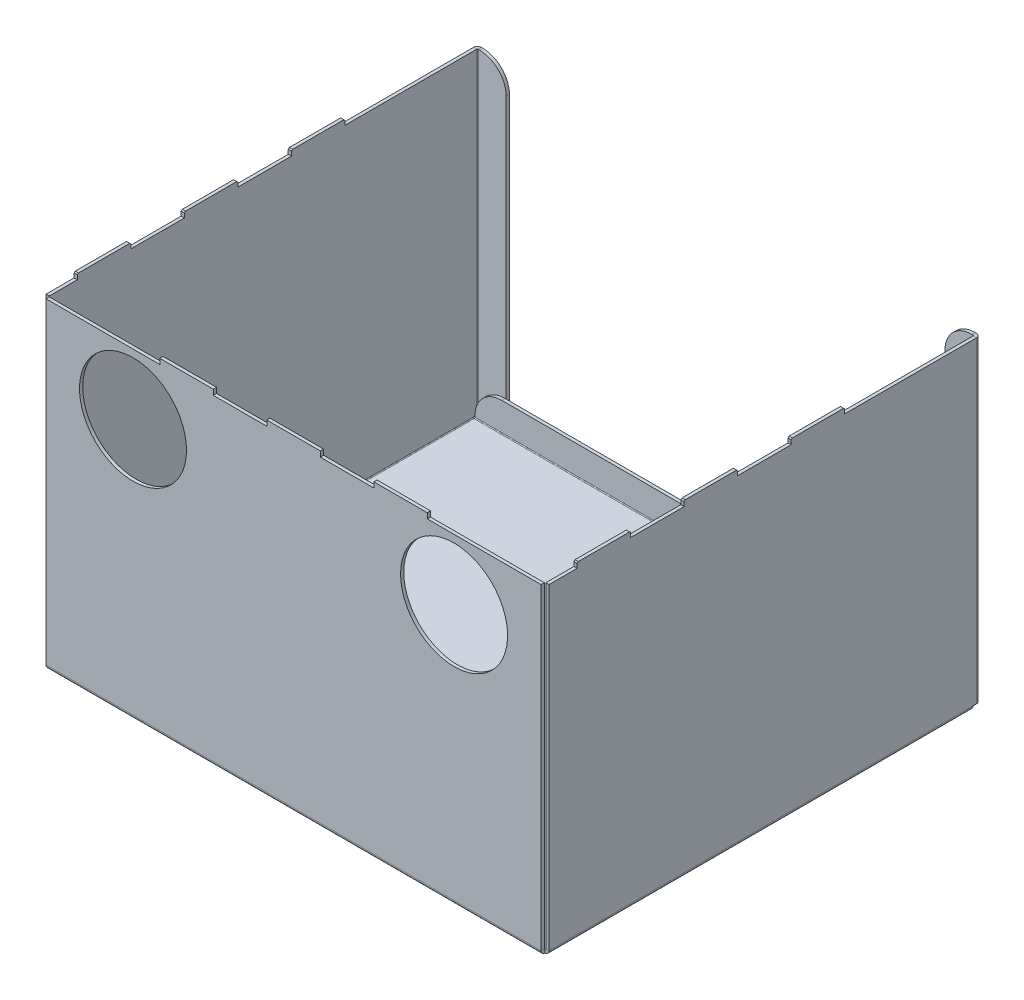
ISO-10303-21;
HEADER;
FILE_DESCRIPTION(('STEP AP214'),'2;1');
FILE_NAME('part.step','',(''),(''),'','','');
FILE_SCHEMA(('AUTOMOTIVE_DESIGN { 1 0 10303 214 1 1 1 1 }'));
ENDSEC;
DATA;
#1=APPLICATION_CONTEXT('core data for automotive mechanical design processes');
#2=APPLICATION_PROTOCOL_DEFINITION('international standard','automotive_design',2000,#1);
#3=PRODUCT_CONTEXT('',#1,'mechanical');
#4=PRODUCT('Part','Part','',(#3));
#5=PRODUCT_RELATED_PRODUCT_CATEGORY('part','',(#4));
#6=PRODUCT_DEFINITION_FORMATION('','',#4);
#7=PRODUCT_DEFINITION_CONTEXT('part definition',#1,'design');
#8=PRODUCT_DEFINITION('design','',#6,#7);
#9=PRODUCT_DEFINITION_SHAPE('','',#8);
#10=(LENGTH_UNIT() NAMED_UNIT(*) SI_UNIT(.MILLI.,.METRE.));
#11=(NAMED_UNIT(*) PLANE_ANGLE_UNIT() SI_UNIT($,.RADIAN.));
#12=(NAMED_UNIT(*) SI_UNIT($,.STERADIAN.) SOLID_ANGLE_UNIT());
#13=UNCERTAINTY_MEASURE_WITH_UNIT(LENGTH_MEASURE(1.E-05),#10,'distance_accuracy_value','');
#14=(GEOMETRIC_REPRESENTATION_CONTEXT(3) GLOBAL_UNCERTAINTY_ASSIGNED_CONTEXT((#13)) GLOBAL_UNIT_ASSIGNED_CONTEXT((#10,
#11,#12)) REPRESENTATION_CONTEXT('',''));
#15=CARTESIAN_POINT('',(0.,0.,0.));
#16=DIRECTION('',(0.,0.,1.));
#17=DIRECTION('',(1.,0.,0.));
#18=AXIS2_PLACEMENT_3D('',#15,#16,#17);
#19=CARTESIAN_POINT('',(-235.,297.,200.));
#20=DIRECTION('',(0.,-1.,0.));
#21=DIRECTION('',(0.,0.,-1.));
#22=AXIS2_PLACEMENT_3D('',#19,#20,#21);
#23=PLANE('',#22);
#24=DIRECTION('',(-1.,0.,0.));
#25=VECTOR('',#24,1.);
#26=CARTESIAN_POINT('',(0.,297.,200.));
#27=LINE('',#26,#25);
#28=CARTESIAN_POINT('',(75.,297.,200.));
#29=VERTEX_POINT('',#28);
#30=CARTESIAN_POINT('',(25.,297.,200.));
#31=VERTEX_POINT('',#30);
#32=EDGE_CURVE('E1069',#29,#31,#27,.T.);
#33=ORIENTED_EDGE('',*,*,#32,.F.);
#34=DIRECTION('',(0.,0.,1.));
#35=VECTOR('',#34,1.);
#36=CARTESIAN_POINT('',(75.,297.,197.));
#37=LINE('',#36,#35);
#38=CARTESIAN_POINT('',(75.,297.,197.));
#39=VERTEX_POINT('',#38);
#40=EDGE_CURVE('E853',#39,#29,#37,.T.);
#41=ORIENTED_EDGE('',*,*,#40,.F.);
#42=DIRECTION('',(1.,0.,0.));
#43=VECTOR('',#42,1.);
#44=CARTESIAN_POINT('',(-235.,297.,197.));
#45=LINE('',#44,#43);
#46=CARTESIAN_POINT('',(25.,297.,197.));
#47=VERTEX_POINT('',#46);
#48=EDGE_CURVE('E1075',#39,#47,#45,.F.);
#49=ORIENTED_EDGE('',*,*,#48,.T.);
#50=DIRECTION('',(0.,0.,1.));
#51=VECTOR('',#50,1.);
#52=CARTESIAN_POINT('',(25.,297.,197.));
#53=LINE('',#52,#51);
#54=EDGE_CURVE('E919',#47,#31,#53,.T.);
#55=ORIENTED_EDGE('',*,*,#54,.T.);
#56=EDGE_LOOP('',(#33,#41,#49,#55));
#57=FACE_BOUND('',#56,.T.);
#58=ADVANCED_FACE('F158',(#57),#23,.F.);
#59=CARTESIAN_POINT('',(-25.,297.,197.));
#60=VERTEX_POINT('',#59);
#61=CARTESIAN_POINT('',(-75.,297.,197.));
#62=VERTEX_POINT('',#61);
#63=EDGE_CURVE('E1076',#60,#62,#45,.F.);
#64=ORIENTED_EDGE('',*,*,#63,.T.);
#65=DIRECTION('',(0.,0.,1.));
#66=VECTOR('',#65,1.);
#67=CARTESIAN_POINT('',(-75.,297.,197.));
#68=LINE('',#67,#66);
#69=CARTESIAN_POINT('',(-75.,297.,200.));
#70=VERTEX_POINT('',#69);
#71=EDGE_CURVE('E888',#62,#70,#68,.T.);
#72=ORIENTED_EDGE('',*,*,#71,.T.);
#73=CARTESIAN_POINT('',(-25.,297.,200.));
#74=VERTEX_POINT('',#73);
#75=EDGE_CURVE('E1070',#74,#70,#27,.T.);
#76=ORIENTED_EDGE('',*,*,#75,.F.);
#77=DIRECTION('',(0.,0.,1.));
#78=VECTOR('',#77,1.);
#79=CARTESIAN_POINT('',(-25.,297.,197.));
#80=LINE('',#79,#78);
#81=EDGE_CURVE('E906',#60,#74,#80,.T.);
#82=ORIENTED_EDGE('',*,*,#81,.F.);
#83=EDGE_LOOP('',(#64,#72,#76,#82));
#84=FACE_BOUND('',#83,.T.);
#85=ADVANCED_FACE('F1644',(#84),#23,.F.);
#86=CARTESIAN_POINT('',(-125.,297.,200.));
#87=VERTEX_POINT('',#86);
#88=CARTESIAN_POINT('',(-231.292893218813,297.,200.));
#89=VERTEX_POINT('',#88);
#90=EDGE_CURVE('E1074',#87,#89,#27,.T.);
#91=ORIENTED_EDGE('',*,*,#90,.F.);
#92=DIRECTION('',(0.,0.,1.));
#93=VECTOR('',#92,1.);
#94=CARTESIAN_POINT('',(-125.,297.,197.));
#95=LINE('',#94,#93);
#96=CARTESIAN_POINT('',(-125.,297.,197.));
#97=VERTEX_POINT('',#96);
#98=EDGE_CURVE('E891',#97,#87,#95,.T.);
#99=ORIENTED_EDGE('',*,*,#98,.F.);
#100=CARTESIAN_POINT('',(-231.292893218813,297.,197.));
#101=VERTEX_POINT('',#100);
#102=EDGE_CURVE('E1079',#97,#101,#45,.F.);
#103=ORIENTED_EDGE('',*,*,#102,.T.);
#104=DIRECTION('',(0.,0.,1.));
#105=VECTOR('',#104,1.);
#106=CARTESIAN_POINT('',(-231.292893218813,297.,197.));
#107=LINE('',#106,#105);
#108=EDGE_CURVE('E1082',#89,#101,#107,.F.);
#109=ORIENTED_EDGE('',*,*,#108,.F.);
#110=EDGE_LOOP('',(#91,#99,#103,#109));
#111=FACE_BOUND('',#110,.T.);
#112=ADVANCED_FACE('F1583',(#111),#23,.F.);
#113=CARTESIAN_POINT('',(-235.000000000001,297.,-200.));
#114=DIRECTION('',(0.,-1.,0.));
#115=DIRECTION('',(1.,0.,0.));
#116=AXIS2_PLACEMENT_3D('',#113,#114,#115);
#117=PLANE('',#116);
#118=DIRECTION('',(-1.,0.,0.));
#119=VECTOR('',#118,1.);
#120=CARTESIAN_POINT('',(-232.000000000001,297.,-80.));
#121=LINE('',#120,#119);
#122=CARTESIAN_POINT('',(-232.000000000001,297.,-80.));
#123=VERTEX_POINT('',#122);
#124=CARTESIAN_POINT('',(-235.000000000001,297.,-80.));
#125=VERTEX_POINT('',#124);
#126=EDGE_CURVE('E939',#123,#125,#121,.T.);
#127=ORIENTED_EDGE('',*,*,#126,.F.);
#128=DIRECTION('',(0.,0.,1.));
#129=VECTOR('',#128,1.);
#130=CARTESIAN_POINT('',(-232.000000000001,297.,-200.));
#131=LINE('',#130,#129);
#132=CARTESIAN_POINT('',(-232.,297.,-203.01));
#133=VERTEX_POINT('',#132);
#134=EDGE_CURVE('E1481',#123,#133,#131,.F.);
#135=ORIENTED_EDGE('',*,*,#134,.T.);
#136=DIRECTION('',(-1.,0.,0.));
#137=VECTOR('',#136,1.);
#138=CARTESIAN_POINT('',(-232.,297.,-203.01));
#139=LINE('',#138,#137);
#140=CARTESIAN_POINT('',(-235.,297.,-203.01));
#141=VERTEX_POINT('',#140);
#142=EDGE_CURVE('E736',#133,#141,#139,.T.);
#143=ORIENTED_EDGE('',*,*,#142,.T.);
#144=DIRECTION('',(0.,0.,-1.));
#145=VECTOR('',#144,1.);
#146=CARTESIAN_POINT('',(-235.000000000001,297.,0.));
#147=LINE('',#146,#145);
#148=EDGE_CURVE('E1474',#125,#141,#147,.T.);
#149=ORIENTED_EDGE('',*,*,#148,.F.);
#150=EDGE_LOOP('',(#127,#135,#143,#149));
#151=FACE_BOUND('',#150,.T.);
#152=ADVANCED_FACE('F1241',(#151),#117,.F.);
#153=DIRECTION('',(-1.,0.,0.));
#154=VECTOR('',#153,1.);
#155=CARTESIAN_POINT('',(-232.000000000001,297.,-30.));
#156=LINE('',#155,#154);
#157=CARTESIAN_POINT('',(-232.000000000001,297.,-30.));
#158=VERTEX_POINT('',#157);
#159=CARTESIAN_POINT('',(-235.000000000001,297.,-30.));
#160=VERTEX_POINT('',#159);
#161=EDGE_CURVE('E932',#158,#160,#156,.T.);
#162=ORIENTED_EDGE('',*,*,#161,.T.);
#163=CARTESIAN_POINT('',(-235.000000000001,297.,20.));
#164=VERTEX_POINT('',#163);
#165=EDGE_CURVE('E1477',#164,#160,#147,.T.);
#166=ORIENTED_EDGE('',*,*,#165,.F.);
#167=DIRECTION('',(-1.,0.,0.));
#168=VECTOR('',#167,1.);
#169=CARTESIAN_POINT('',(-232.000000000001,297.,20.));
#170=LINE('',#169,#168);
#171=CARTESIAN_POINT('',(-232.000000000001,297.,20.));
#172=VERTEX_POINT('',#171);
#173=EDGE_CURVE('E961',#172,#164,#170,.T.);
#174=ORIENTED_EDGE('',*,*,#173,.F.);
#175=EDGE_CURVE('E1483',#172,#158,#131,.F.);
#176=ORIENTED_EDGE('',*,*,#175,.T.);
#177=EDGE_LOOP('',(#162,#166,#174,#176));
#178=FACE_BOUND('',#177,.T.);
#179=ADVANCED_FACE('F1662',(#178),#117,.F.);
#180=DIRECTION('',(-1.,0.,0.));
#181=VECTOR('',#180,1.);
#182=CARTESIAN_POINT('',(-232.000000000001,297.,70.));
#183=LINE('',#182,#181);
#184=CARTESIAN_POINT('',(-232.000000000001,297.,70.));
#185=VERTEX_POINT('',#184);
#186=CARTESIAN_POINT('',(-235.000000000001,297.,70.));
#187=VERTEX_POINT('',#186);
#188=EDGE_CURVE('E954',#185,#187,#183,.T.);
#189=ORIENTED_EDGE('',*,*,#188,.T.);
#190=CARTESIAN_POINT('',(-235.000000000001,297.,120.));
#191=VERTEX_POINT('',#190);
#192=EDGE_CURVE('E1505',#191,#187,#147,.T.);
#193=ORIENTED_EDGE('',*,*,#192,.F.);
#194=DIRECTION('',(-1.,0.,0.));
#195=VECTOR('',#194,1.);
#196=CARTESIAN_POINT('',(-232.000000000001,297.,120.));
#197=LINE('',#196,#195);
#198=CARTESIAN_POINT('',(-232.000000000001,297.,120.));
#199=VERTEX_POINT('',#198);
#200=EDGE_CURVE('E976',#199,#191,#197,.T.);
#201=ORIENTED_EDGE('',*,*,#200,.F.);
#202=EDGE_CURVE('E1487',#199,#185,#131,.F.);
#203=ORIENTED_EDGE('',*,*,#202,.T.);
#204=EDGE_LOOP('',(#189,#193,#201,#203));
#205=FACE_BOUND('',#204,.T.);
#206=ADVANCED_FACE('F1242',(#205),#117,.F.);
#207=CARTESIAN_POINT('',(235.000000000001,297.,200.));
#208=DIRECTION('',(0.,-1.,0.));
#209=DIRECTION('',(1.,0.,0.));
#210=AXIS2_PLACEMENT_3D('',#207,#208,#209);
#211=PLANE('',#210);
#212=DIRECTION('',(0.,0.,1.));
#213=VECTOR('',#212,1.);
#214=CARTESIAN_POINT('',(235.000000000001,297.,0.));
#215=LINE('',#214,#213);
#216=CARTESIAN_POINT('',(235.000000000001,297.,-30.));
#217=VERTEX_POINT('',#216);
#218=CARTESIAN_POINT('',(235.000000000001,297.,20.));
#219=VERTEX_POINT('',#218);
#220=EDGE_CURVE('E1155',#217,#219,#215,.T.);
#221=ORIENTED_EDGE('',*,*,#220,.F.);
#222=DIRECTION('',(1.,0.,0.));
#223=VECTOR('',#222,1.);
#224=CARTESIAN_POINT('',(232.000000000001,297.,-30.));
#225=LINE('',#224,#223);
#226=CARTESIAN_POINT('',(232.000000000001,297.,-30.));
#227=VERTEX_POINT('',#226);
#228=EDGE_CURVE('E1004',#227,#217,#225,.T.);
#229=ORIENTED_EDGE('',*,*,#228,.F.);
#230=DIRECTION('',(0.,0.,-1.));
#231=VECTOR('',#230,1.);
#232=CARTESIAN_POINT('',(232.000000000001,297.,200.));
#233=LINE('',#232,#231);
#234=CARTESIAN_POINT('',(232.000000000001,297.,20.));
#235=VERTEX_POINT('',#234);
#236=EDGE_CURVE('E1160',#227,#235,#233,.F.);
#237=ORIENTED_EDGE('',*,*,#236,.T.);
#238=DIRECTION('',(1.,0.,0.));
#239=VECTOR('',#238,1.);
#240=CARTESIAN_POINT('',(232.000000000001,297.,20.));
#241=LINE('',#240,#239);
#242=EDGE_CURVE('E1019',#235,#219,#241,.T.);
#243=ORIENTED_EDGE('',*,*,#242,.T.);
#244=EDGE_LOOP('',(#221,#229,#237,#243));
#245=FACE_BOUND('',#244,.T.);
#246=ADVANCED_FACE('F1670',(#245),#211,.F.);
#247=CARTESIAN_POINT('',(235.000000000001,297.,70.));
#248=VERTEX_POINT('',#247);
#249=CARTESIAN_POINT('',(235.000000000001,297.,120.));
#250=VERTEX_POINT('',#249);
#251=EDGE_CURVE('E2804',#248,#250,#215,.T.);
#252=ORIENTED_EDGE('',*,*,#251,.F.);
#253=DIRECTION('',(1.,0.,0.));
#254=VECTOR('',#253,1.);
#255=CARTESIAN_POINT('',(232.000000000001,297.,70.));
#256=LINE('',#255,#254);
#257=CARTESIAN_POINT('',(232.000000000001,297.,70.));
#258=VERTEX_POINT('',#257);
#259=EDGE_CURVE('E1026',#258,#248,#256,.T.);
#260=ORIENTED_EDGE('',*,*,#259,.F.);
#261=CARTESIAN_POINT('',(232.000000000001,297.,120.));
#262=VERTEX_POINT('',#261);
#263=EDGE_CURVE('E2814',#258,#262,#233,.F.);
#264=ORIENTED_EDGE('',*,*,#263,.T.);
#265=DIRECTION('',(1.,0.,0.));
#266=VECTOR('',#265,1.);
#267=CARTESIAN_POINT('',(232.000000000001,297.,120.));
#268=LINE('',#267,#266);
#269=EDGE_CURVE('E1048',#262,#250,#268,.T.);
#270=ORIENTED_EDGE('',*,*,#269,.T.);
#271=EDGE_LOOP('',(#252,#260,#264,#270));
#272=FACE_BOUND('',#271,.T.);
#273=ADVANCED_FACE('F2148',(#272),#211,.F.);
#274=DIRECTION('',(1.,0.,0.));
#275=VECTOR('',#274,1.);
#276=CARTESIAN_POINT('',(232.000000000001,297.,170.));
#277=LINE('',#276,#275);
#278=CARTESIAN_POINT('',(232.000000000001,297.,170.));
#279=VERTEX_POINT('',#278);
#280=CARTESIAN_POINT('',(235.000000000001,297.,170.));
#281=VERTEX_POINT('',#280);
#282=EDGE_CURVE('E1041',#279,#281,#277,.T.);
#283=ORIENTED_EDGE('',*,*,#282,.F.);
#284=CARTESIAN_POINT('',(232.000000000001,297.,196.292893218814));
#285=VERTEX_POINT('',#284);
#286=EDGE_CURVE('E1161',#279,#285,#233,.F.);
#287=ORIENTED_EDGE('',*,*,#286,.T.);
#288=DIRECTION('',(1.,0.,0.));
#289=VECTOR('',#288,1.);
#290=CARTESIAN_POINT('',(232.000000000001,297.,196.292893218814));
#291=LINE('',#290,#289);
#292=CARTESIAN_POINT('',(235.000000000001,297.,196.292893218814));
#293=VERTEX_POINT('',#292);
#294=EDGE_CURVE('E1170',#293,#285,#291,.F.);
#295=ORIENTED_EDGE('',*,*,#294,.F.);
#296=EDGE_CURVE('E1156',#281,#293,#215,.T.);
#297=ORIENTED_EDGE('',*,*,#296,.F.);
#298=EDGE_LOOP('',(#283,#287,#295,#297));
#299=FACE_BOUND('',#298,.T.);
#300=ADVANCED_FACE('F1738',(#299),#211,.F.);
#301=CARTESIAN_POINT('',(0.,-3.,0.));
#302=DIRECTION('',(0.,1.,0.));
#303=DIRECTION('',(0.,0.,1.));
#304=AXIS2_PLACEMENT_3D('',#301,#302,#303);
#305=PLANE('',#304);
#306=DIRECTION('',(1.,0.,0.));
#307=VECTOR('',#306,1.);
#308=CARTESIAN_POINT('',(231.292893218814,-3.,196.2634));
#309=LINE('',#308,#307);
#310=CARTESIAN_POINT('',(231.2634,-3.,196.2634));
#311=VERTEX_POINT('',#310);
#312=CARTESIAN_POINT('',(-231.2634,-3.00000000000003,196.2634));
#313=VERTEX_POINT('',#312);
#314=EDGE_CURVE('E1108',#311,#313,#309,.F.);
#315=ORIENTED_EDGE('',*,*,#314,.T.);
#316=DIRECTION('',(0.,0.,1.));
#317=VECTOR('',#316,1.);
#318=CARTESIAN_POINT('',(-231.2634,-3.00000000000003,196.292893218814));
#319=LINE('',#318,#317);
#320=CARTESIAN_POINT('',(-231.2634,-3.00000000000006,-200.));
#321=VERTEX_POINT('',#320);
#322=EDGE_CURVE('E1257',#313,#321,#319,.F.);
#323=ORIENTED_EDGE('',*,*,#322,.T.);
#324=DIRECTION('',(-1.,0.,0.));
#325=VECTOR('',#324,1.);
#326=CARTESIAN_POINT('',(235.,-3.,-200.));
#327=LINE('',#326,#325);
#328=CARTESIAN_POINT('',(231.2634,-2.99999999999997,-200.));
#329=VERTEX_POINT('',#328);
#330=EDGE_CURVE('E1280',#329,#321,#327,.T.);
#331=ORIENTED_EDGE('',*,*,#330,.F.);
#332=DIRECTION('',(0.,0.,-1.));
#333=VECTOR('',#332,1.);
#334=CARTESIAN_POINT('',(231.2634,-2.99999999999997,-200.));
#335=LINE('',#334,#333);
#336=EDGE_CURVE('E1182',#329,#311,#335,.F.);
#337=ORIENTED_EDGE('',*,*,#336,.T.);
#338=EDGE_LOOP('',(#315,#323,#331,#337));
#339=FACE_BOUND('',#338,.T.);
#340=ADVANCED_FACE('F1531',(#339),#305,.F.);
#341=CARTESIAN_POINT('',(0.,0.,0.));
#342=DIRECTION('',(0.,1.,0.));
#343=DIRECTION('',(0.,0.,1.));
#344=AXIS2_PLACEMENT_3D('',#341,#342,#343);
#345=PLANE('',#344);
#346=DIRECTION('',(0.,0.,1.));
#347=VECTOR('',#346,1.);
#348=CARTESIAN_POINT('',(-231.2634,0.,196.292893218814));
#349=LINE('',#348,#347);
#350=CARTESIAN_POINT('',(-231.2634,0.,196.2634));
#351=VERTEX_POINT('',#350);
#352=CARTESIAN_POINT('',(-231.2634,0.,-200.));
#353=VERTEX_POINT('',#352);
#354=EDGE_CURVE('E1270',#351,#353,#349,.F.);
#355=ORIENTED_EDGE('',*,*,#354,.F.);
#356=DIRECTION('',(1.,0.,0.));
#357=VECTOR('',#356,1.);
#358=CARTESIAN_POINT('',(231.292893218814,0.,196.2634));
#359=LINE('',#358,#357);
#360=CARTESIAN_POINT('',(231.2634,0.,196.2634));
#361=VERTEX_POINT('',#360);
#362=EDGE_CURVE('E1099',#361,#351,#359,.F.);
#363=ORIENTED_EDGE('',*,*,#362,.F.);
#364=DIRECTION('',(0.,0.,-1.));
#365=VECTOR('',#364,1.);
#366=CARTESIAN_POINT('',(231.2634,0.,-200.));
#367=LINE('',#366,#365);
#368=CARTESIAN_POINT('',(231.2634,0.,-200.));
#369=VERTEX_POINT('',#368);
#370=EDGE_CURVE('E1186',#369,#361,#367,.F.);
#371=ORIENTED_EDGE('',*,*,#370,.F.);
#372=DIRECTION('',(-1.,0.,0.));
#373=VECTOR('',#372,1.);
#374=CARTESIAN_POINT('',(235.,0.,-200.));
#375=LINE('',#374,#373);
#376=EDGE_CURVE('E1276',#369,#353,#375,.T.);
#377=ORIENTED_EDGE('',*,*,#376,.T.);
#378=EDGE_LOOP('',(#355,#363,#371,#377));
#379=FACE_BOUND('',#378,.T.);
#380=ADVANCED_FACE('F1732',(#379),#345,.T.);
#381=CARTESIAN_POINT('',(-231.2634,0.736600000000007,-200.));
#382=DIRECTION('',(0.,0.,-1.));
#383=DIRECTION('',(0.,1.,0.));
#384=AXIS2_PLACEMENT_3D('',#381,#382,#383);
#385=PLANE('',#384);
#386=DIRECTION('',(1.,0.,0.));
#387=VECTOR('',#386,1.);
#388=CARTESIAN_POINT('',(-235.,0.736599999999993,-200.));
#389=LINE('',#388,#387);
#390=CARTESIAN_POINT('',(-232.,0.736600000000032,-200.));
#391=VERTEX_POINT('',#390);
#392=CARTESIAN_POINT('',(-235.,0.736599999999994,-200.));
#393=VERTEX_POINT('',#392);
#394=EDGE_CURVE('E1470',#391,#393,#389,.F.);
#395=ORIENTED_EDGE('',*,*,#394,.F.);
#396=CARTESIAN_POINT('',(-231.2634,0.736600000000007,-200.));
#397=DIRECTION('',(0.,0.,1.));
#398=DIRECTION('',(0.,-1.,0.));
#399=AXIS2_PLACEMENT_3D('',#396,#397,#398);
#400=CIRCLE('',#399,0.736600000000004);
#401=EDGE_CURVE('E1258',#353,#391,#400,.F.);
#402=ORIENTED_EDGE('',*,*,#401,.F.);
#403=DIRECTION('',(0.,-1.,0.));
#404=VECTOR('',#403,1.);
#405=CARTESIAN_POINT('',(-231.2634,0.,-200.));
#406=LINE('',#405,#404);
#407=EDGE_CURVE('E1273',#353,#321,#406,.T.);
#408=ORIENTED_EDGE('',*,*,#407,.T.);
#409=CARTESIAN_POINT('',(-231.2634,0.736600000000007,-200.));
#410=DIRECTION('',(0.,0.,1.));
#411=DIRECTION('',(0.,-1.,0.));
#412=AXIS2_PLACEMENT_3D('',#409,#410,#411);
#413=CIRCLE('',#412,3.7366);
#414=EDGE_CURVE('E1269',#321,#393,#413,.F.);
#415=ORIENTED_EDGE('',*,*,#414,.T.);
#416=EDGE_LOOP('',(#395,#402,#408,#415));
#417=FACE_BOUND('',#416,.T.);
#418=ADVANCED_FACE('F1608',(#417),#385,.T.);
#419=CARTESIAN_POINT('',(-235.03,0.736599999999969,196.292893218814));
#420=CARTESIAN_POINT('',(-235.03,0.24346432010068,196.290435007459));
#421=CARTESIAN_POINT('',(-234.931965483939,-0.249299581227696,196.287977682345));
#422=CARTESIAN_POINT('',(-234.554603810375,-1.16033125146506,196.283062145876));
#423=CARTESIAN_POINT('',(-234.275425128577,-1.57815167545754,196.280604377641));
#424=CARTESIAN_POINT('',(-233.578151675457,-2.27542512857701,196.275688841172));
#425=CARTESIAN_POINT('',(-233.160331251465,-2.55460381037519,196.273231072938));
#426=CARTESIAN_POINT('',(-232.249299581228,-2.93196548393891,196.268315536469));
#427=CARTESIAN_POINT('',(-231.756535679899,-3.03000000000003,196.265858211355));
#428=CARTESIAN_POINT('',(-231.2634,-3.03000000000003,196.2634));
#429=CARTESIAN_POINT('',(-235.,0.736599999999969,196.292893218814));
#430=CARTESIAN_POINT('',(-235.,0.247392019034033,196.290435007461));
#431=CARTESIAN_POINT('',(-234.902746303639,-0.241447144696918,196.287977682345));
#432=CARTESIAN_POINT('',(-234.528390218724,-1.14522268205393,196.283062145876));
#433=CARTESIAN_POINT('',(-234.251435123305,-1.5597152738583,196.280604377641));
#434=CARTESIAN_POINT('',(-233.559715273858,-2.25143512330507,196.275688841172));
#435=CARTESIAN_POINT('',(-233.145222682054,-2.52839021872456,196.273231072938));
#436=CARTESIAN_POINT('',(-232.241447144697,-2.90274630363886,196.268315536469));
#437=CARTESIAN_POINT('',(-231.752607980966,-3.00000000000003,196.265858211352));
#438=CARTESIAN_POINT('',(-231.2634,-3.00000000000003,196.2634));
#439=CARTESIAN_POINT('',(-232.,0.736599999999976,196.292893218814));
#440=CARTESIAN_POINT('',(-232.,0.640161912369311,196.290435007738));
#441=CARTESIAN_POINT('',(-231.980828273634,0.54379650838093,196.287977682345));
#442=CARTESIAN_POINT('',(-231.907031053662,0.365634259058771,196.283062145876));
#443=CARTESIAN_POINT('',(-231.85243459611,0.283924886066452,196.280604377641));
#444=CARTESIAN_POINT('',(-231.716075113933,0.147565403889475,196.275688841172));
#445=CARTESIAN_POINT('',(-231.634365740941,0.0929689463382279,196.273231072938));
#446=CARTESIAN_POINT('',(-231.456203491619,0.0191717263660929,196.268315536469));
#447=CARTESIAN_POINT('',(-231.359838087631,0.,196.265858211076));
#448=CARTESIAN_POINT('',(-231.2634,0.,196.2634));
#449=CARTESIAN_POINT('',(-231.9697,0.736599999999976,196.292893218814));
#450=CARTESIAN_POINT('',(-231.9697,0.644128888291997,196.290435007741));
#451=CARTESIAN_POINT('',(-231.951316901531,0.551727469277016,196.287977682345));
#452=CARTESIAN_POINT('',(-231.880555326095,0.380893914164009,196.283062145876));
#453=CARTESIAN_POINT('',(-231.828204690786,0.302545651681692,196.280604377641));
#454=CARTESIAN_POINT('',(-231.697454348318,0.17179530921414,196.275688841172));
#455=CARTESIAN_POINT('',(-231.619106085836,0.119444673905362,196.273231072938));
#456=CARTESIAN_POINT('',(-231.448272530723,0.0486830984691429,196.268315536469));
#457=CARTESIAN_POINT('',(-231.355871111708,0.0302999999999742,196.265858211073));
#458=CARTESIAN_POINT('',(-231.2634,0.0302999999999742,196.2634));
#459=B_SPLINE_SURFACE_WITH_KNOTS('',1,3,((#419,#420,#421,#422,#423,#424,#425,#426,#427,#428),
(#429,#430,#431,#432,#433,#434,#435,#436,#437,#438),(#439,#440,#441,#442,#443,#444,#445,#446,
#447,#448),(#449,#450,#451,#452,#453,#454,#455,#456,#457,#458)),.UNSPECIFIED.,.F.,.F.,.F.,(2,1,
1,2),(4,2,2,2,4),(-0.01,0.,1.,1.0101),(0.,0.25,0.5,0.75,1.),.UNSPECIFIED.);
#460=CARTESIAN_POINT('',(-232.,0.736599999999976,196.292893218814));
#461=CARTESIAN_POINT('',(-232.000000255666,0.724547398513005,196.292585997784));
#462=CARTESIAN_POINT('',(-231.999704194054,0.71249481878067,196.292278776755));
#463=CARTESIAN_POINT('',(-231.998521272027,0.688418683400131,196.291664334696));
#464=CARTESIAN_POINT('',(-231.997634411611,0.676395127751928,196.291357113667));
#465=CARTESIAN_POINT('',(-231.995271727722,0.652406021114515,196.290742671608));
#466=CARTESIAN_POINT('',(-231.99379590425,0.640440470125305,196.290435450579));
#467=CARTESIAN_POINT('',(-231.99025893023,0.616596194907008,196.28982100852));
#468=CARTESIAN_POINT('',(-231.988197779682,0.604717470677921,196.289513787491));
#469=CARTESIAN_POINT('',(-231.983495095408,0.581075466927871,196.288899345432));
#470=CARTESIAN_POINT('',(-231.980853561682,0.569312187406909,196.288592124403));
#471=CARTESIAN_POINT('',(-231.974996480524,0.545929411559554,196.287977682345));
#472=CARTESIAN_POINT('',(-231.971780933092,0.534309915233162,196.287670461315));
#473=CARTESIAN_POINT('',(-231.964783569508,0.511242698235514,196.287056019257));
#474=CARTESIAN_POINT('',(-231.961001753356,0.499794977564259,196.286748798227));
#475=CARTESIAN_POINT('',(-231.952880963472,0.477098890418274,196.286134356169));
#476=CARTESIAN_POINT('',(-231.94854198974,0.465850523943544,196.285827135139));
#477=CARTESIAN_POINT('',(-231.939317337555,0.443580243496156,196.285212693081));
#478=CARTESIAN_POINT('',(-231.934431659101,0.432558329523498,196.284905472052));
#479=CARTESIAN_POINT('',(-231.924125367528,0.410767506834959,196.284291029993));
#480=CARTESIAN_POINT('',(-231.918704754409,0.399998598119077,196.283983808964));
#481=CARTESIAN_POINT('',(-231.907341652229,0.378739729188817,196.283369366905));
#482=CARTESIAN_POINT('',(-231.901399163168,0.368249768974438,196.283062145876));
#483=CARTESIAN_POINT('',(-231.889006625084,0.347574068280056,196.282447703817));
#484=CARTESIAN_POINT('',(-231.882556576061,0.337388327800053,196.282140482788));
#485=CARTESIAN_POINT('',(-231.869164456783,0.317345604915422,196.281526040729));
#486=CARTESIAN_POINT('',(-231.86222238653,0.307488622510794,196.2812188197));
#487=CARTESIAN_POINT('',(-231.847862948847,0.288127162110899,196.280604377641));
#488=CARTESIAN_POINT('',(-231.840445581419,0.278622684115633,196.280297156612));
#489=CARTESIAN_POINT('',(-231.825153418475,0.259989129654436,196.279682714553));
#490=CARTESIAN_POINT('',(-231.817278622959,0.250860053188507,196.279375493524));
#491=CARTESIAN_POINT('',(-231.801090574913,0.232999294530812,196.278761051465));
#492=CARTESIAN_POINT('',(-231.792777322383,0.224267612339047,196.278453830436));
#493=CARTESIAN_POINT('',(-231.775732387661,0.207222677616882,196.277839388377));
#494=CARTESIAN_POINT('',(-231.767000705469,0.19890942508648,196.277532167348));
#495=CARTESIAN_POINT('',(-231.749139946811,0.182721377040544,196.27691772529));
#496=CARTESIAN_POINT('',(-231.740010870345,0.174846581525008,196.27661050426));
#497=CARTESIAN_POINT('',(-231.721377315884,0.159554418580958,196.275996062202));
#498=CARTESIAN_POINT('',(-231.711872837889,0.152137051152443,196.275688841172));
#499=CARTESIAN_POINT('',(-231.692511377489,0.137777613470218,196.275074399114));
#500=CARTESIAN_POINT('',(-231.682654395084,0.130835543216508,196.274767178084));
#501=CARTESIAN_POINT('',(-231.6626116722,0.117443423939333,196.274152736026));
#502=CARTESIAN_POINT('',(-231.65242593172,0.110993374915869,196.273845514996));
#503=CARTESIAN_POINT('',(-231.631750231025,0.0986008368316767,196.273231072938));
#504=CARTESIAN_POINT('',(-231.621260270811,0.0926583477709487,196.272923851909));
#505=CARTESIAN_POINT('',(-231.600001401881,0.0812952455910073,196.27230940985));
#506=CARTESIAN_POINT('',(-231.589232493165,0.0758746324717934,196.272002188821));
#507=CARTESIAN_POINT('',(-231.567441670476,0.0655683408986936,196.271387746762));
#508=CARTESIAN_POINT('',(-231.556419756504,0.0606826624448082,196.271080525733));
#509=CARTESIAN_POINT('',(-231.534149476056,0.0514580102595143,196.270466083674));
#510=CARTESIAN_POINT('',(-231.522901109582,0.0471190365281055,196.270158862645));
#511=CARTESIAN_POINT('',(-231.500205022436,0.038998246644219,196.269544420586));
#512=CARTESIAN_POINT('',(-231.488757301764,0.035216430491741,196.269237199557));
#513=CARTESIAN_POINT('',(-231.465690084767,0.0282190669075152,196.268622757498));
#514=CARTESIAN_POINT('',(-231.45407058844,0.0250035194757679,196.268315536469));
#515=CARTESIAN_POINT('',(-231.430687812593,0.0191464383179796,196.26770109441));
#516=CARTESIAN_POINT('',(-231.418924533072,0.0165049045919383,196.267393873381));
#517=CARTESIAN_POINT('',(-231.395282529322,0.0118022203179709,196.266779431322));
#518=CARTESIAN_POINT('',(-231.383403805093,0.00974106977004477,196.266472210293));
#519=CARTESIAN_POINT('',(-231.359559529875,0.00620409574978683,196.265857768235));
#520=CARTESIAN_POINT('',(-231.347593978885,0.00472827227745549,196.265550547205));
#521=CARTESIAN_POINT('',(-231.323604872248,0.0023655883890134,196.264936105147));
#522=CARTESIAN_POINT('',(-231.3115813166,0.00147872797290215,196.264628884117));
#523=CARTESIAN_POINT('',(-231.287505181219,0.000295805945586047,196.264014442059));
#524=CARTESIAN_POINT('',(-231.275452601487,-2.55665618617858E-07,196.263707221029));
#525=CARTESIAN_POINT('',(-231.2634,0.,196.2634));
#526=B_SPLINE_CURVE_WITH_KNOTS('',3,(#460,#461,#462,#463,#464,#465,#466,#467,#468,#469,#470,
#471,#472,#473,#474,#475,#476,#477,#478,#479,#480,#481,#482,#483,#484,#485,#486,#487,#488,#489,
#490,#491,#492,#493,#494,#495,#496,#497,#498,#499,#500,#501,#502,#503,#504,#505,#506,#507,#508,
#509,#510,#511,#512,#513,#514,#515,#516,#517,#518,#519,#520,#521,#522,#523,#524,#525),
.UNSPECIFIED.,.F.,.F.,(4,2,2,2,2,2,2,2,2,2,2,2,2,2,2,2,2,2,2,2,2,2,2,2,2,2,2,2,2,2,2,2,4),(0.,
0.0361658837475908,0.0723317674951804,0.108497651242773,0.144663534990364,0.180829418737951,
0.216995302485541,0.253161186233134,0.289327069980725,0.325492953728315,0.361658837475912,
0.397824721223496,0.433990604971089,0.47015648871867,0.506322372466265,0.542488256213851,
0.57865413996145,0.614820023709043,0.650985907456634,0.68715179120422,0.723317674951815,
0.759483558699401,0.795649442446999,0.831815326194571,0.867981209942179,0.904147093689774,
0.940312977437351,0.976478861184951,1.01264474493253,1.04881062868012,1.08497651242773,
1.12114239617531,1.1573082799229),.UNSPECIFIED.);
#527=CARTESIAN_POINT('',(-232.,0.736599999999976,196.292893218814));
#528=VERTEX_POINT('',#527);
#529=EDGE_CURVE('E1259',#528,#351,#526,.T.);
#530=DIRECTION('',(-1.,0.,0.));
#531=VECTOR('',#530,1.);
#532=CARTESIAN_POINT('',(-232.,0.736599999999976,196.292893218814));
#533=LINE('',#532,#531);
#534=CARTESIAN_POINT('',(-235.,0.736599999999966,196.292893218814));
#535=VERTEX_POINT('',#534);
#536=EDGE_CURVE('E1507',#535,#528,#533,.F.);
#537=CARTESIAN_POINT('',(-235.,0.736599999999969,196.292893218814));
#538=CARTESIAN_POINT('',(-235.000001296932,0.675459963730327,196.292585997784));
#539=CARTESIAN_POINT('',(-234.99849944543,0.614320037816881,196.292278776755));
#540=CARTESIAN_POINT('',(-234.992498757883,0.492187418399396,196.291664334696));
#541=CARTESIAN_POINT('',(-234.987999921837,0.431194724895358,196.291357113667));
#542=CARTESIAN_POINT('',(-234.976014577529,0.309503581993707,196.290742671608));
#543=CARTESIAN_POINT('',(-234.968528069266,0.248805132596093,196.290435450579));
#544=CARTESIAN_POINT('',(-234.950585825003,0.127848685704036,196.28982100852));
#545=CARTESIAN_POINT('',(-234.940130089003,0.0675906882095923,196.289513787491));
#546=CARTESIAN_POINT('',(-234.916274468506,-0.0523396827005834,196.288899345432));
#547=CARTESIAN_POINT('',(-234.902874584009,-0.112012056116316,196.288592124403));
#548=CARTESIAN_POINT('',(-234.873162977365,-0.230627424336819,196.287977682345));
#549=CARTESIAN_POINT('',(-234.856851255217,-0.289570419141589,196.287670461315));
#550=CARTESIAN_POINT('',(-234.821355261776,-0.406585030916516,196.287056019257));
#551=CARTESIAN_POINT('',(-234.802170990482,-0.464656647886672,196.286748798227));
#552=CARTESIAN_POINT('',(-234.760976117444,-0.579788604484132,196.286134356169));
#553=CARTESIAN_POINT('',(-234.738965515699,-0.636848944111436,196.285827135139));
#554=CARTESIAN_POINT('',(-234.692171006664,-0.749820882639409,196.285212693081));
#555=CARTESIAN_POINT('',(-234.667387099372,-0.805732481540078,196.284905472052));
#556=CARTESIAN_POINT('',(-234.615105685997,-0.91627224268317,196.284291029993));
#557=CARTESIAN_POINT('',(-234.587608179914,-0.970900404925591,196.283983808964));
#558=CARTESIAN_POINT('',(-234.529965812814,-1.07874168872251,196.283369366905));
#559=CARTESIAN_POINT('',(-234.499820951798,-1.131954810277,196.283062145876));
#560=CARTESIAN_POINT('',(-234.436956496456,-1.23683781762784,196.282447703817));
#561=CARTESIAN_POINT('',(-234.404236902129,-1.28850770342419,196.282140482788));
#562=CARTESIAN_POINT('',(-234.33630180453,-1.39017976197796,196.281526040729));
#563=CARTESIAN_POINT('',(-234.301086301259,-1.44018193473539,196.2812188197));
#564=CARTESIAN_POINT('',(-234.228244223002,-1.53839810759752,196.280604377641));
#565=CARTESIAN_POINT('',(-234.190617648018,-1.58661210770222,196.280297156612));
#566=CARTESIAN_POINT('',(-234.113044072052,-1.68113578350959,196.279682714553));
#567=CARTESIAN_POINT('',(-234.07309707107,-1.72744545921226,196.279375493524));
#568=CARTESIAN_POINT('',(-233.990978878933,-1.81804892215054,196.278761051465));
#569=CARTESIAN_POINT('',(-233.948807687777,-1.86234270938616,196.278453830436));
#570=CARTESIAN_POINT('',(-233.862342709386,-1.94880768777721,196.277839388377));
#571=CARTESIAN_POINT('',(-233.81804892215,-1.99097887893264,196.277532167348));
#572=CARTESIAN_POINT('',(-233.727445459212,-2.07309707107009,196.27691772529));
#573=CARTESIAN_POINT('',(-233.681135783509,-2.11304407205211,196.27661050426));
#574=CARTESIAN_POINT('',(-233.586612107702,-2.19061764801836,196.275996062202));
#575=CARTESIAN_POINT('',(-233.538398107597,-2.22824422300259,196.275688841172));
#576=CARTESIAN_POINT('',(-233.440181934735,-2.30108630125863,196.275074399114));
#577=CARTESIAN_POINT('',(-233.390179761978,-2.33630180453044,196.274767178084));
#578=CARTESIAN_POINT('',(-233.288507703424,-2.40423690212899,196.274152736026));
#579=CARTESIAN_POINT('',(-233.236837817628,-2.43695649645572,196.273845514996));
#580=CARTESIAN_POINT('',(-233.131954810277,-2.49982095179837,196.273231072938));
#581=CARTESIAN_POINT('',(-233.078741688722,-2.52996581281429,196.272923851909));
#582=CARTESIAN_POINT('',(-232.970900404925,-2.58760817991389,196.27230940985));
#583=CARTESIAN_POINT('',(-232.916272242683,-2.61510568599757,196.272002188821));
#584=CARTESIAN_POINT('',(-232.80573248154,-2.66738709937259,196.271387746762));
#585=CARTESIAN_POINT('',(-232.749820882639,-2.69217100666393,196.271080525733));
#586=CARTESIAN_POINT('',(-232.636848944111,-2.73896551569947,196.270466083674));
#587=CARTESIAN_POINT('',(-232.579788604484,-2.76097611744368,196.270158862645));
#588=CARTESIAN_POINT('',(-232.464656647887,-2.80217099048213,196.269544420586));
#589=CARTESIAN_POINT('',(-232.406585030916,-2.82135526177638,196.269237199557));
#590=CARTESIAN_POINT('',(-232.289570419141,-2.85685125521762,196.268622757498));
#591=CARTESIAN_POINT('',(-232.230627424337,-2.87316297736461,196.268315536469));
#592=CARTESIAN_POINT('',(-232.112012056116,-2.90287458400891,196.26770109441));
#593=CARTESIAN_POINT('',(-232.0523396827,-2.91627446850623,196.267393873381));
#594=CARTESIAN_POINT('',(-231.93240931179,-2.94013008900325,196.266779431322));
#595=CARTESIAN_POINT('',(-231.872151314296,-2.95058582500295,196.266472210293));
#596=CARTESIAN_POINT('',(-231.751194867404,-2.96852806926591,196.265857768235));
#597=CARTESIAN_POINT('',(-231.690496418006,-2.97601457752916,196.265550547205));
#598=CARTESIAN_POINT('',(-231.568805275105,-2.98799992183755,196.264936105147));
#599=CARTESIAN_POINT('',(-231.5078125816,-2.99249875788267,196.264628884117));
#600=CARTESIAN_POINT('',(-231.385679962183,-2.99849944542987,196.264014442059));
#601=CARTESIAN_POINT('',(-231.32454003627,-3.00000129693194,196.263707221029));
#602=CARTESIAN_POINT('',(-231.2634,-3.00000000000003,196.2634));
#603=B_SPLINE_CURVE_WITH_KNOTS('',3,(#537,#538,#539,#540,#541,#542,#543,#544,#545,#546,#547,
#548,#549,#550,#551,#552,#553,#554,#555,#556,#557,#558,#559,#560,#561,#562,#563,#564,#565,#566,
#567,#568,#569,#570,#571,#572,#573,#574,#575,#576,#577,#578,#579,#580,#581,#582,#583,#584,#585,
#586,#587,#588,#589,#590,#591,#592,#593,#594,#595,#596,#597,#598,#599,#600,#601,#602),
.UNSPECIFIED.,.F.,.F.,(4,2,2,2,2,2,2,2,2,2,2,2,2,2,2,2,2,2,2,2,2,2,2,2,2,2,2,2,2,2,2,2,4),(0.,
0.183403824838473,0.366807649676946,0.55021147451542,0.733615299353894,0.917019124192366,
1.10042294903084,1.28382677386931,1.46723059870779,1.65063442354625,1.83403824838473,
2.0174420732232,2.20084589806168,2.38424972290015,2.56765354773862,2.75105737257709,
2.93446119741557,3.11786502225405,3.30126884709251,3.48467267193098,3.66807649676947,
3.85148032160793,4.0348841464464,4.21828797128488,4.40169179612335,4.58509562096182,
4.76849944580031,4.95190327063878,5.13530709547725,5.31871092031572,5.50211474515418,
5.68551856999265,5.86892239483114),.UNSPECIFIED.);
#604=EDGE_CURVE('E1252',#535,#313,#603,.T.);
#605=DIRECTION('',(0.,-1.,0.));
#606=VECTOR('',#605,1.);
#607=CARTESIAN_POINT('',(-231.2634,0.,196.2634));
#608=LINE('',#607,#606);
#609=EDGE_CURVE('E1277',#351,#313,#608,.T.);
#610=ORIENTED_EDGE('',*,*,#529,.F.);
#611=ORIENTED_EDGE('',*,*,#536,.F.);
#612=ORIENTED_EDGE('',*,*,#604,.T.);
#613=ORIENTED_EDGE('',*,*,#609,.F.);
#614=EDGE_LOOP('',(#610,#611,#612,#613));
#615=FACE_BOUND('',#614,.T.);
#616=ADVANCED_FACE('F1247',(#615),#459,.F.);
#617=CARTESIAN_POINT('',(-231.2634,0.736599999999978,196.292893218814));
#618=DIRECTION('',(0.,0.,1.));
#619=DIRECTION('',(-1.,0.,0.));
#620=AXIS2_PLACEMENT_3D('',#617,#618,#619);
#621=CYLINDRICAL_SURFACE('',#620,3.7366);
#622=ORIENTED_EDGE('',*,*,#322,.F.);
#623=ORIENTED_EDGE('',*,*,#604,.F.);
#624=DIRECTION('',(0.,0.,1.));
#625=VECTOR('',#624,1.);
#626=CARTESIAN_POINT('',(-235.,0.736599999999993,-200.));
#627=LINE('',#626,#625);
#628=EDGE_CURVE('E1484',#535,#393,#627,.F.);
#629=ORIENTED_EDGE('',*,*,#628,.T.);
#630=ORIENTED_EDGE('',*,*,#414,.F.);
#631=EDGE_LOOP('',(#622,#623,#629,#630));
#632=FACE_BOUND('',#631,.T.);
#633=ADVANCED_FACE('F1243',(#632),#621,.T.);
#634=CARTESIAN_POINT('',(-231.2634,0.736599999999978,196.292893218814));
#635=DIRECTION('',(0.,0.,1.));
#636=DIRECTION('',(-1.,0.,0.));
#637=AXIS2_PLACEMENT_3D('',#634,#635,#636);
#638=CYLINDRICAL_SURFACE('',#637,0.736600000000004);
#639=ORIENTED_EDGE('',*,*,#354,.T.);
#640=ORIENTED_EDGE('',*,*,#401,.T.);
#641=DIRECTION('',(0.,0.,1.));
#642=VECTOR('',#641,1.);
#643=CARTESIAN_POINT('',(-232.,0.736600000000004,-200.));
#644=LINE('',#643,#642);
#645=EDGE_CURVE('E1464',#391,#528,#644,.T.);
#646=ORIENTED_EDGE('',*,*,#645,.T.);
#647=ORIENTED_EDGE('',*,*,#529,.T.);
#648=EDGE_LOOP('',(#639,#640,#646,#647));
#649=FACE_BOUND('',#648,.T.);
#650=ADVANCED_FACE('F1233',(#649),#638,.F.);
#651=CARTESIAN_POINT('',(-235.,-8.23049292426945E-13,0.));
#652=DIRECTION('',(1.,0.,0.));
#653=DIRECTION('',(0.,1.,0.));
#654=AXIS2_PLACEMENT_3D('',#651,#652,#653);
#655=PLANE('',#654);
#656=DIRECTION('',(0.,0.,1.));
#657=VECTOR('',#656,1.);
#658=CARTESIAN_POINT('',(-235.000000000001,302.,-30.));
#659=LINE('',#658,#657);
#660=CARTESIAN_POINT('',(-235.000000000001,302.,-79.));
#661=VERTEX_POINT('',#660);
#662=CARTESIAN_POINT('',(-235.000000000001,302.,-31.));
#663=VERTEX_POINT('',#662);
#664=EDGE_CURVE('E934',#661,#663,#659,.T.);
#665=ORIENTED_EDGE('',*,*,#664,.F.);
#666=DIRECTION('',(0.,0.707106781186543,0.707106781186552));
#667=VECTOR('',#666,1.);
#668=CARTESIAN_POINT('',(-235.000000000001,302.,-79.));
#669=LINE('',#668,#667);
#670=CARTESIAN_POINT('',(-235.000000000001,301.,-80.));
#671=VERTEX_POINT('',#670);
#672=EDGE_CURVE('E1357',#661,#671,#669,.F.);
#673=ORIENTED_EDGE('',*,*,#672,.T.);
#674=DIRECTION('',(0.,1.,0.));
#675=VECTOR('',#674,1.);
#676=CARTESIAN_POINT('',(-235.000000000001,297.,-80.));
#677=LINE('',#676,#675);
#678=EDGE_CURVE('E926',#125,#671,#677,.T.);
#679=ORIENTED_EDGE('',*,*,#678,.F.);
#680=ORIENTED_EDGE('',*,*,#148,.T.);
#681=DIRECTION('',(0.,1.,0.));
#682=VECTOR('',#681,1.);
#683=CARTESIAN_POINT('',(-235.,297.,-203.01));
#684=LINE('',#683,#682);
#685=CARTESIAN_POINT('',(-235.,0.736600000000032,-203.01));
#686=VERTEX_POINT('',#685);
#687=EDGE_CURVE('E689',#141,#686,#684,.F.);
#688=ORIENTED_EDGE('',*,*,#687,.T.);
#689=DIRECTION('',(0.,0.,1.));
#690=VECTOR('',#689,1.);
#691=CARTESIAN_POINT('',(-235.,0.736600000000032,-203.01));
#692=LINE('',#691,#690);
#693=EDGE_CURVE('E799',#686,#393,#692,.T.);
#694=ORIENTED_EDGE('',*,*,#693,.T.);
#695=ORIENTED_EDGE('',*,*,#628,.F.);
#696=DIRECTION('',(0.,1.,0.));
#697=VECTOR('',#696,1.);
#698=CARTESIAN_POINT('',(-235.,-8.35068765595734E-13,196.292893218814));
#699=LINE('',#698,#697);
#700=CARTESIAN_POINT('',(-235.000000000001,297.,196.292893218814));
#701=VERTEX_POINT('',#700);
#702=EDGE_CURVE('E1602',#535,#701,#699,.T.);
#703=ORIENTED_EDGE('',*,*,#702,.T.);
#704=CARTESIAN_POINT('',(-235.000000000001,297.,170.));
#705=VERTEX_POINT('',#704);
#706=EDGE_CURVE('E1480',#701,#705,#147,.T.);
#707=ORIENTED_EDGE('',*,*,#706,.T.);
#708=DIRECTION('',(0.,-1.,0.));
#709=VECTOR('',#708,1.);
#710=CARTESIAN_POINT('',(-235.000000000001,297.,170.));
#711=LINE('',#710,#709);
#712=CARTESIAN_POINT('',(-235.000000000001,301.,170.));
#713=VERTEX_POINT('',#712);
#714=EDGE_CURVE('E964',#713,#705,#711,.T.);
#715=ORIENTED_EDGE('',*,*,#714,.F.);
#716=DIRECTION('',(0.,-0.707106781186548,0.707106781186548));
#717=VECTOR('',#716,1.);
#718=CARTESIAN_POINT('',(-235.000000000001,301.,170.));
#719=LINE('',#718,#717);
#720=CARTESIAN_POINT('',(-235.000000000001,302.,169.));
#721=VERTEX_POINT('',#720);
#722=EDGE_CURVE('E1347',#713,#721,#719,.F.);
#723=ORIENTED_EDGE('',*,*,#722,.T.);
#724=DIRECTION('',(0.,0.,1.));
#725=VECTOR('',#724,1.);
#726=CARTESIAN_POINT('',(-235.000000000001,302.,170.));
#727=LINE('',#726,#725);
#728=CARTESIAN_POINT('',(-235.000000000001,302.,121.));
#729=VERTEX_POINT('',#728);
#730=EDGE_CURVE('E978',#729,#721,#727,.T.);
#731=ORIENTED_EDGE('',*,*,#730,.F.);
#732=DIRECTION('',(0.,0.707106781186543,0.707106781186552));
#733=VECTOR('',#732,1.);
#734=CARTESIAN_POINT('',(-235.000000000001,302.,121.));
#735=LINE('',#734,#733);
#736=CARTESIAN_POINT('',(-235.000000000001,301.,120.));
#737=VERTEX_POINT('',#736);
#738=EDGE_CURVE('E1349',#729,#737,#735,.F.);
#739=ORIENTED_EDGE('',*,*,#738,.T.);
#740=DIRECTION('',(0.,1.,0.));
#741=VECTOR('',#740,1.);
#742=CARTESIAN_POINT('',(-235.000000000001,297.,120.));
#743=LINE('',#742,#741);
#744=EDGE_CURVE('E970',#191,#737,#743,.T.);
#745=ORIENTED_EDGE('',*,*,#744,.F.);
#746=ORIENTED_EDGE('',*,*,#192,.T.);
#747=DIRECTION('',(0.,-1.,0.));
#748=VECTOR('',#747,1.);
#749=CARTESIAN_POINT('',(-235.000000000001,297.,70.));
#750=LINE('',#749,#748);
#751=CARTESIAN_POINT('',(-235.000000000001,301.,70.));
#752=VERTEX_POINT('',#751);
#753=EDGE_CURVE('E942',#752,#187,#750,.T.);
#754=ORIENTED_EDGE('',*,*,#753,.F.);
#755=DIRECTION('',(0.,-0.707106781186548,0.707106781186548));
#756=VECTOR('',#755,1.);
#757=CARTESIAN_POINT('',(-235.000000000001,301.,70.));
#758=LINE('',#757,#756);
#759=CARTESIAN_POINT('',(-235.000000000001,302.,69.));
#760=VERTEX_POINT('',#759);
#761=EDGE_CURVE('E1351',#752,#760,#758,.F.);
#762=ORIENTED_EDGE('',*,*,#761,.T.);
#763=DIRECTION('',(0.,0.,1.));
#764=VECTOR('',#763,1.);
#765=CARTESIAN_POINT('',(-235.000000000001,302.,70.));
#766=LINE('',#765,#764);
#767=CARTESIAN_POINT('',(-235.000000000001,302.,21.));
#768=VERTEX_POINT('',#767);
#769=EDGE_CURVE('E956',#768,#760,#766,.T.);
#770=ORIENTED_EDGE('',*,*,#769,.F.);
#771=DIRECTION('',(0.,0.707106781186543,0.707106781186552));
#772=VECTOR('',#771,1.);
#773=CARTESIAN_POINT('',(-235.000000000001,302.,21.));
#774=LINE('',#773,#772);
#775=CARTESIAN_POINT('',(-235.000000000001,301.,20.));
#776=VERTEX_POINT('',#775);
#777=EDGE_CURVE('E1353',#768,#776,#774,.F.);
#778=ORIENTED_EDGE('',*,*,#777,.T.);
#779=DIRECTION('',(0.,1.,0.));
#780=VECTOR('',#779,1.);
#781=CARTESIAN_POINT('',(-235.000000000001,297.,20.));
#782=LINE('',#781,#780);
#783=EDGE_CURVE('E948',#164,#776,#782,.T.);
#784=ORIENTED_EDGE('',*,*,#783,.F.);
#785=ORIENTED_EDGE('',*,*,#165,.T.);
#786=DIRECTION('',(0.,-1.,0.));
#787=VECTOR('',#786,1.);
#788=CARTESIAN_POINT('',(-235.000000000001,297.,-30.));
#789=LINE('',#788,#787);
#790=CARTESIAN_POINT('',(-235.000000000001,301.,-30.));
#791=VERTEX_POINT('',#790);
#792=EDGE_CURVE('E916',#791,#160,#789,.T.);
#793=ORIENTED_EDGE('',*,*,#792,.F.);
#794=DIRECTION('',(0.,-0.707106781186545,0.70710678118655));
#795=VECTOR('',#794,1.);
#796=CARTESIAN_POINT('',(-235.000000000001,301.,-30.));
#797=LINE('',#796,#795);
#798=EDGE_CURVE('E1355',#791,#663,#797,.F.);
#799=ORIENTED_EDGE('',*,*,#798,.T.);
#800=EDGE_LOOP('',(#665,#673,#679,#680,#688,#694,#695,#703,#707,#715,#723,#731,#739,#745,#746,
#754,#762,#770,#778,#784,#785,#793,#799));
#801=FACE_BOUND('',#800,.T.);
#802=ADVANCED_FACE('F1229',(#801),#655,.F.);
#803=CARTESIAN_POINT('',(-232.,-8.12574848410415E-13,0.));
#804=DIRECTION('',(1.,0.,0.));
#805=DIRECTION('',(0.,1.,0.));
#806=AXIS2_PLACEMENT_3D('',#803,#804,#805);
#807=PLANE('',#806);
#808=DIRECTION('',(0.,1.,0.));
#809=VECTOR('',#808,1.);
#810=CARTESIAN_POINT('',(-232.000000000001,297.,-80.));
#811=LINE('',#810,#809);
#812=CARTESIAN_POINT('',(-232.000000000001,301.,-80.));
#813=VERTEX_POINT('',#812);
#814=EDGE_CURVE('E929',#123,#813,#811,.T.);
#815=ORIENTED_EDGE('',*,*,#814,.T.);
#816=DIRECTION('',(0.,-0.707106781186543,-0.707106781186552));
#817=VECTOR('',#816,1.);
#818=CARTESIAN_POINT('',(-232.000000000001,190.500000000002,-190.5));
#819=LINE('',#818,#817);
#820=CARTESIAN_POINT('',(-232.000000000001,302.,-79.));
#821=VERTEX_POINT('',#820);
#822=EDGE_CURVE('E1371',#813,#821,#819,.F.);
#823=ORIENTED_EDGE('',*,*,#822,.T.);
#824=DIRECTION('',(0.,0.,1.));
#825=VECTOR('',#824,1.);
#826=CARTESIAN_POINT('',(-232.000000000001,302.,-30.));
#827=LINE('',#826,#825);
#828=CARTESIAN_POINT('',(-232.000000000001,302.,-31.));
#829=VERTEX_POINT('',#828);
#830=EDGE_CURVE('E925',#821,#829,#827,.T.);
#831=ORIENTED_EDGE('',*,*,#830,.T.);
#832=DIRECTION('',(0.,0.707106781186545,-0.70710678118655));
#833=VECTOR('',#832,1.);
#834=CARTESIAN_POINT('',(-232.,135.500000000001,135.500000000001));
#835=LINE('',#834,#833);
#836=CARTESIAN_POINT('',(-232.000000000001,301.,-30.));
#837=VERTEX_POINT('',#836);
#838=EDGE_CURVE('E1369',#829,#837,#835,.F.);
#839=ORIENTED_EDGE('',*,*,#838,.T.);
#840=DIRECTION('',(0.,-1.,0.));
#841=VECTOR('',#840,1.);
#842=CARTESIAN_POINT('',(-232.000000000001,297.,-30.));
#843=LINE('',#842,#841);
#844=EDGE_CURVE('E923',#837,#158,#843,.T.);
#845=ORIENTED_EDGE('',*,*,#844,.T.);
#846=ORIENTED_EDGE('',*,*,#175,.F.);
#847=DIRECTION('',(0.,1.,0.));
#848=VECTOR('',#847,1.);
#849=CARTESIAN_POINT('',(-232.000000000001,297.,20.));
#850=LINE('',#849,#848);
#851=CARTESIAN_POINT('',(-232.000000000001,301.,20.));
#852=VERTEX_POINT('',#851);
#853=EDGE_CURVE('E951',#172,#852,#850,.T.);
#854=ORIENTED_EDGE('',*,*,#853,.T.);
#855=DIRECTION('',(0.,-0.707106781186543,-0.707106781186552));
#856=VECTOR('',#855,1.);
#857=CARTESIAN_POINT('',(-232.,140.500000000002,-140.500000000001));
#858=LINE('',#857,#856);
#859=CARTESIAN_POINT('',(-232.000000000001,302.,21.));
#860=VERTEX_POINT('',#859);
#861=EDGE_CURVE('E1367',#852,#860,#858,.F.);
#862=ORIENTED_EDGE('',*,*,#861,.T.);
#863=DIRECTION('',(0.,0.,1.));
#864=VECTOR('',#863,1.);
#865=CARTESIAN_POINT('',(-232.000000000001,302.,70.));
#866=LINE('',#865,#864);
#867=CARTESIAN_POINT('',(-232.000000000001,302.,69.));
#868=VERTEX_POINT('',#867);
#869=EDGE_CURVE('E947',#860,#868,#866,.T.);
#870=ORIENTED_EDGE('',*,*,#869,.T.);
#871=DIRECTION('',(0.,0.707106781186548,-0.707106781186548));
#872=VECTOR('',#871,1.);
#873=CARTESIAN_POINT('',(-232.000000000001,185.5,185.5));
#874=LINE('',#873,#872);
#875=CARTESIAN_POINT('',(-232.000000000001,301.,70.));
#876=VERTEX_POINT('',#875);
#877=EDGE_CURVE('E1365',#868,#876,#874,.F.);
#878=ORIENTED_EDGE('',*,*,#877,.T.);
#879=DIRECTION('',(0.,-1.,0.));
#880=VECTOR('',#879,1.);
#881=CARTESIAN_POINT('',(-232.000000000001,297.,70.));
#882=LINE('',#881,#880);
#883=EDGE_CURVE('E945',#876,#185,#882,.T.);
#884=ORIENTED_EDGE('',*,*,#883,.T.);
#885=ORIENTED_EDGE('',*,*,#202,.F.);
#886=DIRECTION('',(0.,1.,0.));
#887=VECTOR('',#886,1.);
#888=CARTESIAN_POINT('',(-232.000000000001,297.,120.));
#889=LINE('',#888,#887);
#890=CARTESIAN_POINT('',(-232.000000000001,301.,120.));
#891=VERTEX_POINT('',#890);
#892=EDGE_CURVE('E973',#199,#891,#889,.T.);
#893=ORIENTED_EDGE('',*,*,#892,.T.);
#894=DIRECTION('',(0.,-0.707106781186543,-0.707106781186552));
#895=VECTOR('',#894,1.);
#896=CARTESIAN_POINT('',(-232.,90.5000000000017,-90.5000000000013));
#897=LINE('',#896,#895);
#898=CARTESIAN_POINT('',(-232.000000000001,302.,121.));
#899=VERTEX_POINT('',#898);
#900=EDGE_CURVE('E1363',#891,#899,#897,.F.);
#901=ORIENTED_EDGE('',*,*,#900,.T.);
#902=DIRECTION('',(0.,0.,1.));
#903=VECTOR('',#902,1.);
#904=CARTESIAN_POINT('',(-232.000000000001,302.,170.));
#905=LINE('',#904,#903);
#906=CARTESIAN_POINT('',(-232.000000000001,302.,169.));
#907=VERTEX_POINT('',#906);
#908=EDGE_CURVE('E969',#899,#907,#905,.T.);
#909=ORIENTED_EDGE('',*,*,#908,.T.);
#910=DIRECTION('',(0.,0.707106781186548,-0.707106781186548));
#911=VECTOR('',#910,1.);
#912=CARTESIAN_POINT('',(-232.000000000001,235.5,235.5));
#913=LINE('',#912,#911);
#914=CARTESIAN_POINT('',(-232.000000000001,301.,170.));
#915=VERTEX_POINT('',#914);
#916=EDGE_CURVE('E1361',#907,#915,#913,.F.);
#917=ORIENTED_EDGE('',*,*,#916,.T.);
#918=DIRECTION('',(0.,-1.,0.));
#919=VECTOR('',#918,1.);
#920=CARTESIAN_POINT('',(-232.000000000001,297.,170.));
#921=LINE('',#920,#919);
#922=CARTESIAN_POINT('',(-232.000000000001,297.,170.));
#923=VERTEX_POINT('',#922);
#924=EDGE_CURVE('E967',#915,#923,#921,.T.);
#925=ORIENTED_EDGE('',*,*,#924,.T.);
#926=CARTESIAN_POINT('',(-232.000000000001,297.,196.292893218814));
#927=VERTEX_POINT('',#926);
#928=EDGE_CURVE('E1478',#927,#923,#131,.F.);
#929=ORIENTED_EDGE('',*,*,#928,.F.);
#930=DIRECTION('',(0.,-1.,0.));
#931=VECTOR('',#930,1.);
#932=CARTESIAN_POINT('',(-232.,0.,196.292893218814));
#933=LINE('',#932,#931);
#934=EDGE_CURVE('E1515',#528,#927,#933,.F.);
#935=ORIENTED_EDGE('',*,*,#934,.F.);
#936=ORIENTED_EDGE('',*,*,#645,.F.);
#937=DIRECTION('',(0.,0.,1.));
#938=VECTOR('',#937,1.);
#939=CARTESIAN_POINT('',(-232.,0.736600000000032,-203.01));
#940=LINE('',#939,#938);
#941=CARTESIAN_POINT('',(-232.,0.736600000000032,-203.01));
#942=VERTEX_POINT('',#941);
#943=EDGE_CURVE('E796',#942,#391,#940,.T.);
#944=ORIENTED_EDGE('',*,*,#943,.F.);
#945=DIRECTION('',(0.,1.,0.));
#946=VECTOR('',#945,1.);
#947=CARTESIAN_POINT('',(-232.,297.,-203.01));
#948=LINE('',#947,#946);
#949=EDGE_CURVE('E740',#133,#942,#948,.F.);
#950=ORIENTED_EDGE('',*,*,#949,.F.);
#951=ORIENTED_EDGE('',*,*,#134,.F.);
#952=EDGE_LOOP('',(#815,#823,#831,#839,#845,#846,#854,#862,#870,#878,#884,#885,#893,#901,#909,
#917,#925,#929,#935,#936,#944,#950,#951));
#953=FACE_BOUND('',#952,.T.);
#954=ADVANCED_FACE('F1232',(#953),#807,.T.);
#955=ORIENTED_EDGE('',*,*,#928,.T.);
#956=DIRECTION('',(-1.,0.,0.));
#957=VECTOR('',#956,1.);
#958=CARTESIAN_POINT('',(-232.000000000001,297.,170.));
#959=LINE('',#958,#957);
#960=EDGE_CURVE('E983',#923,#705,#959,.T.);
#961=ORIENTED_EDGE('',*,*,#960,.T.);
#962=ORIENTED_EDGE('',*,*,#706,.F.);
#963=DIRECTION('',(1.,0.,0.));
#964=VECTOR('',#963,1.);
#965=CARTESIAN_POINT('',(-235.000000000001,297.,196.292893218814));
#966=LINE('',#965,#964);
#967=EDGE_CURVE('E1598',#701,#927,#966,.T.);
#968=ORIENTED_EDGE('',*,*,#967,.T.);
#969=EDGE_LOOP('',(#955,#961,#962,#968));
#970=FACE_BOUND('',#969,.T.);
#971=ADVANCED_FACE('F1227',(#970),#117,.F.);
#972=CARTESIAN_POINT('',(-232.,0.,196.292893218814));
#973=DIRECTION('',(0.,0.,-1.));
#974=DIRECTION('',(0.,1.,0.));
#975=AXIS2_PLACEMENT_3D('',#972,#973,#974);
#976=PLANE('',#975);
#977=ORIENTED_EDGE('',*,*,#967,.F.);
#978=ORIENTED_EDGE('',*,*,#702,.F.);
#979=ORIENTED_EDGE('',*,*,#536,.T.);
#980=ORIENTED_EDGE('',*,*,#934,.T.);
#981=EDGE_LOOP('',(#977,#978,#979,#980));
#982=FACE_BOUND('',#981,.T.);
#983=ADVANCED_FACE('F1215',(#982),#976,.F.);
#984=CARTESIAN_POINT('',(231.2634,-3.03,196.2634));
#985=CARTESIAN_POINT('',(231.756535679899,-3.03,196.265858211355));
#986=CARTESIAN_POINT('',(232.249299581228,-2.93196548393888,196.268315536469));
#987=CARTESIAN_POINT('',(233.160331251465,-2.55460381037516,196.273231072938));
#988=CARTESIAN_POINT('',(233.578151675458,-2.27542512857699,196.275688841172));
#989=CARTESIAN_POINT('',(234.275425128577,-1.57815167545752,196.280604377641));
#990=CARTESIAN_POINT('',(234.554603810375,-1.16033125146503,196.283062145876));
#991=CARTESIAN_POINT('',(234.931965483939,-0.249299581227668,196.287977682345));
#992=CARTESIAN_POINT('',(235.03,0.243464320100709,196.290435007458));
#993=CARTESIAN_POINT('',(235.03,0.736599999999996,196.292893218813));
#994=CARTESIAN_POINT('',(231.2634,-3.,196.2634));
#995=CARTESIAN_POINT('',(231.752607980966,-3.,196.265858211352));
#996=CARTESIAN_POINT('',(232.241447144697,-2.90274630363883,196.268315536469));
#997=CARTESIAN_POINT('',(233.145222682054,-2.52839021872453,196.273231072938));
#998=CARTESIAN_POINT('',(233.559715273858,-2.25143512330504,196.275688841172));
#999=CARTESIAN_POINT('',(234.251435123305,-1.55971527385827,196.280604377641));
#1000=CARTESIAN_POINT('',(234.528390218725,-1.14522268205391,196.283062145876));
#1001=CARTESIAN_POINT('',(234.902746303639,-0.24144714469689,196.287977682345));
#1002=CARTESIAN_POINT('',(235.,0.247392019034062,196.290435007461));
#1003=CARTESIAN_POINT('',(235.,0.736599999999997,196.292893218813));
#1004=CARTESIAN_POINT('',(231.2634,0.,196.2634));
#1005=CARTESIAN_POINT('',(231.359838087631,0.,196.265858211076));
#1006=CARTESIAN_POINT('',(231.456203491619,0.0191717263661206,196.268315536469));
#1007=CARTESIAN_POINT('',(231.634365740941,0.0929689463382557,196.273231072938));
#1008=CARTESIAN_POINT('',(231.716075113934,0.147565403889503,196.275688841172));
#1009=CARTESIAN_POINT('',(231.852434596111,0.28392488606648,196.280604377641));
#1010=CARTESIAN_POINT('',(231.907031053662,0.365634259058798,196.283062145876));
#1011=CARTESIAN_POINT('',(231.980828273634,0.543796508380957,196.287977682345));
#1012=CARTESIAN_POINT('',(232.,0.640161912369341,196.290435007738));
#1013=CARTESIAN_POINT('',(232.,0.736600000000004,196.292893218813));
#1014=CARTESIAN_POINT('',(231.2634,0.030300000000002,196.2634));
#1015=CARTESIAN_POINT('',(231.355871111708,0.0303000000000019,196.265858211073));
#1016=CARTESIAN_POINT('',(231.448272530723,0.0486830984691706,196.268315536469));
#1017=CARTESIAN_POINT('',(231.619106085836,0.11944467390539,196.273231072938));
#1018=CARTESIAN_POINT('',(231.697454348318,0.171795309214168,196.275688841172));
#1019=CARTESIAN_POINT('',(231.828204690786,0.30254565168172,196.280604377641));
#1020=CARTESIAN_POINT('',(231.880555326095,0.380893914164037,196.283062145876));
#1021=CARTESIAN_POINT('',(231.951316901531,0.551727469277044,196.287977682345));
#1022=CARTESIAN_POINT('',(231.9697,0.644128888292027,196.290435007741));
#1023=CARTESIAN_POINT('',(231.9697,0.736600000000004,196.292893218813));
#1024=B_SPLINE_SURFACE_WITH_KNOTS('',1,3,((#984,#985,#986,#987,#988,#989,#990,#991,#992,#993),
(#994,#995,#996,#997,#998,#999,#1000,#1001,#1002,#1003),(#1004,#1005,#1006,#1007,#1008,#1009,
#1010,#1011,#1012,#1013),(#1014,#1015,#1016,#1017,#1018,#1019,#1020,#1021,#1022,#1023)),
.UNSPECIFIED.,.F.,.F.,.F.,(2,1,1,2),(4,2,2,2,4),(-0.01,0.,1.,1.0101),(0.,0.25,0.5,0.75,1.),.UNSPECIFIED.);
#1025=DIRECTION('',(-1.,0.,0.));
#1026=VECTOR('',#1025,1.);
#1027=CARTESIAN_POINT('',(232.,0.736600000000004,196.292893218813));
#1028=LINE('',#1027,#1026);
#1029=CARTESIAN_POINT('',(235.,0.736599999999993,196.292893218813));
#1030=VERTEX_POINT('',#1029);
#1031=CARTESIAN_POINT('',(232.,0.736600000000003,196.292893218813));
#1032=VERTEX_POINT('',#1031);
#1033=EDGE_CURVE('E1144',#1030,#1032,#1028,.T.);
#1034=CARTESIAN_POINT('',(231.2634,0.,196.2634));
#1035=CARTESIAN_POINT('',(231.275452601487,-2.55665590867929E-07,196.263707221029));
#1036=CARTESIAN_POINT('',(231.287505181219,0.000295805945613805,196.264014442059));
#1037=CARTESIAN_POINT('',(231.3115813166,0.00147872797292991,196.264628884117));
#1038=CARTESIAN_POINT('',(231.323604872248,0.00236558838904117,196.264936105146));
#1039=CARTESIAN_POINT('',(231.347593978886,0.00472827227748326,196.265550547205));
#1040=CARTESIAN_POINT('',(231.359559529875,0.00620409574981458,196.265857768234));
#1041=CARTESIAN_POINT('',(231.383403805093,0.0097410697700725,196.266472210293));
#1042=CARTESIAN_POINT('',(231.395282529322,0.0118022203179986,196.266779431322));
#1043=CARTESIAN_POINT('',(231.418924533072,0.0165049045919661,196.267393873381));
#1044=CARTESIAN_POINT('',(231.430687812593,0.0191464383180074,196.26770109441));
#1045=CARTESIAN_POINT('',(231.454070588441,0.0250035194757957,196.268315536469));
#1046=CARTESIAN_POINT('',(231.465690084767,0.0282190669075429,196.268622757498));
#1047=CARTESIAN_POINT('',(231.488757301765,0.0352164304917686,196.269237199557));
#1048=CARTESIAN_POINT('',(231.500205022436,0.0389982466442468,196.269544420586));
#1049=CARTESIAN_POINT('',(231.522901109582,0.0471190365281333,196.270158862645));
#1050=CARTESIAN_POINT('',(231.534149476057,0.051458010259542,196.270466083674));
#1051=CARTESIAN_POINT('',(231.556419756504,0.0606826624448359,196.271080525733));
#1052=CARTESIAN_POINT('',(231.567441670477,0.0655683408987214,196.271387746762));
#1053=CARTESIAN_POINT('',(231.589232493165,0.0758746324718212,196.272002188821));
#1054=CARTESIAN_POINT('',(231.600001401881,0.0812952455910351,196.27230940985));
#1055=CARTESIAN_POINT('',(231.621260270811,0.0926583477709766,196.272923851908));
#1056=CARTESIAN_POINT('',(231.631750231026,0.0986008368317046,196.273231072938));
#1057=CARTESIAN_POINT('',(231.65242593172,0.110993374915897,196.273845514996));
#1058=CARTESIAN_POINT('',(231.6626116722,0.117443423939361,196.274152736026));
#1059=CARTESIAN_POINT('',(231.682654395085,0.130835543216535,196.274767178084));
#1060=CARTESIAN_POINT('',(231.692511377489,0.137777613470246,196.275074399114));
#1061=CARTESIAN_POINT('',(231.711872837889,0.152137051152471,196.275688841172));
#1062=CARTESIAN_POINT('',(231.721377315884,0.159554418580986,196.275996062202));
#1063=CARTESIAN_POINT('',(231.740010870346,0.174846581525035,196.27661050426));
#1064=CARTESIAN_POINT('',(231.749139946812,0.182721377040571,196.27691772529));
#1065=CARTESIAN_POINT('',(231.767000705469,0.198909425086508,196.277532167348));
#1066=CARTESIAN_POINT('',(231.775732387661,0.20722267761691,196.277839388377));
#1067=CARTESIAN_POINT('',(231.792777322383,0.224267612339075,196.278453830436));
#1068=CARTESIAN_POINT('',(231.801090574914,0.23299929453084,196.278761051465));
#1069=CARTESIAN_POINT('',(231.81727862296,0.250860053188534,196.279375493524));
#1070=CARTESIAN_POINT('',(231.825153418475,0.259989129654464,196.279682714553));
#1071=CARTESIAN_POINT('',(231.840445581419,0.278622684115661,196.280297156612));
#1072=CARTESIAN_POINT('',(231.847862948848,0.288127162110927,196.280604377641));
#1073=CARTESIAN_POINT('',(231.86222238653,0.307488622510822,196.2812188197));
#1074=CARTESIAN_POINT('',(231.869164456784,0.31734560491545,196.281526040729));
#1075=CARTESIAN_POINT('',(231.882556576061,0.33738832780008,196.282140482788));
#1076=CARTESIAN_POINT('',(231.889006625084,0.347574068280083,196.282447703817));
#1077=CARTESIAN_POINT('',(231.901399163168,0.368249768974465,196.283062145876));
#1078=CARTESIAN_POINT('',(231.907341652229,0.378739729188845,196.283369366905));
#1079=CARTESIAN_POINT('',(231.918704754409,0.399998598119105,196.283983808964));
#1080=CARTESIAN_POINT('',(231.924125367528,0.410767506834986,196.284291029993));
#1081=CARTESIAN_POINT('',(231.934431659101,0.432558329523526,196.284905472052));
#1082=CARTESIAN_POINT('',(231.939317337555,0.443580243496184,196.285212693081));
#1083=CARTESIAN_POINT('',(231.948541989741,0.465850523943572,196.285827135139));
#1084=CARTESIAN_POINT('',(231.952880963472,0.477098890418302,196.286134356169));
#1085=CARTESIAN_POINT('',(231.961001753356,0.499794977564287,196.286748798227));
#1086=CARTESIAN_POINT('',(231.964783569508,0.511242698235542,196.287056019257));
#1087=CARTESIAN_POINT('',(231.971780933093,0.534309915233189,196.287670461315));
#1088=CARTESIAN_POINT('',(231.974996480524,0.545929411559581,196.287977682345));
#1089=CARTESIAN_POINT('',(231.980853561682,0.569312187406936,196.288592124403));
#1090=CARTESIAN_POINT('',(231.983495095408,0.581075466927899,196.288899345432));
#1091=CARTESIAN_POINT('',(231.988197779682,0.604717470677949,196.289513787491));
#1092=CARTESIAN_POINT('',(231.99025893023,0.616596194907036,196.28982100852));
#1093=CARTESIAN_POINT('',(231.99379590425,0.640440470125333,196.290435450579));
#1094=CARTESIAN_POINT('',(231.995271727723,0.652406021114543,196.290742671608));
#1095=CARTESIAN_POINT('',(231.997634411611,0.676395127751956,196.291357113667));
#1096=CARTESIAN_POINT('',(231.998521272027,0.688418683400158,196.291664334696));
#1097=CARTESIAN_POINT('',(231.999704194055,0.712494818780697,196.292278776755));
#1098=CARTESIAN_POINT('',(232.000000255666,0.724547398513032,196.292585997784));
#1099=CARTESIAN_POINT('',(232.,0.736600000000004,196.292893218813));
#1100=B_SPLINE_CURVE_WITH_KNOTS('',3,(#1034,#1035,#1036,#1037,#1038,#1039,#1040,#1041,#1042,
#1043,#1044,#1045,#1046,#1047,#1048,#1049,#1050,#1051,#1052,#1053,#1054,#1055,#1056,#1057,#1058,
#1059,#1060,#1061,#1062,#1063,#1064,#1065,#1066,#1067,#1068,#1069,#1070,#1071,#1072,#1073,#1074,
#1075,#1076,#1077,#1078,#1079,#1080,#1081,#1082,#1083,#1084,#1085,#1086,#1087,#1088,#1089,#1090,
#1091,#1092,#1093,#1094,#1095,#1096,#1097,#1098,#1099),.UNSPECIFIED.,.F.,.F.,(4,2,2,2,2,2,2,2,2,
2,2,2,2,2,2,2,2,2,2,2,2,2,2,2,2,2,2,2,2,2,2,2,4),(0.,0.0361658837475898,0.0723317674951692,
0.10849765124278,0.144663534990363,0.180829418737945,0.216995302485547,0.253161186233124,
0.289327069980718,0.325492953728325,0.361658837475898,0.397824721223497,0.433990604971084,
0.470156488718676,0.506322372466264,0.542488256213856,0.578654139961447,0.614820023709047,
0.650985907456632,0.687151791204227,0.723317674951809,0.759483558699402,0.795649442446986,
0.831815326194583,0.867981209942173,0.904147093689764,0.940312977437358,0.976478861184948,
1.01264474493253,1.04881062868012,1.08497651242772,1.12114239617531,1.1573082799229),.UNSPECIFIED.);
#1101=EDGE_CURVE('E1183',#361,#1032,#1100,.T.);
#1102=DIRECTION('',(0.,-1.,0.));
#1103=VECTOR('',#1102,1.);
#1104=CARTESIAN_POINT('',(231.2634,0.,196.2634));
#1105=LINE('',#1104,#1103);
#1106=EDGE_CURVE('E1512',#361,#311,#1105,.T.);
#1107=CARTESIAN_POINT('',(231.2634,-3.,196.2634));
#1108=CARTESIAN_POINT('',(231.32454003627,-3.00000129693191,196.263707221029));
#1109=CARTESIAN_POINT('',(231.385679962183,-2.99849944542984,196.264014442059));
#1110=CARTESIAN_POINT('',(231.507812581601,-2.99249875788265,196.264628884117));
#1111=CARTESIAN_POINT('',(231.568805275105,-2.98799992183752,196.264936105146));
#1112=CARTESIAN_POINT('',(231.690496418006,-2.97601457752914,196.265550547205));
#1113=CARTESIAN_POINT('',(231.751194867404,-2.96852806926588,196.265857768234));
#1114=CARTESIAN_POINT('',(231.872151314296,-2.95058582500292,196.266472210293));
#1115=CARTESIAN_POINT('',(231.932409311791,-2.94013008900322,196.266779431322));
#1116=CARTESIAN_POINT('',(232.052339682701,-2.9162744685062,196.267393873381));
#1117=CARTESIAN_POINT('',(232.112012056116,-2.90287458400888,196.26770109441));
#1118=CARTESIAN_POINT('',(232.230627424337,-2.87316297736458,196.268315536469));
#1119=CARTESIAN_POINT('',(232.289570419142,-2.85685125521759,196.268622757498));
#1120=CARTESIAN_POINT('',(232.406585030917,-2.82135526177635,196.269237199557));
#1121=CARTESIAN_POINT('',(232.464656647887,-2.8021709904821,196.269544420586));
#1122=CARTESIAN_POINT('',(232.579788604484,-2.76097611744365,196.270158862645));
#1123=CARTESIAN_POINT('',(232.636848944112,-2.73896551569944,196.270466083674));
#1124=CARTESIAN_POINT('',(232.74982088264,-2.6921710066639,196.271080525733));
#1125=CARTESIAN_POINT('',(232.80573248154,-2.66738709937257,196.271387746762));
#1126=CARTESIAN_POINT('',(232.916272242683,-2.61510568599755,196.272002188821));
#1127=CARTESIAN_POINT('',(232.970900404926,-2.58760817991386,196.27230940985));
#1128=CARTESIAN_POINT('',(233.078741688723,-2.52996581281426,196.272923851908));
#1129=CARTESIAN_POINT('',(233.131954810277,-2.49982095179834,196.273231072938));
#1130=CARTESIAN_POINT('',(233.236837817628,-2.43695649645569,196.273845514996));
#1131=CARTESIAN_POINT('',(233.288507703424,-2.40423690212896,196.274152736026));
#1132=CARTESIAN_POINT('',(233.390179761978,-2.33630180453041,196.274767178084));
#1133=CARTESIAN_POINT('',(233.440181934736,-2.3010863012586,196.275074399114));
#1134=CARTESIAN_POINT('',(233.538398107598,-2.22824422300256,196.275688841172));
#1135=CARTESIAN_POINT('',(233.586612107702,-2.19061764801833,196.275996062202));
#1136=CARTESIAN_POINT('',(233.68113578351,-2.11304407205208,196.27661050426));
#1137=CARTESIAN_POINT('',(233.727445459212,-2.07309707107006,196.27691772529));
#1138=CARTESIAN_POINT('',(233.818048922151,-1.99097887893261,196.277532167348));
#1139=CARTESIAN_POINT('',(233.862342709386,-1.94880768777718,196.277839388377));
#1140=CARTESIAN_POINT('',(233.948807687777,-1.86234270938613,196.278453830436));
#1141=CARTESIAN_POINT('',(233.990978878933,-1.81804892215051,196.278761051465));
#1142=CARTESIAN_POINT('',(234.07309707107,-1.72744545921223,196.279375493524));
#1143=CARTESIAN_POINT('',(234.113044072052,-1.68113578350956,196.279682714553));
#1144=CARTESIAN_POINT('',(234.190617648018,-1.5866121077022,196.280297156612));
#1145=CARTESIAN_POINT('',(234.228244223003,-1.53839810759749,196.280604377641));
#1146=CARTESIAN_POINT('',(234.301086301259,-1.44018193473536,196.2812188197));
#1147=CARTESIAN_POINT('',(234.336301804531,-1.39017976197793,196.281526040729));
#1148=CARTESIAN_POINT('',(234.404236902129,-1.28850770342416,196.282140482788));
#1149=CARTESIAN_POINT('',(234.436956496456,-1.23683781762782,196.282447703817));
#1150=CARTESIAN_POINT('',(234.499820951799,-1.13195481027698,196.283062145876));
#1151=CARTESIAN_POINT('',(234.529965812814,-1.07874168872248,196.283369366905));
#1152=CARTESIAN_POINT('',(234.587608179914,-0.970900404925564,196.283983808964));
#1153=CARTESIAN_POINT('',(234.615105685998,-0.916272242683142,196.284291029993));
#1154=CARTESIAN_POINT('',(234.667387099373,-0.805732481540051,196.284905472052));
#1155=CARTESIAN_POINT('',(234.692171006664,-0.749820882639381,196.285212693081));
#1156=CARTESIAN_POINT('',(234.7389655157,-0.636848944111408,196.285827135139));
#1157=CARTESIAN_POINT('',(234.760976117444,-0.579788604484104,196.286134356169));
#1158=CARTESIAN_POINT('',(234.802170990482,-0.464656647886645,196.286748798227));
#1159=CARTESIAN_POINT('',(234.821355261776,-0.406585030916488,196.287056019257));
#1160=CARTESIAN_POINT('',(234.856851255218,-0.289570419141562,196.287670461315));
#1161=CARTESIAN_POINT('',(234.873162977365,-0.230627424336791,196.287977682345));
#1162=CARTESIAN_POINT('',(234.902874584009,-0.112012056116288,196.288592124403));
#1163=CARTESIAN_POINT('',(234.916274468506,-0.0523396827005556,196.288899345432));
#1164=CARTESIAN_POINT('',(234.940130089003,0.06759068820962,196.289513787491));
#1165=CARTESIAN_POINT('',(234.950585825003,0.127848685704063,196.28982100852));
#1166=CARTESIAN_POINT('',(234.968528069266,0.24880513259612,196.290435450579));
#1167=CARTESIAN_POINT('',(234.976014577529,0.309503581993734,196.290742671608));
#1168=CARTESIAN_POINT('',(234.987999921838,0.431194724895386,196.291357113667));
#1169=CARTESIAN_POINT('',(234.992498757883,0.492187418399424,196.291664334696));
#1170=CARTESIAN_POINT('',(234.99849944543,0.614320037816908,196.292278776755));
#1171=CARTESIAN_POINT('',(235.000001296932,0.675459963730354,196.292585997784));
#1172=CARTESIAN_POINT('',(235.,0.736599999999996,196.292893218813));
#1173=B_SPLINE_CURVE_WITH_KNOTS('',3,(#1107,#1108,#1109,#1110,#1111,#1112,#1113,#1114,#1115,
#1116,#1117,#1118,#1119,#1120,#1121,#1122,#1123,#1124,#1125,#1126,#1127,#1128,#1129,#1130,#1131,
#1132,#1133,#1134,#1135,#1136,#1137,#1138,#1139,#1140,#1141,#1142,#1143,#1144,#1145,#1146,#1147,
#1148,#1149,#1150,#1151,#1152,#1153,#1154,#1155,#1156,#1157,#1158,#1159,#1160,#1161,#1162,#1163,
#1164,#1165,#1166,#1167,#1168,#1169,#1170,#1171,#1172),.UNSPECIFIED.,.F.,.F.,(4,2,2,2,2,2,2,2,2,
2,2,2,2,2,2,2,2,2,2,2,2,2,2,2,2,2,2,2,2,2,2,2,4),(0.,0.183403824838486,0.366807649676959,
0.550211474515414,0.733615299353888,0.917019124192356,1.10042294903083,1.28382677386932,
1.46723059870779,1.65063442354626,1.83403824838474,2.01744207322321,2.20084589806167,
2.38424972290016,2.56765354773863,2.75105737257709,2.93446119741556,3.11786502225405,
3.30126884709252,3.48467267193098,3.66807649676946,3.85148032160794,4.0348841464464,
4.21828797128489,4.40169179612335,4.58509562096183,4.7684994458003,4.95190327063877,
5.13530709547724,5.31871092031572,5.50211474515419,5.68551856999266,5.86892239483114),.UNSPECIFIED.);
#1174=EDGE_CURVE('E1518',#311,#1030,#1173,.T.);
#1175=ORIENTED_EDGE('',*,*,#1033,.T.);
#1176=ORIENTED_EDGE('',*,*,#1101,.F.);
#1177=ORIENTED_EDGE('',*,*,#1106,.T.);
#1178=ORIENTED_EDGE('',*,*,#1174,.T.);
#1179=EDGE_LOOP('',(#1175,#1176,#1177,#1178));
#1180=FACE_BOUND('',#1179,.T.);
#1181=ADVANCED_FACE('F1209',(#1180),#1024,.F.);
#1182=CARTESIAN_POINT('',(231.2634,0.736600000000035,-200.));
#1183=DIRECTION('',(0.,0.,1.));
#1184=DIRECTION('',(0.,-1.,0.));
#1185=AXIS2_PLACEMENT_3D('',#1182,#1183,#1184);
#1186=PLANE('',#1185);
#1187=CARTESIAN_POINT('',(231.2634,0.736600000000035,-200.));
#1188=DIRECTION('',(0.,0.,-1.));
#1189=DIRECTION('',(0.,1.,0.));
#1190=AXIS2_PLACEMENT_3D('',#1187,#1188,#1189);
#1191=CIRCLE('',#1190,0.736600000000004);
#1192=CARTESIAN_POINT('',(232.000000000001,0.736600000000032,-200.));
#1193=VERTEX_POINT('',#1192);
#1194=EDGE_CURVE('E1151',#1193,#369,#1191,.T.);
#1195=ORIENTED_EDGE('',*,*,#1194,.F.);
#1196=DIRECTION('',(-1.,0.,0.));
#1197=VECTOR('',#1196,1.);
#1198=CARTESIAN_POINT('',(232.,0.736600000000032,-200.));
#1199=LINE('',#1198,#1197);
#1200=CARTESIAN_POINT('',(235.000000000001,0.736600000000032,-200.));
#1201=VERTEX_POINT('',#1200);
#1202=EDGE_CURVE('E1164',#1193,#1201,#1199,.F.);
#1203=ORIENTED_EDGE('',*,*,#1202,.T.);
#1204=CARTESIAN_POINT('',(231.2634,0.736600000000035,-200.));
#1205=DIRECTION('',(0.,0.,-1.));
#1206=DIRECTION('',(0.,1.,0.));
#1207=AXIS2_PLACEMENT_3D('',#1204,#1205,#1206);
#1208=CIRCLE('',#1207,3.7366);
#1209=EDGE_CURVE('E1179',#1201,#329,#1208,.T.);
#1210=ORIENTED_EDGE('',*,*,#1209,.T.);
#1211=DIRECTION('',(0.,-1.,0.));
#1212=VECTOR('',#1211,1.);
#1213=CARTESIAN_POINT('',(231.2634,0.,-200.));
#1214=LINE('',#1213,#1212);
#1215=EDGE_CURVE('E1516',#369,#329,#1214,.T.);
#1216=ORIENTED_EDGE('',*,*,#1215,.F.);
#1217=EDGE_LOOP('',(#1195,#1203,#1210,#1216));
#1218=FACE_BOUND('',#1217,.T.);
#1219=ADVANCED_FACE('F1214',(#1218),#1186,.F.);
#1220=CARTESIAN_POINT('',(231.2634,0.736600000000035,-200.));
#1221=DIRECTION('',(0.,0.,-1.));
#1222=DIRECTION('',(1.,0.,0.));
#1223=AXIS2_PLACEMENT_3D('',#1220,#1221,#1222);
#1224=CYLINDRICAL_SURFACE('',#1223,3.7366);
#1225=ORIENTED_EDGE('',*,*,#336,.F.);
#1226=ORIENTED_EDGE('',*,*,#1209,.F.);
#1227=DIRECTION('',(0.,0.,-1.));
#1228=VECTOR('',#1227,1.);
#1229=CARTESIAN_POINT('',(235.,0.736599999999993,200.));
#1230=LINE('',#1229,#1228);
#1231=EDGE_CURVE('E1162',#1201,#1030,#1230,.F.);
#1232=ORIENTED_EDGE('',*,*,#1231,.T.);
#1233=ORIENTED_EDGE('',*,*,#1174,.F.);
#1234=EDGE_LOOP('',(#1225,#1226,#1232,#1233));
#1235=FACE_BOUND('',#1234,.T.);
#1236=ADVANCED_FACE('F1205',(#1235),#1224,.T.);
#1237=CARTESIAN_POINT('',(231.2634,0.736600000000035,-200.));
#1238=DIRECTION('',(0.,0.,-1.));
#1239=DIRECTION('',(1.,0.,0.));
#1240=AXIS2_PLACEMENT_3D('',#1237,#1238,#1239);
#1241=CYLINDRICAL_SURFACE('',#1240,0.736600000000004);
#1242=ORIENTED_EDGE('',*,*,#370,.T.);
#1243=ORIENTED_EDGE('',*,*,#1101,.T.);
#1244=DIRECTION('',(0.,0.,-1.));
#1245=VECTOR('',#1244,1.);
#1246=CARTESIAN_POINT('',(232.,0.736600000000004,200.));
#1247=LINE('',#1246,#1245);
#1248=EDGE_CURVE('E1167',#1032,#1193,#1247,.T.);
#1249=ORIENTED_EDGE('',*,*,#1248,.T.);
#1250=ORIENTED_EDGE('',*,*,#1194,.T.);
#1251=EDGE_LOOP('',(#1242,#1243,#1249,#1250));
#1252=FACE_BOUND('',#1251,.T.);
#1253=ADVANCED_FACE('F1194',(#1252),#1241,.F.);
#1254=CARTESIAN_POINT('',(232.,0.,196.292893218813));
#1255=DIRECTION('',(0.,0.,1.));
#1256=DIRECTION('',(0.,-1.,0.));
#1257=AXIS2_PLACEMENT_3D('',#1254,#1255,#1256);
#1258=PLANE('',#1257);
#1259=DIRECTION('',(0.,-1.,0.));
#1260=VECTOR('',#1259,1.);
#1261=CARTESIAN_POINT('',(235.,0.,196.292893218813));
#1262=LINE('',#1261,#1260);
#1263=EDGE_CURVE('E1173',#1030,#293,#1262,.F.);
#1264=ORIENTED_EDGE('',*,*,#1263,.T.);
#1265=ORIENTED_EDGE('',*,*,#294,.T.);
#1266=DIRECTION('',(0.,1.,0.));
#1267=VECTOR('',#1266,1.);
#1268=CARTESIAN_POINT('',(232.,-8.24594321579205E-13,196.292893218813));
#1269=LINE('',#1268,#1267);
#1270=EDGE_CURVE('E1176',#1032,#285,#1269,.T.);
#1271=ORIENTED_EDGE('',*,*,#1270,.F.);
#1272=ORIENTED_EDGE('',*,*,#1033,.F.);
#1273=EDGE_LOOP('',(#1264,#1265,#1271,#1272));
#1274=FACE_BOUND('',#1273,.T.);
#1275=ADVANCED_FACE('F1204',(#1274),#1258,.T.);
#1276=CARTESIAN_POINT('',(235.,-8.23049292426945E-13,0.));
#1277=DIRECTION('',(-1.,0.,0.));
#1278=DIRECTION('',(0.,-1.,0.));
#1279=AXIS2_PLACEMENT_3D('',#1276,#1277,#1278);
#1280=PLANE('',#1279);
#1281=DIRECTION('',(0.,1.,0.));
#1282=VECTOR('',#1281,1.);
#1283=CARTESIAN_POINT('',(235.000000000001,297.,-80.));
#1284=LINE('',#1283,#1282);
#1285=CARTESIAN_POINT('',(235.000000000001,297.,-80.));
#1286=VERTEX_POINT('',#1285);
#1287=CARTESIAN_POINT('',(235.000000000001,301.,-80.));
#1288=VERTEX_POINT('',#1287);
#1289=EDGE_CURVE('E986',#1286,#1288,#1284,.T.);
#1290=ORIENTED_EDGE('',*,*,#1289,.T.);
#1291=DIRECTION('',(0.,-0.707106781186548,-0.707106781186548));
#1292=VECTOR('',#1291,1.);
#1293=CARTESIAN_POINT('',(235.000000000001,301.,-80.));
#1294=LINE('',#1293,#1292);
#1295=CARTESIAN_POINT('',(235.000000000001,302.,-78.9999999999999));
#1296=VERTEX_POINT('',#1295);
#1297=EDGE_CURVE('E1301',#1288,#1296,#1294,.F.);
#1298=ORIENTED_EDGE('',*,*,#1297,.T.);
#1299=DIRECTION('',(0.,0.,1.));
#1300=VECTOR('',#1299,1.);
#1301=CARTESIAN_POINT('',(235.000000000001,302.,-30.));
#1302=LINE('',#1301,#1300);
#1303=CARTESIAN_POINT('',(235.000000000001,302.,-30.9999999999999));
#1304=VERTEX_POINT('',#1303);
#1305=EDGE_CURVE('E1000',#1296,#1304,#1302,.T.);
#1306=ORIENTED_EDGE('',*,*,#1305,.T.);
#1307=DIRECTION('',(0.,0.707106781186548,-0.707106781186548));
#1308=VECTOR('',#1307,1.);
#1309=CARTESIAN_POINT('',(235.000000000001,302.,-30.9999999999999));
#1310=LINE('',#1309,#1308);
#1311=CARTESIAN_POINT('',(235.000000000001,301.,-30.));
#1312=VERTEX_POINT('',#1311);
#1313=EDGE_CURVE('E1299',#1304,#1312,#1310,.F.);
#1314=ORIENTED_EDGE('',*,*,#1313,.T.);
#1315=DIRECTION('',(0.,-1.,0.));
#1316=VECTOR('',#1315,1.);
#1317=CARTESIAN_POINT('',(235.000000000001,297.,-30.));
#1318=LINE('',#1317,#1316);
#1319=EDGE_CURVE('E992',#1312,#217,#1318,.T.);
#1320=ORIENTED_EDGE('',*,*,#1319,.T.);
#1321=ORIENTED_EDGE('',*,*,#220,.T.);
#1322=DIRECTION('',(0.,1.,0.));
#1323=VECTOR('',#1322,1.);
#1324=CARTESIAN_POINT('',(235.000000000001,297.,20.));
#1325=LINE('',#1324,#1323);
#1326=CARTESIAN_POINT('',(235.000000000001,301.,20.));
#1327=VERTEX_POINT('',#1326);
#1328=EDGE_CURVE('E1007',#219,#1327,#1325,.T.);
#1329=ORIENTED_EDGE('',*,*,#1328,.T.);
#1330=DIRECTION('',(0.,-0.707106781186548,-0.707106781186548));
#1331=VECTOR('',#1330,1.);
#1332=CARTESIAN_POINT('',(235.000000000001,301.,20.));
#1333=LINE('',#1332,#1331);
#1334=CARTESIAN_POINT('',(235.000000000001,302.,21.0000000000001));
#1335=VERTEX_POINT('',#1334);
#1336=EDGE_CURVE('E1297',#1327,#1335,#1333,.F.);
#1337=ORIENTED_EDGE('',*,*,#1336,.T.);
#1338=DIRECTION('',(0.,0.,1.));
#1339=VECTOR('',#1338,1.);
#1340=CARTESIAN_POINT('',(235.000000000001,302.,70.));
#1341=LINE('',#1340,#1339);
#1342=CARTESIAN_POINT('',(235.000000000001,302.,69.));
#1343=VERTEX_POINT('',#1342);
#1344=EDGE_CURVE('E1022',#1335,#1343,#1341,.T.);
#1345=ORIENTED_EDGE('',*,*,#1344,.T.);
#1346=DIRECTION('',(0.,0.707106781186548,-0.707106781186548));
#1347=VECTOR('',#1346,1.);
#1348=CARTESIAN_POINT('',(235.000000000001,302.,69.));
#1349=LINE('',#1348,#1347);
#1350=CARTESIAN_POINT('',(235.000000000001,301.,70.));
#1351=VERTEX_POINT('',#1350);
#1352=EDGE_CURVE('E1295',#1343,#1351,#1349,.F.);
#1353=ORIENTED_EDGE('',*,*,#1352,.T.);
#1354=DIRECTION('',(0.,-1.,0.));
#1355=VECTOR('',#1354,1.);
#1356=CARTESIAN_POINT('',(235.000000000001,297.,70.));
#1357=LINE('',#1356,#1355);
#1358=EDGE_CURVE('E1014',#1351,#248,#1357,.T.);
#1359=ORIENTED_EDGE('',*,*,#1358,.T.);
#1360=ORIENTED_EDGE('',*,*,#251,.T.);
#1361=DIRECTION('',(0.,1.,0.));
#1362=VECTOR('',#1361,1.);
#1363=CARTESIAN_POINT('',(235.000000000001,297.,120.));
#1364=LINE('',#1363,#1362);
#1365=CARTESIAN_POINT('',(235.000000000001,301.,120.));
#1366=VERTEX_POINT('',#1365);
#1367=EDGE_CURVE('E1043',#250,#1366,#1364,.T.);
#1368=ORIENTED_EDGE('',*,*,#1367,.T.);
#1369=DIRECTION('',(0.,-0.707106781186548,-0.707106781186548));
#1370=VECTOR('',#1369,1.);
#1371=CARTESIAN_POINT('',(235.000000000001,301.,120.));
#1372=LINE('',#1371,#1370);
#1373=CARTESIAN_POINT('',(235.000000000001,302.,121.));
#1374=VERTEX_POINT('',#1373);
#1375=EDGE_CURVE('E1293',#1366,#1374,#1372,.F.);
#1376=ORIENTED_EDGE('',*,*,#1375,.T.);
#1377=DIRECTION('',(0.,0.,1.));
#1378=VECTOR('',#1377,1.);
#1379=CARTESIAN_POINT('',(235.000000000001,302.,170.));
#1380=LINE('',#1379,#1378);
#1381=CARTESIAN_POINT('',(235.000000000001,302.,169.));
#1382=VERTEX_POINT('',#1381);
#1383=EDGE_CURVE('E1035',#1374,#1382,#1380,.T.);
#1384=ORIENTED_EDGE('',*,*,#1383,.T.);
#1385=DIRECTION('',(0.,0.707106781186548,-0.707106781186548));
#1386=VECTOR('',#1385,1.);
#1387=CARTESIAN_POINT('',(235.000000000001,302.,169.));
#1388=LINE('',#1387,#1386);
#1389=CARTESIAN_POINT('',(235.000000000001,301.,170.));
#1390=VERTEX_POINT('',#1389);
#1391=EDGE_CURVE('E1291',#1382,#1390,#1388,.F.);
#1392=ORIENTED_EDGE('',*,*,#1391,.T.);
#1393=DIRECTION('',(0.,-1.,0.));
#1394=VECTOR('',#1393,1.);
#1395=CARTESIAN_POINT('',(235.000000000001,297.,170.));
#1396=LINE('',#1395,#1394);
#1397=EDGE_CURVE('E1029',#1390,#281,#1396,.T.);
#1398=ORIENTED_EDGE('',*,*,#1397,.T.);
#1399=ORIENTED_EDGE('',*,*,#296,.T.);
#1400=ORIENTED_EDGE('',*,*,#1263,.F.);
#1401=ORIENTED_EDGE('',*,*,#1231,.F.);
#1402=DIRECTION('',(0.,0.,1.));
#1403=VECTOR('',#1402,1.);
#1404=CARTESIAN_POINT('',(235.000000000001,0.736600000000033,-203.01));
#1405=LINE('',#1404,#1403);
#1406=CARTESIAN_POINT('',(235.000000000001,0.736600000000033,-203.01));
#1407=VERTEX_POINT('',#1406);
#1408=EDGE_CURVE('E802',#1407,#1201,#1405,.T.);
#1409=ORIENTED_EDGE('',*,*,#1408,.F.);
#1410=DIRECTION('',(0.,-1.,0.));
#1411=VECTOR('',#1410,1.);
#1412=CARTESIAN_POINT('',(235.000000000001,0.736600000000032,-203.01));
#1413=LINE('',#1412,#1411);
#1414=CARTESIAN_POINT('',(235.000000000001,297.,-203.01));
#1415=VERTEX_POINT('',#1414);
#1416=EDGE_CURVE('E776',#1407,#1415,#1413,.F.);
#1417=ORIENTED_EDGE('',*,*,#1416,.T.);
#1418=EDGE_CURVE('E1152',#1415,#1286,#215,.T.);
#1419=ORIENTED_EDGE('',*,*,#1418,.T.);
#1420=EDGE_LOOP('',(#1290,#1298,#1306,#1314,#1320,#1321,#1329,#1337,#1345,#1353,#1359,#1360,
#1368,#1376,#1384,#1392,#1398,#1399,#1400,#1401,#1409,#1417,#1419));
#1421=FACE_BOUND('',#1420,.T.);
#1422=ADVANCED_FACE('F1808',(#1421),#1280,.F.);
#1423=CARTESIAN_POINT('',(232.,-8.12574848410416E-13,0.));
#1424=DIRECTION('',(-1.,0.,0.));
#1425=DIRECTION('',(0.,-1.,0.));
#1426=AXIS2_PLACEMENT_3D('',#1423,#1424,#1425);
#1427=PLANE('',#1426);
#1428=DIRECTION('',(0.,0.,1.));
#1429=VECTOR('',#1428,1.);
#1430=CARTESIAN_POINT('',(232.000000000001,302.,-30.));
#1431=LINE('',#1430,#1429);
#1432=CARTESIAN_POINT('',(232.000000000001,302.,-78.9999999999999));
#1433=VERTEX_POINT('',#1432);
#1434=CARTESIAN_POINT('',(232.000000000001,302.,-30.9999999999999));
#1435=VERTEX_POINT('',#1434);
#1436=EDGE_CURVE('E991',#1433,#1435,#1431,.T.);
#1437=ORIENTED_EDGE('',*,*,#1436,.F.);
#1438=DIRECTION('',(0.,0.707106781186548,0.707106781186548));
#1439=VECTOR('',#1438,1.);
#1440=CARTESIAN_POINT('',(232.000000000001,190.5,-190.5));
#1441=LINE('',#1440,#1439);
#1442=CARTESIAN_POINT('',(232.000000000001,301.,-80.));
#1443=VERTEX_POINT('',#1442);
#1444=EDGE_CURVE('E1318',#1433,#1443,#1441,.F.);
#1445=ORIENTED_EDGE('',*,*,#1444,.T.);
#1446=DIRECTION('',(0.,1.,0.));
#1447=VECTOR('',#1446,1.);
#1448=CARTESIAN_POINT('',(232.000000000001,297.,-80.));
#1449=LINE('',#1448,#1447);
#1450=CARTESIAN_POINT('',(232.000000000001,297.,-80.));
#1451=VERTEX_POINT('',#1450);
#1452=EDGE_CURVE('E988',#1451,#1443,#1449,.T.);
#1453=ORIENTED_EDGE('',*,*,#1452,.F.);
#1454=CARTESIAN_POINT('',(232.000000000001,297.,-203.01));
#1455=VERTEX_POINT('',#1454);
#1456=EDGE_CURVE('E1157',#1455,#1451,#233,.F.);
#1457=ORIENTED_EDGE('',*,*,#1456,.F.);
#1458=DIRECTION('',(0.,-1.,0.));
#1459=VECTOR('',#1458,1.);
#1460=CARTESIAN_POINT('',(232.000000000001,0.736600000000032,-203.01));
#1461=LINE('',#1460,#1459);
#1462=CARTESIAN_POINT('',(232.000000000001,0.736600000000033,-203.01));
#1463=VERTEX_POINT('',#1462);
#1464=EDGE_CURVE('E789',#1463,#1455,#1461,.F.);
#1465=ORIENTED_EDGE('',*,*,#1464,.F.);
#1466=DIRECTION('',(0.,0.,1.));
#1467=VECTOR('',#1466,1.);
#1468=CARTESIAN_POINT('',(232.000000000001,0.736600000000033,-203.01));
#1469=LINE('',#1468,#1467);
#1470=EDGE_CURVE('E806',#1463,#1193,#1469,.T.);
#1471=ORIENTED_EDGE('',*,*,#1470,.T.);
#1472=ORIENTED_EDGE('',*,*,#1248,.F.);
#1473=ORIENTED_EDGE('',*,*,#1270,.T.);
#1474=ORIENTED_EDGE('',*,*,#286,.F.);
#1475=DIRECTION('',(0.,-1.,0.));
#1476=VECTOR('',#1475,1.);
#1477=CARTESIAN_POINT('',(232.000000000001,297.,170.));
#1478=LINE('',#1477,#1476);
#1479=CARTESIAN_POINT('',(232.000000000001,301.,170.));
#1480=VERTEX_POINT('',#1479);
#1481=EDGE_CURVE('E1032',#1480,#279,#1478,.T.);
#1482=ORIENTED_EDGE('',*,*,#1481,.F.);
#1483=DIRECTION('',(0.,-0.707106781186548,0.707106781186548));
#1484=VECTOR('',#1483,1.);
#1485=CARTESIAN_POINT('',(232.000000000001,235.5,235.5));
#1486=LINE('',#1485,#1484);
#1487=CARTESIAN_POINT('',(232.000000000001,302.,169.));
#1488=VERTEX_POINT('',#1487);
#1489=EDGE_CURVE('E1308',#1480,#1488,#1486,.F.);
#1490=ORIENTED_EDGE('',*,*,#1489,.T.);
#1491=DIRECTION('',(0.,0.,1.));
#1492=VECTOR('',#1491,1.);
#1493=CARTESIAN_POINT('',(232.000000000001,302.,170.));
#1494=LINE('',#1493,#1492);
#1495=CARTESIAN_POINT('',(232.000000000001,302.,121.));
#1496=VERTEX_POINT('',#1495);
#1497=EDGE_CURVE('E1038',#1496,#1488,#1494,.T.);
#1498=ORIENTED_EDGE('',*,*,#1497,.F.);
#1499=DIRECTION('',(0.,0.707106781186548,0.707106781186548));
#1500=VECTOR('',#1499,1.);
#1501=CARTESIAN_POINT('',(232.,90.4999999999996,-90.5000000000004));
#1502=LINE('',#1501,#1500);
#1503=CARTESIAN_POINT('',(232.000000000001,301.,120.));
#1504=VERTEX_POINT('',#1503);
#1505=EDGE_CURVE('E1310',#1496,#1504,#1502,.F.);
#1506=ORIENTED_EDGE('',*,*,#1505,.T.);
#1507=DIRECTION('',(0.,1.,0.));
#1508=VECTOR('',#1507,1.);
#1509=CARTESIAN_POINT('',(232.000000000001,297.,120.));
#1510=LINE('',#1509,#1508);
#1511=EDGE_CURVE('E1034',#262,#1504,#1510,.T.);
#1512=ORIENTED_EDGE('',*,*,#1511,.F.);
#1513=ORIENTED_EDGE('',*,*,#263,.F.);
#1514=DIRECTION('',(0.,-1.,0.));
#1515=VECTOR('',#1514,1.);
#1516=CARTESIAN_POINT('',(232.000000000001,297.,70.));
#1517=LINE('',#1516,#1515);
#1518=CARTESIAN_POINT('',(232.000000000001,301.,70.));
#1519=VERTEX_POINT('',#1518);
#1520=EDGE_CURVE('E1017',#1519,#258,#1517,.T.);
#1521=ORIENTED_EDGE('',*,*,#1520,.F.);
#1522=DIRECTION('',(0.,-0.707106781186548,0.707106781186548));
#1523=VECTOR('',#1522,1.);
#1524=CARTESIAN_POINT('',(232.000000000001,185.5,185.5));
#1525=LINE('',#1524,#1523);
#1526=CARTESIAN_POINT('',(232.000000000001,302.,69.));
#1527=VERTEX_POINT('',#1526);
#1528=EDGE_CURVE('E1312',#1519,#1527,#1525,.F.);
#1529=ORIENTED_EDGE('',*,*,#1528,.T.);
#1530=DIRECTION('',(0.,0.,1.));
#1531=VECTOR('',#1530,1.);
#1532=CARTESIAN_POINT('',(232.000000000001,302.,70.));
#1533=LINE('',#1532,#1531);
#1534=CARTESIAN_POINT('',(232.000000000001,302.,21.0000000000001));
#1535=VERTEX_POINT('',#1534);
#1536=EDGE_CURVE('E1013',#1535,#1527,#1533,.T.);
#1537=ORIENTED_EDGE('',*,*,#1536,.F.);
#1538=DIRECTION('',(0.,0.707106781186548,0.707106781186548));
#1539=VECTOR('',#1538,1.);
#1540=CARTESIAN_POINT('',(232.000000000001,140.5,-140.5));
#1541=LINE('',#1540,#1539);
#1542=CARTESIAN_POINT('',(232.000000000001,301.,20.));
#1543=VERTEX_POINT('',#1542);
#1544=EDGE_CURVE('E1314',#1535,#1543,#1541,.F.);
#1545=ORIENTED_EDGE('',*,*,#1544,.T.);
#1546=DIRECTION('',(0.,1.,0.));
#1547=VECTOR('',#1546,1.);
#1548=CARTESIAN_POINT('',(232.000000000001,297.,20.));
#1549=LINE('',#1548,#1547);
#1550=EDGE_CURVE('E1010',#235,#1543,#1549,.T.);
#1551=ORIENTED_EDGE('',*,*,#1550,.F.);
#1552=ORIENTED_EDGE('',*,*,#236,.F.);
#1553=DIRECTION('',(0.,-1.,0.));
#1554=VECTOR('',#1553,1.);
#1555=CARTESIAN_POINT('',(232.000000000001,297.,-30.));
#1556=LINE('',#1555,#1554);
#1557=CARTESIAN_POINT('',(232.000000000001,301.,-30.));
#1558=VERTEX_POINT('',#1557);
#1559=EDGE_CURVE('E995',#1558,#227,#1556,.T.);
#1560=ORIENTED_EDGE('',*,*,#1559,.F.);
#1561=DIRECTION('',(0.,-0.707106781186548,0.707106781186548));
#1562=VECTOR('',#1561,1.);
#1563=CARTESIAN_POINT('',(232.000000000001,135.5,135.5));
#1564=LINE('',#1563,#1562);
#1565=EDGE_CURVE('E1316',#1558,#1435,#1564,.F.);
#1566=ORIENTED_EDGE('',*,*,#1565,.T.);
#1567=EDGE_LOOP('',(#1437,#1445,#1453,#1457,#1465,#1471,#1472,#1473,#1474,#1482,#1490,#1498,
#1506,#1512,#1513,#1521,#1529,#1537,#1545,#1551,#1552,#1560,#1566));
#1568=FACE_BOUND('',#1567,.T.);
#1569=ADVANCED_FACE('F1816',(#1568),#1427,.T.);
#1570=ORIENTED_EDGE('',*,*,#1456,.T.);
#1571=DIRECTION('',(1.,0.,0.));
#1572=VECTOR('',#1571,1.);
#1573=CARTESIAN_POINT('',(232.000000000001,297.,-80.));
#1574=LINE('',#1573,#1572);
#1575=EDGE_CURVE('E997',#1451,#1286,#1574,.T.);
#1576=ORIENTED_EDGE('',*,*,#1575,.T.);
#1577=ORIENTED_EDGE('',*,*,#1418,.F.);
#1578=DIRECTION('',(1.,0.,0.));
#1579=VECTOR('',#1578,1.);
#1580=CARTESIAN_POINT('',(232.000000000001,297.,-203.01));
#1581=LINE('',#1580,#1579);
#1582=EDGE_CURVE('E793',#1455,#1415,#1581,.T.);
#1583=ORIENTED_EDGE('',*,*,#1582,.F.);
#1584=EDGE_LOOP('',(#1570,#1576,#1577,#1583));
#1585=FACE_BOUND('',#1584,.T.);
#1586=ADVANCED_FACE('F1824',(#1585),#211,.F.);
#1587=CARTESIAN_POINT('',(-231.2634,-3.03,196.2634));
#1588=CARTESIAN_POINT('',(-231.265858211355,-3.02999999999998,196.7565356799));
#1589=CARTESIAN_POINT('',(-231.268315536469,-2.93196548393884,197.249299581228));
#1590=CARTESIAN_POINT('',(-231.273231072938,-2.55460381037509,198.160331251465));
#1591=CARTESIAN_POINT('',(-231.275688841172,-2.27542512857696,198.578151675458));
#1592=CARTESIAN_POINT('',(-231.280604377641,-1.57815167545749,199.275425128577));
#1593=CARTESIAN_POINT('',(-231.283062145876,-1.16033125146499,199.554603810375));
#1594=CARTESIAN_POINT('',(-231.287977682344,-0.249299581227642,199.931965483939));
#1595=CARTESIAN_POINT('',(-231.290435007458,0.243464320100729,200.03));
#1596=CARTESIAN_POINT('',(-231.292893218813,0.736600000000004,200.03));
#1597=CARTESIAN_POINT('',(-231.2634,-3.,196.2634));
#1598=CARTESIAN_POINT('',(-231.265858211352,-2.99999999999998,196.752607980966));
#1599=CARTESIAN_POINT('',(-231.268315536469,-2.90274630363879,197.241447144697));
#1600=CARTESIAN_POINT('',(-231.273231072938,-2.52839021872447,198.145222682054));
#1601=CARTESIAN_POINT('',(-231.275688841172,-2.25143512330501,198.559715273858));
#1602=CARTESIAN_POINT('',(-231.280604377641,-1.55971527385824,199.251435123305));
#1603=CARTESIAN_POINT('',(-231.283062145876,-1.14522268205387,199.528390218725));
#1604=CARTESIAN_POINT('',(-231.287977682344,-0.241447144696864,199.902746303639));
#1605=CARTESIAN_POINT('',(-231.290435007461,0.247392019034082,200.));
#1606=CARTESIAN_POINT('',(-231.292893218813,0.736600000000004,200.));
#1607=CARTESIAN_POINT('',(-231.2634,0.,196.2634));
#1608=CARTESIAN_POINT('',(-231.265858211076,0.,196.359838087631));
#1609=CARTESIAN_POINT('',(-231.268315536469,0.0191717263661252,196.456203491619));
#1610=CARTESIAN_POINT('',(-231.273231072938,0.0929689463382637,196.634365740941));
#1611=CARTESIAN_POINT('',(-231.275688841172,0.147565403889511,196.716075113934));
#1612=CARTESIAN_POINT('',(-231.280604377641,0.283924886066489,196.852434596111));
#1613=CARTESIAN_POINT('',(-231.283062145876,0.365634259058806,196.907031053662));
#1614=CARTESIAN_POINT('',(-231.287977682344,0.543796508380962,196.980828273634));
#1615=CARTESIAN_POINT('',(-231.290435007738,0.640161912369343,197.));
#1616=CARTESIAN_POINT('',(-231.292893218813,0.736600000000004,197.));
#1617=CARTESIAN_POINT('',(-231.2634,0.0303,196.2634));
#1618=CARTESIAN_POINT('',(-231.265858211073,0.0303000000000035,196.355871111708));
#1619=CARTESIAN_POINT('',(-231.268315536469,0.0486830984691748,196.448272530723));
#1620=CARTESIAN_POINT('',(-231.273231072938,0.119444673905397,196.619106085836));
#1621=CARTESIAN_POINT('',(-231.275688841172,0.171795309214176,196.697454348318));
#1622=CARTESIAN_POINT('',(-231.280604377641,0.302545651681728,196.828204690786));
#1623=CARTESIAN_POINT('',(-231.283062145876,0.380893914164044,196.880555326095));
#1624=CARTESIAN_POINT('',(-231.287977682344,0.551727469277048,196.951316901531));
#1625=CARTESIAN_POINT('',(-231.290435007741,0.644128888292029,196.9697));
#1626=CARTESIAN_POINT('',(-231.292893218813,0.736600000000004,196.9697));
#1627=B_SPLINE_SURFACE_WITH_KNOTS('',1,3,((#1587,#1588,#1589,#1590,#1591,#1592,#1593,#1594,
#1595,#1596),(#1597,#1598,#1599,#1600,#1601,#1602,#1603,#1604,#1605,#1606),(#1607,#1608,#1609,
#1610,#1611,#1612,#1613,#1614,#1615,#1616),(#1617,#1618,#1619,#1620,#1621,#1622,#1623,#1624,
#1625,#1626)),.UNSPECIFIED.,.F.,.F.,.F.,(2,1,1,2),(4,2,2,2,4),(-0.01,0.,1.,1.0101),(0.,0.25,0.5,
0.75,1.),.UNSPECIFIED.);
#1628=DIRECTION('',(0.,0.,-1.));
#1629=VECTOR('',#1628,1.);
#1630=CARTESIAN_POINT('',(-231.292893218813,0.736600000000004,197.));
#1631=LINE('',#1630,#1629);
#1632=CARTESIAN_POINT('',(-231.292893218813,0.736600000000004,200.));
#1633=VERTEX_POINT('',#1632);
#1634=CARTESIAN_POINT('',(-231.292893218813,0.736600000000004,197.));
#1635=VERTEX_POINT('',#1634);
#1636=EDGE_CURVE('E1064',#1633,#1635,#1631,.T.);
#1637=CARTESIAN_POINT('',(-231.2634,0.,196.2634));
#1638=CARTESIAN_POINT('',(-231.263707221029,-2.55665592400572E-07,196.275452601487));
#1639=CARTESIAN_POINT('',(-231.264014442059,0.000295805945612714,196.287505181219));
#1640=CARTESIAN_POINT('',(-231.264628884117,0.0014787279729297,196.3115813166));
#1641=CARTESIAN_POINT('',(-231.264936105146,0.00236558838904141,196.323604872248));
#1642=CARTESIAN_POINT('',(-231.265550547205,0.00472827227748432,196.347593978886));
#1643=CARTESIAN_POINT('',(-231.265857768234,0.00620409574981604,196.359559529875));
#1644=CARTESIAN_POINT('',(-231.266472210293,0.00974106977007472,196.383403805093));
#1645=CARTESIAN_POINT('',(-231.266779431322,0.0118022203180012,196.395282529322));
#1646=CARTESIAN_POINT('',(-231.267393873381,0.0165049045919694,196.418924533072));
#1647=CARTESIAN_POINT('',(-231.26770109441,0.019146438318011,196.430687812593));
#1648=CARTESIAN_POINT('',(-231.268315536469,0.0250035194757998,196.45407058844));
#1649=CARTESIAN_POINT('',(-231.268622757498,0.0282190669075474,196.465690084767));
#1650=CARTESIAN_POINT('',(-231.269237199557,0.035216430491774,196.488757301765));
#1651=CARTESIAN_POINT('',(-231.269544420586,0.0389982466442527,196.500205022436));
#1652=CARTESIAN_POINT('',(-231.270158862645,0.047119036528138,196.522901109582));
#1653=CARTESIAN_POINT('',(-231.270466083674,0.0514580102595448,196.534149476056));
#1654=CARTESIAN_POINT('',(-231.271080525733,0.0606826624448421,196.556419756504));
#1655=CARTESIAN_POINT('',(-231.271387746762,0.0655683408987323,196.567441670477));
#1656=CARTESIAN_POINT('',(-231.27200218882,0.0758746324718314,196.589232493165));
#1657=CARTESIAN_POINT('',(-231.27230940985,0.0812952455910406,196.600001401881));
#1658=CARTESIAN_POINT('',(-231.272923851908,0.0926583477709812,196.621260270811));
#1659=CARTESIAN_POINT('',(-231.273231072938,0.0986008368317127,196.631750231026));
#1660=CARTESIAN_POINT('',(-231.273845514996,0.110993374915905,196.65242593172));
#1661=CARTESIAN_POINT('',(-231.274152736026,0.117443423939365,196.6626116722));
#1662=CARTESIAN_POINT('',(-231.274767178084,0.130835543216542,196.682654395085));
#1663=CARTESIAN_POINT('',(-231.275074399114,0.137777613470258,196.692511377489));
#1664=CARTESIAN_POINT('',(-231.275688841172,0.152137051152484,196.711872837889));
#1665=CARTESIAN_POINT('',(-231.275996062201,0.159554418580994,196.721377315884));
#1666=CARTESIAN_POINT('',(-231.27661050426,0.17484658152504,196.740010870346));
#1667=CARTESIAN_POINT('',(-231.276917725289,0.182721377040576,196.749139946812));
#1668=CARTESIAN_POINT('',(-231.277532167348,0.198909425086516,196.767000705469));
#1669=CARTESIAN_POINT('',(-231.277839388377,0.20722267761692,196.775732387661));
#1670=CARTESIAN_POINT('',(-231.278453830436,0.224267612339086,196.792777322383));
#1671=CARTESIAN_POINT('',(-231.278761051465,0.232999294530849,196.801090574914));
#1672=CARTESIAN_POINT('',(-231.279375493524,0.250860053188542,196.817278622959));
#1673=CARTESIAN_POINT('',(-231.279682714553,0.259989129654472,196.825153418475));
#1674=CARTESIAN_POINT('',(-231.280297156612,0.278622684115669,196.840445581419));
#1675=CARTESIAN_POINT('',(-231.280604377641,0.288127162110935,196.847862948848));
#1676=CARTESIAN_POINT('',(-231.2812188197,0.307488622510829,196.86222238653));
#1677=CARTESIAN_POINT('',(-231.281526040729,0.317345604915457,196.869164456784));
#1678=CARTESIAN_POINT('',(-231.282140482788,0.337388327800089,196.882556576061));
#1679=CARTESIAN_POINT('',(-231.282447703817,0.347574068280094,196.889006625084));
#1680=CARTESIAN_POINT('',(-231.283062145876,0.368249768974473,196.901399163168));
#1681=CARTESIAN_POINT('',(-231.283369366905,0.378739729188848,196.907341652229));
#1682=CARTESIAN_POINT('',(-231.283983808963,0.399998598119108,196.918704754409));
#1683=CARTESIAN_POINT('',(-231.284291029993,0.410767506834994,196.924125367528));
#1684=CARTESIAN_POINT('',(-231.284905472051,0.432558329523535,196.934431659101));
#1685=CARTESIAN_POINT('',(-231.285212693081,0.443580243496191,196.939317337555));
#1686=CARTESIAN_POINT('',(-231.285827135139,0.465850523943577,196.94854198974));
#1687=CARTESIAN_POINT('',(-231.286134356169,0.477098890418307,196.952880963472));
#1688=CARTESIAN_POINT('',(-231.286748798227,0.499794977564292,196.961001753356));
#1689=CARTESIAN_POINT('',(-231.287056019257,0.511242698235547,196.964783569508));
#1690=CARTESIAN_POINT('',(-231.287670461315,0.534309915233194,196.971780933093));
#1691=CARTESIAN_POINT('',(-231.287977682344,0.545929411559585,196.974996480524));
#1692=CARTESIAN_POINT('',(-231.288592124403,0.56931218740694,196.980853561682));
#1693=CARTESIAN_POINT('',(-231.288899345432,0.581075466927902,196.983495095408));
#1694=CARTESIAN_POINT('',(-231.289513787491,0.604717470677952,196.988197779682));
#1695=CARTESIAN_POINT('',(-231.28982100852,0.616596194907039,196.99025893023));
#1696=CARTESIAN_POINT('',(-231.290435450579,0.640440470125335,196.99379590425));
#1697=CARTESIAN_POINT('',(-231.290742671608,0.652406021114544,196.995271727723));
#1698=CARTESIAN_POINT('',(-231.291357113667,0.676395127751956,196.997634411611));
#1699=CARTESIAN_POINT('',(-231.291664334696,0.688418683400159,196.998521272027));
#1700=CARTESIAN_POINT('',(-231.292278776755,0.712494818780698,196.999704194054));
#1701=CARTESIAN_POINT('',(-231.292585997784,0.724547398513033,197.000000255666));
#1702=CARTESIAN_POINT('',(-231.292893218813,0.736600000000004,197.));
#1703=B_SPLINE_CURVE_WITH_KNOTS('',3,(#1637,#1638,#1639,#1640,#1641,#1642,#1643,#1644,#1645,
#1646,#1647,#1648,#1649,#1650,#1651,#1652,#1653,#1654,#1655,#1656,#1657,#1658,#1659,#1660,#1661,
#1662,#1663,#1664,#1665,#1666,#1667,#1668,#1669,#1670,#1671,#1672,#1673,#1674,#1675,#1676,#1677,
#1678,#1679,#1680,#1681,#1682,#1683,#1684,#1685,#1686,#1687,#1688,#1689,#1690,#1691,#1692,#1693,
#1694,#1695,#1696,#1697,#1698,#1699,#1700,#1701,#1702),.UNSPECIFIED.,.F.,.F.,(4,2,2,2,2,2,2,2,2,
2,2,2,2,2,2,2,2,2,2,2,2,2,2,2,2,2,2,2,2,2,2,2,4),(0.,0.0361658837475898,0.0723317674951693,
0.10849765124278,0.144663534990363,0.180829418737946,0.216995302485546,0.253161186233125,
0.289327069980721,0.325492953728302,0.3616588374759,0.397824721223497,0.433990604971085,
0.470156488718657,0.506322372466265,0.542488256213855,0.578654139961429,0.614820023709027,
0.650985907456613,0.687151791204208,0.723317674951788,0.759483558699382,0.795649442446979,
0.831815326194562,0.867981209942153,0.904147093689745,0.940312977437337,0.976478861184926,
1.01264474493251,1.0488106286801,1.08497651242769,1.12114239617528,1.15730827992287),.UNSPECIFIED.);
#1704=EDGE_CURVE('E1102',#351,#1635,#1703,.T.);
#1705=CARTESIAN_POINT('',(-231.2634,-3.,196.2634));
#1706=CARTESIAN_POINT('',(-231.263707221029,-3.00000129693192,196.32454003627));
#1707=CARTESIAN_POINT('',(-231.264014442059,-2.99849944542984,196.385679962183));
#1708=CARTESIAN_POINT('',(-231.264628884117,-2.99249875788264,196.507812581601));
#1709=CARTESIAN_POINT('',(-231.264936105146,-2.98799992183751,196.568805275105));
#1710=CARTESIAN_POINT('',(-231.265550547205,-2.97601457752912,196.690496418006));
#1711=CARTESIAN_POINT('',(-231.265857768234,-2.96852806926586,196.751194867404));
#1712=CARTESIAN_POINT('',(-231.266472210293,-2.9505858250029,196.872151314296));
#1713=CARTESIAN_POINT('',(-231.266779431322,-2.9401300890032,196.932409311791));
#1714=CARTESIAN_POINT('',(-231.267393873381,-2.91627446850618,197.052339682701));
#1715=CARTESIAN_POINT('',(-231.26770109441,-2.90287458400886,197.112012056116));
#1716=CARTESIAN_POINT('',(-231.268315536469,-2.87316297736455,197.230627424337));
#1717=CARTESIAN_POINT('',(-231.268622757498,-2.85685125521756,197.289570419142));
#1718=CARTESIAN_POINT('',(-231.269237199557,-2.82135526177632,197.406585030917));
#1719=CARTESIAN_POINT('',(-231.269544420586,-2.80217099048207,197.464656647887));
#1720=CARTESIAN_POINT('',(-231.270158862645,-2.76097611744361,197.579788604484));
#1721=CARTESIAN_POINT('',(-231.270466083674,-2.7389655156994,197.636848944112));
#1722=CARTESIAN_POINT('',(-231.271080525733,-2.69217100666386,197.74982088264));
#1723=CARTESIAN_POINT('',(-231.271387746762,-2.66738709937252,197.80573248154));
#1724=CARTESIAN_POINT('',(-231.27200218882,-2.6151056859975,197.916272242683));
#1725=CARTESIAN_POINT('',(-231.27230940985,-2.58760817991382,197.970900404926));
#1726=CARTESIAN_POINT('',(-231.272923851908,-2.52996581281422,198.078741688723));
#1727=CARTESIAN_POINT('',(-231.273231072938,-2.4998209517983,198.131954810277));
#1728=CARTESIAN_POINT('',(-231.273845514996,-2.43695649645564,198.236837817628));
#1729=CARTESIAN_POINT('',(-231.274152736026,-2.40423690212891,198.288507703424));
#1730=CARTESIAN_POINT('',(-231.274767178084,-2.33630180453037,198.390179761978));
#1731=CARTESIAN_POINT('',(-231.275074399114,-2.30108630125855,198.440181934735));
#1732=CARTESIAN_POINT('',(-231.275688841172,-2.2282442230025,198.538398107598));
#1733=CARTESIAN_POINT('',(-231.275996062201,-2.19061764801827,198.586612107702));
#1734=CARTESIAN_POINT('',(-231.27661050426,-2.11304407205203,198.68113578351));
#1735=CARTESIAN_POINT('',(-231.276917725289,-2.07309707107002,198.727445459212));
#1736=CARTESIAN_POINT('',(-231.277532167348,-1.99097887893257,198.818048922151));
#1737=CARTESIAN_POINT('',(-231.277839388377,-1.94880768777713,198.862342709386));
#1738=CARTESIAN_POINT('',(-231.278453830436,-1.86234270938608,198.948807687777));
#1739=CARTESIAN_POINT('',(-231.278761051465,-1.81804892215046,198.990978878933));
#1740=CARTESIAN_POINT('',(-231.279375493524,-1.72744545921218,199.07309707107));
#1741=CARTESIAN_POINT('',(-231.279682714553,-1.68113578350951,199.113044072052));
#1742=CARTESIAN_POINT('',(-231.280297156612,-1.58661210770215,199.190617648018));
#1743=CARTESIAN_POINT('',(-231.280604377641,-1.53839810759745,199.228244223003));
#1744=CARTESIAN_POINT('',(-231.2812188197,-1.44018193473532,199.301086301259));
#1745=CARTESIAN_POINT('',(-231.281526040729,-1.39017976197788,199.33630180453));
#1746=CARTESIAN_POINT('',(-231.282140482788,-1.28850770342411,199.404236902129));
#1747=CARTESIAN_POINT('',(-231.282447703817,-1.23683781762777,199.436956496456));
#1748=CARTESIAN_POINT('',(-231.283062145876,-1.13195481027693,199.499820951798));
#1749=CARTESIAN_POINT('',(-231.283369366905,-1.07874168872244,199.529965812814));
#1750=CARTESIAN_POINT('',(-231.283983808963,-0.970900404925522,199.587608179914));
#1751=CARTESIAN_POINT('',(-231.284291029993,-0.916272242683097,199.615105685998));
#1752=CARTESIAN_POINT('',(-231.284905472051,-0.805732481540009,199.667387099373));
#1753=CARTESIAN_POINT('',(-231.285212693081,-0.749820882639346,199.692171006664));
#1754=CARTESIAN_POINT('',(-231.285827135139,-0.636848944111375,199.7389655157));
#1755=CARTESIAN_POINT('',(-231.286134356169,-0.579788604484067,199.760976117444));
#1756=CARTESIAN_POINT('',(-231.286748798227,-0.464656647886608,199.802170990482));
#1757=CARTESIAN_POINT('',(-231.287056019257,-0.406585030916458,199.821355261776));
#1758=CARTESIAN_POINT('',(-231.287670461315,-0.289570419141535,199.856851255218));
#1759=CARTESIAN_POINT('',(-231.287977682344,-0.230627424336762,199.873162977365));
#1760=CARTESIAN_POINT('',(-231.288592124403,-0.11201205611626,199.902874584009));
#1761=CARTESIAN_POINT('',(-231.288899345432,-0.0523396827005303,199.916274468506));
#1762=CARTESIAN_POINT('',(-231.289513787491,0.0675906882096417,199.940130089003));
#1763=CARTESIAN_POINT('',(-231.28982100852,0.127848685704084,199.950585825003));
#1764=CARTESIAN_POINT('',(-231.290435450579,0.248805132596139,199.968528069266));
#1765=CARTESIAN_POINT('',(-231.290742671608,0.309503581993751,199.976014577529));
#1766=CARTESIAN_POINT('',(-231.291357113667,0.4311947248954,199.987999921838));
#1767=CARTESIAN_POINT('',(-231.291664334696,0.492187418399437,199.992498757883));
#1768=CARTESIAN_POINT('',(-231.292278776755,0.614320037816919,199.99849944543));
#1769=CARTESIAN_POINT('',(-231.292585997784,0.675459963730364,200.000001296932));
#1770=CARTESIAN_POINT('',(-231.292893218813,0.736600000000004,200.));
#1771=B_SPLINE_CURVE_WITH_KNOTS('',3,(#1705,#1706,#1707,#1708,#1709,#1710,#1711,#1712,#1713,
#1714,#1715,#1716,#1717,#1718,#1719,#1720,#1721,#1722,#1723,#1724,#1725,#1726,#1727,#1728,#1729,
#1730,#1731,#1732,#1733,#1734,#1735,#1736,#1737,#1738,#1739,#1740,#1741,#1742,#1743,#1744,#1745,
#1746,#1747,#1748,#1749,#1750,#1751,#1752,#1753,#1754,#1755,#1756,#1757,#1758,#1759,#1760,#1761,
#1762,#1763,#1764,#1765,#1766,#1767,#1768,#1769,#1770),.UNSPECIFIED.,.F.,.F.,(4,2,2,2,2,2,2,2,2,
2,2,2,2,2,2,2,2,2,2,2,2,2,2,2,2,2,2,2,2,2,2,2,4),(0.,0.183403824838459,0.366807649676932,
0.550211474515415,0.73361529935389,0.917019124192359,1.10042294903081,1.2838267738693,
1.46723059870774,1.65063442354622,1.83403824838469,2.01744207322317,2.20084589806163,
2.3842497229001,2.56765354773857,2.75105737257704,2.9344611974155,3.11786502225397,
3.30126884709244,3.48467267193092,3.66807649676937,3.85148032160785,4.03488414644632,
4.21828797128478,4.40169179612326,4.58509562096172,4.7684994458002,4.95190327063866,
5.13530709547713,5.3187109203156,5.50211474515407,5.68551856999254,5.86892239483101),.UNSPECIFIED.);
#1772=EDGE_CURVE('E1134',#313,#1633,#1771,.T.);
#1773=ORIENTED_EDGE('',*,*,#1636,.T.);
#1774=ORIENTED_EDGE('',*,*,#1704,.F.);
#1775=ORIENTED_EDGE('',*,*,#609,.T.);
#1776=ORIENTED_EDGE('',*,*,#1772,.T.);
#1777=EDGE_LOOP('',(#1773,#1774,#1775,#1776));
#1778=FACE_BOUND('',#1777,.T.);
#1779=ADVANCED_FACE('F1125',(#1778),#1627,.F.);
#1780=CARTESIAN_POINT('',(231.292893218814,0.736600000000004,200.03));
#1781=CARTESIAN_POINT('',(231.290435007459,0.243464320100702,200.03));
#1782=CARTESIAN_POINT('',(231.287977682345,-0.249299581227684,199.931965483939));
#1783=CARTESIAN_POINT('',(231.283062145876,-1.16033125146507,199.554603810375));
#1784=CARTESIAN_POINT('',(231.280604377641,-1.57815167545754,199.275425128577));
#1785=CARTESIAN_POINT('',(231.275688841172,-2.27542512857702,198.578151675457));
#1786=CARTESIAN_POINT('',(231.273231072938,-2.55460381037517,198.160331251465));
#1787=CARTESIAN_POINT('',(231.268315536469,-2.9319654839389,197.249299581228));
#1788=CARTESIAN_POINT('',(231.265858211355,-3.03000000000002,196.756535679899));
#1789=CARTESIAN_POINT('',(231.2634,-3.03,196.2634));
#1790=CARTESIAN_POINT('',(231.292893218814,0.736600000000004,200.));
#1791=CARTESIAN_POINT('',(231.290435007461,0.247392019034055,200.));
#1792=CARTESIAN_POINT('',(231.287977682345,-0.241447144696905,199.902746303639));
#1793=CARTESIAN_POINT('',(231.283062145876,-1.14522268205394,199.528390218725));
#1794=CARTESIAN_POINT('',(231.280604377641,-1.5597152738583,199.251435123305));
#1795=CARTESIAN_POINT('',(231.275688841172,-2.25143512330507,198.559715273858));
#1796=CARTESIAN_POINT('',(231.273231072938,-2.52839021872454,198.145222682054));
#1797=CARTESIAN_POINT('',(231.268315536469,-2.90274630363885,197.241447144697));
#1798=CARTESIAN_POINT('',(231.265858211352,-3.00000000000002,196.752607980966));
#1799=CARTESIAN_POINT('',(231.2634,-3.,196.2634));
#1800=CARTESIAN_POINT('',(231.292893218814,0.736600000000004,197.));
#1801=CARTESIAN_POINT('',(231.290435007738,0.640161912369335,197.));
#1802=CARTESIAN_POINT('',(231.287977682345,0.543796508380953,196.980828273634));
#1803=CARTESIAN_POINT('',(231.283062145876,0.365634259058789,196.907031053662));
#1804=CARTESIAN_POINT('',(231.280604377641,0.28392488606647,196.852434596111));
#1805=CARTESIAN_POINT('',(231.275688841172,0.147565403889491,196.716075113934));
#1806=CARTESIAN_POINT('',(231.273231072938,0.0929689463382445,196.634365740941));
#1807=CARTESIAN_POINT('',(231.268315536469,0.0191717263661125,196.456203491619));
#1808=CARTESIAN_POINT('',(231.265858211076,0.,196.359838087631));
#1809=CARTESIAN_POINT('',(231.2634,0.,196.2634));
#1810=CARTESIAN_POINT('',(231.292893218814,0.736600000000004,196.9697));
#1811=CARTESIAN_POINT('',(231.290435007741,0.644128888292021,196.9697));
#1812=CARTESIAN_POINT('',(231.287977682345,0.551727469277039,196.951316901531));
#1813=CARTESIAN_POINT('',(231.283062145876,0.380893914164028,196.880555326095));
#1814=CARTESIAN_POINT('',(231.280604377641,0.30254565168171,196.828204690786));
#1815=CARTESIAN_POINT('',(231.275688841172,0.171795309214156,196.697454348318));
#1816=CARTESIAN_POINT('',(231.273231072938,0.119444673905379,196.619106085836));
#1817=CARTESIAN_POINT('',(231.268315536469,0.0486830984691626,196.448272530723));
#1818=CARTESIAN_POINT('',(231.265858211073,0.0302999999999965,196.355871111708));
#1819=CARTESIAN_POINT('',(231.2634,0.0303,196.2634));
#1820=B_SPLINE_SURFACE_WITH_KNOTS('',1,3,((#1780,#1781,#1782,#1783,#1784,#1785,#1786,#1787,
#1788,#1789),(#1790,#1791,#1792,#1793,#1794,#1795,#1796,#1797,#1798,#1799),(#1800,#1801,#1802,
#1803,#1804,#1805,#1806,#1807,#1808,#1809),(#1810,#1811,#1812,#1813,#1814,#1815,#1816,#1817,
#1818,#1819)),.UNSPECIFIED.,.F.,.F.,.F.,(2,1,1,2),(4,2,2,2,4),(-0.01,0.,1.,1.0101),(0.,0.25,0.5,
0.75,1.),.UNSPECIFIED.);
#1821=CARTESIAN_POINT('',(231.292893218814,0.736600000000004,197.));
#1822=CARTESIAN_POINT('',(231.292585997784,0.724547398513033,197.000000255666));
#1823=CARTESIAN_POINT('',(231.292278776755,0.712494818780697,196.999704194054));
#1824=CARTESIAN_POINT('',(231.291664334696,0.688418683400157,196.998521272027));
#1825=CARTESIAN_POINT('',(231.291357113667,0.676395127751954,196.997634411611));
#1826=CARTESIAN_POINT('',(231.290742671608,0.65240602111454,196.995271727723));
#1827=CARTESIAN_POINT('',(231.290435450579,0.64044047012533,196.99379590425));
#1828=CARTESIAN_POINT('',(231.289821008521,0.616596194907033,196.99025893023));
#1829=CARTESIAN_POINT('',(231.289513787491,0.604717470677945,196.988197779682));
#1830=CARTESIAN_POINT('',(231.288899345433,0.581075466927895,196.983495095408));
#1831=CARTESIAN_POINT('',(231.288592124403,0.569312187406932,196.980853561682));
#1832=CARTESIAN_POINT('',(231.287977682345,0.545929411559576,196.974996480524));
#1833=CARTESIAN_POINT('',(231.287670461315,0.534309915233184,196.971780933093));
#1834=CARTESIAN_POINT('',(231.287056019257,0.511242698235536,196.964783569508));
#1835=CARTESIAN_POINT('',(231.286748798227,0.499794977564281,196.961001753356));
#1836=CARTESIAN_POINT('',(231.286134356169,0.477098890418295,196.952880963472));
#1837=CARTESIAN_POINT('',(231.28582713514,0.465850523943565,196.94854198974));
#1838=CARTESIAN_POINT('',(231.285212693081,0.443580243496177,196.939317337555));
#1839=CARTESIAN_POINT('',(231.284905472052,0.432558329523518,196.934431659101));
#1840=CARTESIAN_POINT('',(231.284291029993,0.410767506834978,196.924125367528));
#1841=CARTESIAN_POINT('',(231.283983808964,0.399998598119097,196.918704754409));
#1842=CARTESIAN_POINT('',(231.283369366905,0.378739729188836,196.907341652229));
#1843=CARTESIAN_POINT('',(231.283062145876,0.368249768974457,196.901399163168));
#1844=CARTESIAN_POINT('',(231.282447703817,0.347574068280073,196.889006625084));
#1845=CARTESIAN_POINT('',(231.282140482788,0.337388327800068,196.882556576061));
#1846=CARTESIAN_POINT('',(231.281526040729,0.31734560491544,196.869164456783));
#1847=CARTESIAN_POINT('',(231.2812188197,0.307488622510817,196.86222238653));
#1848=CARTESIAN_POINT('',(231.280604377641,0.28812716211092,196.847862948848));
#1849=CARTESIAN_POINT('',(231.280297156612,0.278622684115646,196.840445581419));
#1850=CARTESIAN_POINT('',(231.279682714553,0.259989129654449,196.825153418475));
#1851=CARTESIAN_POINT('',(231.279375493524,0.250860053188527,196.817278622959));
#1852=CARTESIAN_POINT('',(231.278761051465,0.232999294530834,196.801090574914));
#1853=CARTESIAN_POINT('',(231.278453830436,0.224267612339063,196.792777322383));
#1854=CARTESIAN_POINT('',(231.277839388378,0.207222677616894,196.775732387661));
#1855=CARTESIAN_POINT('',(231.277532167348,0.198909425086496,196.767000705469));
#1856=CARTESIAN_POINT('',(231.27691772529,0.182721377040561,196.749139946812));
#1857=CARTESIAN_POINT('',(231.27661050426,0.174846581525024,196.740010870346));
#1858=CARTESIAN_POINT('',(231.275996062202,0.159554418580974,196.721377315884));
#1859=CARTESIAN_POINT('',(231.275688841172,0.152137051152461,196.711872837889));
#1860=CARTESIAN_POINT('',(231.275074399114,0.137777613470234,196.692511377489));
#1861=CARTESIAN_POINT('',(231.274767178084,0.130835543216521,196.682654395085));
#1862=CARTESIAN_POINT('',(231.274152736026,0.117443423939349,196.6626116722));
#1863=CARTESIAN_POINT('',(231.273845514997,0.11099337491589,196.65242593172));
#1864=CARTESIAN_POINT('',(231.273231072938,0.0986008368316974,196.631750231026));
#1865=CARTESIAN_POINT('',(231.272923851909,0.0926583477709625,196.621260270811));
#1866=CARTESIAN_POINT('',(231.27230940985,0.0812952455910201,196.600001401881));
#1867=CARTESIAN_POINT('',(231.272002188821,0.075874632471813,196.589232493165));
#1868=CARTESIAN_POINT('',(231.271387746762,0.0655683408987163,196.567441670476));
#1869=CARTESIAN_POINT('',(231.271080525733,0.0606826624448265,196.556419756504));
#1870=CARTESIAN_POINT('',(231.270466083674,0.0514580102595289,196.534149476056));
#1871=CARTESIAN_POINT('',(231.270158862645,0.0471190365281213,196.522901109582));
#1872=CARTESIAN_POINT('',(231.269544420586,0.0389982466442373,196.500205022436));
#1873=CARTESIAN_POINT('',(231.269237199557,0.0352164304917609,196.488757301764));
#1874=CARTESIAN_POINT('',(231.268622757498,0.0282190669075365,196.465690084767));
#1875=CARTESIAN_POINT('',(231.268315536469,0.0250035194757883,196.45407058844));
#1876=CARTESIAN_POINT('',(231.26770109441,0.0191464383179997,196.430687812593));
#1877=CARTESIAN_POINT('',(231.267393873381,0.016504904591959,196.418924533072));
#1878=CARTESIAN_POINT('',(231.266779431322,0.0118022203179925,196.395282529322));
#1879=CARTESIAN_POINT('',(231.266472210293,0.00974106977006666,196.383403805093));
#1880=CARTESIAN_POINT('',(231.265857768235,0.00620409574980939,196.359559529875));
#1881=CARTESIAN_POINT('',(231.265550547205,0.00472827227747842,196.347593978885));
#1882=CARTESIAN_POINT('',(231.264936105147,0.00236558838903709,196.323604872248));
#1883=CARTESIAN_POINT('',(231.264628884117,0.00147872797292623,196.3115813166));
#1884=CARTESIAN_POINT('',(231.264014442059,0.000295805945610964,196.287505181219));
#1885=CARTESIAN_POINT('',(231.263707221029,-2.55665593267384E-07,196.275452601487));
#1886=CARTESIAN_POINT('',(231.2634,0.,196.2634));
#1887=B_SPLINE_CURVE_WITH_KNOTS('',3,(#1821,#1822,#1823,#1824,#1825,#1826,#1827,#1828,#1829,
#1830,#1831,#1832,#1833,#1834,#1835,#1836,#1837,#1838,#1839,#1840,#1841,#1842,#1843,#1844,#1845,
#1846,#1847,#1848,#1849,#1850,#1851,#1852,#1853,#1854,#1855,#1856,#1857,#1858,#1859,#1860,#1861,
#1862,#1863,#1864,#1865,#1866,#1867,#1868,#1869,#1870,#1871,#1872,#1873,#1874,#1875,#1876,#1877,
#1878,#1879,#1880,#1881,#1882,#1883,#1884,#1885,#1886),.UNSPECIFIED.,.F.,.F.,(4,2,2,2,2,2,2,2,2,
2,2,2,2,2,2,2,2,2,2,2,2,2,2,2,2,2,2,2,2,2,2,2,4),(0.,0.0361658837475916,0.0723317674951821,
0.108497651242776,0.144663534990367,0.180829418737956,0.216995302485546,0.25316118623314,
0.289327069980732,0.325492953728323,0.36165883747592,0.397824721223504,0.433990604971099,
0.470156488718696,0.506322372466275,0.542488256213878,0.578654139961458,0.614820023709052,
0.650985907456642,0.687151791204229,0.723317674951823,0.759483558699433,0.795649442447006,
0.831815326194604,0.867981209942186,0.90414709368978,0.940312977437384,0.976478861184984,
1.01264474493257,1.04881062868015,1.08497651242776,1.12114239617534,1.15730827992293),.UNSPECIFIED.);
#1888=CARTESIAN_POINT('',(231.292893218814,0.736600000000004,197.));
#1889=VERTEX_POINT('',#1888);
#1890=EDGE_CURVE('E1063',#1889,#361,#1887,.T.);
#1891=DIRECTION('',(0.,0.,1.));
#1892=VECTOR('',#1891,1.);
#1893=CARTESIAN_POINT('',(231.292893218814,0.736600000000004,197.));
#1894=LINE('',#1893,#1892);
#1895=CARTESIAN_POINT('',(231.292893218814,0.736600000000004,200.));
#1896=VERTEX_POINT('',#1895);
#1897=EDGE_CURVE('E1060',#1896,#1889,#1894,.F.);
#1898=CARTESIAN_POINT('',(231.292893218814,0.736600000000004,200.));
#1899=CARTESIAN_POINT('',(231.292585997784,0.675459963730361,200.000001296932));
#1900=CARTESIAN_POINT('',(231.292278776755,0.614320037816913,199.99849944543));
#1901=CARTESIAN_POINT('',(231.291664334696,0.492187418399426,199.992498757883));
#1902=CARTESIAN_POINT('',(231.291357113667,0.431194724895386,199.987999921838));
#1903=CARTESIAN_POINT('',(231.290742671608,0.309503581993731,199.976014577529));
#1904=CARTESIAN_POINT('',(231.290435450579,0.248805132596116,199.968528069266));
#1905=CARTESIAN_POINT('',(231.289821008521,0.127848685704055,199.950585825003));
#1906=CARTESIAN_POINT('',(231.289513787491,0.0675906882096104,199.940130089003));
#1907=CARTESIAN_POINT('',(231.288899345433,-0.0523396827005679,199.916274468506));
#1908=CARTESIAN_POINT('',(231.288592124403,-0.112012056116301,199.902874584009));
#1909=CARTESIAN_POINT('',(231.287977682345,-0.230627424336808,199.873162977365));
#1910=CARTESIAN_POINT('',(231.287670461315,-0.289570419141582,199.856851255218));
#1911=CARTESIAN_POINT('',(231.287056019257,-0.40658503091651,199.821355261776));
#1912=CARTESIAN_POINT('',(231.286748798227,-0.464656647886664,199.802170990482));
#1913=CARTESIAN_POINT('',(231.286134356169,-0.579788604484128,199.760976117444));
#1914=CARTESIAN_POINT('',(231.28582713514,-0.636848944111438,199.738965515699));
#1915=CARTESIAN_POINT('',(231.285212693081,-0.749820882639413,199.692171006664));
#1916=CARTESIAN_POINT('',(231.284905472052,-0.805732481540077,199.667387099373));
#1917=CARTESIAN_POINT('',(231.284291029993,-0.916272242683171,199.615105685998));
#1918=CARTESIAN_POINT('',(231.283983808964,-0.970900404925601,199.587608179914));
#1919=CARTESIAN_POINT('',(231.283369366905,-1.07874168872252,199.529965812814));
#1920=CARTESIAN_POINT('',(231.283062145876,-1.13195481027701,199.499820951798));
#1921=CARTESIAN_POINT('',(231.282447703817,-1.23683781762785,199.436956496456));
#1922=CARTESIAN_POINT('',(231.282140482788,-1.2885077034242,199.404236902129));
#1923=CARTESIAN_POINT('',(231.281526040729,-1.39017976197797,199.33630180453));
#1924=CARTESIAN_POINT('',(231.2812188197,-1.4401819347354,199.301086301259));
#1925=CARTESIAN_POINT('',(231.280604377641,-1.53839810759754,199.228244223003));
#1926=CARTESIAN_POINT('',(231.280297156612,-1.58661210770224,199.190617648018));
#1927=CARTESIAN_POINT('',(231.279682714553,-1.68113578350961,199.113044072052));
#1928=CARTESIAN_POINT('',(231.279375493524,-1.72744545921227,199.07309707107));
#1929=CARTESIAN_POINT('',(231.278761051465,-1.81804892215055,198.990978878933));
#1930=CARTESIAN_POINT('',(231.278453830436,-1.86234270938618,198.948807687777));
#1931=CARTESIAN_POINT('',(231.277839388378,-1.94880768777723,198.862342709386));
#1932=CARTESIAN_POINT('',(231.277532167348,-1.99097887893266,198.81804892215));
#1933=CARTESIAN_POINT('',(231.27691772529,-2.07309707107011,198.727445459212));
#1934=CARTESIAN_POINT('',(231.27661050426,-2.11304407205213,198.68113578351));
#1935=CARTESIAN_POINT('',(231.275996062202,-2.19061764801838,198.586612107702));
#1936=CARTESIAN_POINT('',(231.275688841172,-2.2282442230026,198.538398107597));
#1937=CARTESIAN_POINT('',(231.275074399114,-2.30108630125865,198.440181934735));
#1938=CARTESIAN_POINT('',(231.274767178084,-2.33630180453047,198.390179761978));
#1939=CARTESIAN_POINT('',(231.274152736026,-2.40423690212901,198.288507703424));
#1940=CARTESIAN_POINT('',(231.273845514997,-2.43695649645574,198.236837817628));
#1941=CARTESIAN_POINT('',(231.273231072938,-2.49982095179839,198.131954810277));
#1942=CARTESIAN_POINT('',(231.272923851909,-2.52996581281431,198.078741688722));
#1943=CARTESIAN_POINT('',(231.27230940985,-2.58760817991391,197.970900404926));
#1944=CARTESIAN_POINT('',(231.272002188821,-2.61510568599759,197.916272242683));
#1945=CARTESIAN_POINT('',(231.271387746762,-2.66738709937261,197.80573248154));
#1946=CARTESIAN_POINT('',(231.271080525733,-2.69217100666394,197.749820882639));
#1947=CARTESIAN_POINT('',(231.270466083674,-2.73896551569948,197.636848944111));
#1948=CARTESIAN_POINT('',(231.270158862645,-2.76097611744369,197.579788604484));
#1949=CARTESIAN_POINT('',(231.269544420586,-2.80217099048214,197.464656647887));
#1950=CARTESIAN_POINT('',(231.269237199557,-2.82135526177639,197.406585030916));
#1951=CARTESIAN_POINT('',(231.268622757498,-2.85685125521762,197.289570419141));
#1952=CARTESIAN_POINT('',(231.268315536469,-2.87316297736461,197.230627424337));
#1953=CARTESIAN_POINT('',(231.26770109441,-2.90287458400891,197.112012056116));
#1954=CARTESIAN_POINT('',(231.267393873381,-2.91627446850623,197.0523396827));
#1955=CARTESIAN_POINT('',(231.266779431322,-2.94013008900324,196.93240931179));
#1956=CARTESIAN_POINT('',(231.266472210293,-2.95058582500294,196.872151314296));
#1957=CARTESIAN_POINT('',(231.265857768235,-2.9685280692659,196.751194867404));
#1958=CARTESIAN_POINT('',(231.265550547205,-2.97601457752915,196.690496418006));
#1959=CARTESIAN_POINT('',(231.264936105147,-2.98799992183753,196.568805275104));
#1960=CARTESIAN_POINT('',(231.264628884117,-2.99249875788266,196.5078125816));
#1961=CARTESIAN_POINT('',(231.264014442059,-2.99849944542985,196.385679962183));
#1962=CARTESIAN_POINT('',(231.263707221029,-3.00000129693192,196.32454003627));
#1963=CARTESIAN_POINT('',(231.2634,-3.,196.2634));
#1964=B_SPLINE_CURVE_WITH_KNOTS('',3,(#1898,#1899,#1900,#1901,#1902,#1903,#1904,#1905,#1906,
#1907,#1908,#1909,#1910,#1911,#1912,#1913,#1914,#1915,#1916,#1917,#1918,#1919,#1920,#1921,#1922,
#1923,#1924,#1925,#1926,#1927,#1928,#1929,#1930,#1931,#1932,#1933,#1934,#1935,#1936,#1937,#1938,
#1939,#1940,#1941,#1942,#1943,#1944,#1945,#1946,#1947,#1948,#1949,#1950,#1951,#1952,#1953,#1954,
#1955,#1956,#1957,#1958,#1959,#1960,#1961,#1962,#1963),.UNSPECIFIED.,.F.,.F.,(4,2,2,2,2,2,2,2,2,
2,2,2,2,2,2,2,2,2,2,2,2,2,2,2,2,2,2,2,2,2,2,2,4),(0.,0.183403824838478,0.366807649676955,
0.550211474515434,0.733615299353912,0.917019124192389,1.10042294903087,1.28382677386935,
1.46723059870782,1.6506344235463,1.83403824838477,2.01744207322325,2.20084589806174,
2.38424972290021,2.56765354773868,2.75105737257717,2.93446119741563,3.11786502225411,
3.30126884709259,3.48467267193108,3.66807649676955,3.85148032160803,4.0348841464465,
4.21828797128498,4.40169179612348,4.58509562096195,4.76849944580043,4.95190327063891,
5.13530709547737,5.31871092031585,5.50211474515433,5.6855185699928,5.86892239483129),.UNSPECIFIED.);
#1965=EDGE_CURVE('E1107',#1896,#311,#1964,.T.);
#1966=ORIENTED_EDGE('',*,*,#1890,.F.);
#1967=ORIENTED_EDGE('',*,*,#1897,.F.);
#1968=ORIENTED_EDGE('',*,*,#1965,.T.);
#1969=ORIENTED_EDGE('',*,*,#1106,.F.);
#1970=EDGE_LOOP('',(#1966,#1967,#1968,#1969));
#1971=FACE_BOUND('',#1970,.T.);
#1972=ADVANCED_FACE('F1542',(#1971),#1820,.F.);
#1973=CARTESIAN_POINT('',(231.292893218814,0.736600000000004,196.2634));
#1974=DIRECTION('',(1.,0.,0.));
#1975=DIRECTION('',(0.,0.,1.));
#1976=AXIS2_PLACEMENT_3D('',#1973,#1974,#1975);
#1977=CYLINDRICAL_SURFACE('',#1976,3.7366);
#1978=ORIENTED_EDGE('',*,*,#314,.F.);
#1979=ORIENTED_EDGE('',*,*,#1965,.F.);
#1980=DIRECTION('',(1.,0.,0.));
#1981=VECTOR('',#1980,1.);
#1982=CARTESIAN_POINT('',(-235.,0.736600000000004,200.));
#1983=LINE('',#1982,#1981);
#1984=EDGE_CURVE('E1077',#1896,#1633,#1983,.F.);
#1985=ORIENTED_EDGE('',*,*,#1984,.T.);
#1986=ORIENTED_EDGE('',*,*,#1772,.F.);
#1987=EDGE_LOOP('',(#1978,#1979,#1985,#1986));
#1988=FACE_BOUND('',#1987,.T.);
#1989=ADVANCED_FACE('F1121',(#1988),#1977,.T.);
#1990=CARTESIAN_POINT('',(231.292893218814,0.736600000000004,196.2634));
#1991=DIRECTION('',(1.,0.,0.));
#1992=DIRECTION('',(0.,0.,1.));
#1993=AXIS2_PLACEMENT_3D('',#1990,#1991,#1992);
#1994=CYLINDRICAL_SURFACE('',#1993,0.736600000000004);
#1995=ORIENTED_EDGE('',*,*,#362,.T.);
#1996=ORIENTED_EDGE('',*,*,#1704,.T.);
#1997=DIRECTION('',(1.,0.,0.));
#1998=VECTOR('',#1997,1.);
#1999=CARTESIAN_POINT('',(-235.,0.736600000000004,197.));
#2000=LINE('',#1999,#1998);
#2001=EDGE_CURVE('E1080',#1635,#1889,#2000,.T.);
#2002=ORIENTED_EDGE('',*,*,#2001,.T.);
#2003=ORIENTED_EDGE('',*,*,#1890,.T.);
#2004=EDGE_LOOP('',(#1995,#1996,#2002,#2003));
#2005=FACE_BOUND('',#2004,.T.);
#2006=ADVANCED_FACE('F1110',(#2005),#1994,.F.);
#2007=CARTESIAN_POINT('',(-231.292893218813,0.,197.));
#2008=DIRECTION('',(-1.,0.,0.));
#2009=DIRECTION('',(0.,0.,1.));
#2010=AXIS2_PLACEMENT_3D('',#2007,#2008,#2009);
#2011=PLANE('',#2010);
#2012=DIRECTION('',(0.,-1.,0.));
#2013=VECTOR('',#2012,1.);
#2014=CARTESIAN_POINT('',(-231.292893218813,0.,200.));
#2015=LINE('',#2014,#2013);
#2016=EDGE_CURVE('E1085',#1633,#89,#2015,.F.);
#2017=ORIENTED_EDGE('',*,*,#2016,.T.);
#2018=ORIENTED_EDGE('',*,*,#108,.T.);
#2019=DIRECTION('',(0.,1.,0.));
#2020=VECTOR('',#2019,1.);
#2021=CARTESIAN_POINT('',(-231.292893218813,0.,197.));
#2022=LINE('',#2021,#2020);
#2023=EDGE_CURVE('E1088',#1635,#101,#2022,.T.);
#2024=ORIENTED_EDGE('',*,*,#2023,.F.);
#2025=ORIENTED_EDGE('',*,*,#1636,.F.);
#2026=EDGE_LOOP('',(#2017,#2018,#2024,#2025));
#2027=FACE_BOUND('',#2026,.T.);
#2028=ADVANCED_FACE('F1120',(#2027),#2011,.T.);
#2029=CARTESIAN_POINT('',(0.,0.,200.));
#2030=DIRECTION('',(0.,0.,-1.));
#2031=DIRECTION('',(-1.,0.,0.));
#2032=AXIS2_PLACEMENT_3D('',#2029,#2030,#2031);
#2033=PLANE('',#2032);
#2034=CARTESIAN_POINT('',(-150.,240.,200.));
#2035=DIRECTION('',(0.,0.,1.));
#2036=DIRECTION('',(1.,0.,0.));
#2037=AXIS2_PLACEMENT_3D('',#2034,#2035,#2036);
#2038=CIRCLE('',#2037,50.);
#2039=CARTESIAN_POINT('',(-100.,240.,200.));
#2040=VERTEX_POINT('',#2039);
#2041=EDGE_CURVE('E1054',#2040,#2040,#2038,.T.);
#2042=ORIENTED_EDGE('',*,*,#2041,.F.);
#2043=EDGE_LOOP('',(#2042));
#2044=FACE_BOUND('',#2043,.T.);
#2045=CARTESIAN_POINT('',(150.,240.,200.));
#2046=DIRECTION('',(0.,0.,1.));
#2047=DIRECTION('',(-1.,0.,0.));
#2048=AXIS2_PLACEMENT_3D('',#2045,#2046,#2047);
#2049=CIRCLE('',#2048,50.);
#2050=CARTESIAN_POINT('',(100.,240.,200.));
#2051=VERTEX_POINT('',#2050);
#2052=EDGE_CURVE('E1051',#2051,#2051,#2049,.T.);
#2053=ORIENTED_EDGE('',*,*,#2052,.F.);
#2054=EDGE_LOOP('',(#2053));
#2055=FACE_BOUND('',#2054,.T.);
#2056=ORIENTED_EDGE('',*,*,#1984,.F.);
#2057=DIRECTION('',(0.,1.,0.));
#2058=VECTOR('',#2057,1.);
#2059=CARTESIAN_POINT('',(231.292893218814,0.,200.));
#2060=LINE('',#2059,#2058);
#2061=CARTESIAN_POINT('',(231.292893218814,297.,200.));
#2062=VERTEX_POINT('',#2061);
#2063=EDGE_CURVE('E1093',#1896,#2062,#2060,.T.);
#2064=ORIENTED_EDGE('',*,*,#2063,.T.);
#2065=CARTESIAN_POINT('',(125.,297.,200.));
#2066=VERTEX_POINT('',#2065);
#2067=EDGE_CURVE('E1066',#2062,#2066,#27,.T.);
#2068=ORIENTED_EDGE('',*,*,#2067,.T.);
#2069=DIRECTION('',(0.,1.,0.));
#2070=VECTOR('',#2069,1.);
#2071=CARTESIAN_POINT('',(125.,297.,200.));
#2072=LINE('',#2071,#2070);
#2073=CARTESIAN_POINT('',(125.,302.,200.));
#2074=VERTEX_POINT('',#2073);
#2075=EDGE_CURVE('E855',#2066,#2074,#2072,.T.);
#2076=ORIENTED_EDGE('',*,*,#2075,.T.);
#2077=DIRECTION('',(-1.,0.,0.));
#2078=VECTOR('',#2077,1.);
#2079=CARTESIAN_POINT('',(75.,302.,200.));
#2080=LINE('',#2079,#2078);
#2081=CARTESIAN_POINT('',(75.,302.,200.));
#2082=VERTEX_POINT('',#2081);
#2083=EDGE_CURVE('E847',#2074,#2082,#2080,.T.);
#2084=ORIENTED_EDGE('',*,*,#2083,.T.);
#2085=DIRECTION('',(0.,-1.,0.));
#2086=VECTOR('',#2085,1.);
#2087=CARTESIAN_POINT('',(75.,297.,200.));
#2088=LINE('',#2087,#2086);
#2089=EDGE_CURVE('E835',#2082,#29,#2088,.T.);
#2090=ORIENTED_EDGE('',*,*,#2089,.T.);
#2091=ORIENTED_EDGE('',*,*,#32,.T.);
#2092=DIRECTION('',(0.,1.,0.));
#2093=VECTOR('',#2092,1.);
#2094=CARTESIAN_POINT('',(25.,297.,200.));
#2095=LINE('',#2094,#2093);
#2096=CARTESIAN_POINT('',(25.,302.,200.));
#2097=VERTEX_POINT('',#2096);
#2098=EDGE_CURVE('E909',#31,#2097,#2095,.T.);
#2099=ORIENTED_EDGE('',*,*,#2098,.T.);
#2100=DIRECTION('',(-1.,0.,0.));
#2101=VECTOR('',#2100,1.);
#2102=CARTESIAN_POINT('',(-25.,302.,200.));
#2103=LINE('',#2102,#2101);
#2104=CARTESIAN_POINT('',(-25.,302.,200.));
#2105=VERTEX_POINT('',#2104);
#2106=EDGE_CURVE('E900',#2097,#2105,#2103,.T.);
#2107=ORIENTED_EDGE('',*,*,#2106,.T.);
#2108=DIRECTION('',(0.,-1.,0.));
#2109=VECTOR('',#2108,1.);
#2110=CARTESIAN_POINT('',(-25.,297.,200.));
#2111=LINE('',#2110,#2109);
#2112=EDGE_CURVE('E890',#2105,#74,#2111,.T.);
#2113=ORIENTED_EDGE('',*,*,#2112,.T.);
#2114=ORIENTED_EDGE('',*,*,#75,.T.);
#2115=DIRECTION('',(0.,1.,0.));
#2116=VECTOR('',#2115,1.);
#2117=CARTESIAN_POINT('',(-75.,297.,200.));
#2118=LINE('',#2117,#2116);
#2119=CARTESIAN_POINT('',(-75.,302.,200.));
#2120=VERTEX_POINT('',#2119);
#2121=EDGE_CURVE('E862',#70,#2120,#2118,.T.);
#2122=ORIENTED_EDGE('',*,*,#2121,.T.);
#2123=DIRECTION('',(-1.,0.,0.));
#2124=VECTOR('',#2123,1.);
#2125=CARTESIAN_POINT('',(-75.,302.,200.));
#2126=LINE('',#2125,#2124);
#2127=CARTESIAN_POINT('',(-125.,302.,200.));
#2128=VERTEX_POINT('',#2127);
#2129=EDGE_CURVE('E883',#2120,#2128,#2126,.T.);
#2130=ORIENTED_EDGE('',*,*,#2129,.T.);
#2131=DIRECTION('',(0.,-1.,0.));
#2132=VECTOR('',#2131,1.);
#2133=CARTESIAN_POINT('',(-125.,297.,200.));
#2134=LINE('',#2133,#2132);
#2135=EDGE_CURVE('E874',#2128,#87,#2134,.T.);
#2136=ORIENTED_EDGE('',*,*,#2135,.T.);
#2137=ORIENTED_EDGE('',*,*,#90,.T.);
#2138=ORIENTED_EDGE('',*,*,#2016,.F.);
#2139=EDGE_LOOP('',(#2056,#2064,#2068,#2076,#2084,#2090,#2091,#2099,#2107,#2113,#2114,#2122,
#2130,#2136,#2137,#2138));
#2140=FACE_BOUND('',#2139,.T.);
#2141=ADVANCED_FACE('F1549',(#2044,#2055,#2140),#2033,.F.);
#2142=CARTESIAN_POINT('',(0.,0.,197.));
#2143=DIRECTION('',(0.,0.,-1.));
#2144=DIRECTION('',(-1.,0.,0.));
#2145=AXIS2_PLACEMENT_3D('',#2142,#2143,#2144);
#2146=PLANE('',#2145);
#2147=CARTESIAN_POINT('',(-150.,240.,197.));
#2148=DIRECTION('',(0.,0.,-1.));
#2149=DIRECTION('',(-1.,0.,0.));
#2150=AXIS2_PLACEMENT_3D('',#2147,#2148,#2149);
#2151=CIRCLE('',#2150,50.);
#2152=CARTESIAN_POINT('',(-200.,240.,197.));
#2153=VERTEX_POINT('',#2152);
#2154=EDGE_CURVE('E1098',#2153,#2153,#2151,.T.);
#2155=ORIENTED_EDGE('',*,*,#2154,.F.);
#2156=EDGE_LOOP('',(#2155));
#2157=FACE_BOUND('',#2156,.T.);
#2158=CARTESIAN_POINT('',(150.,240.,197.));
#2159=DIRECTION('',(0.,0.,-1.));
#2160=DIRECTION('',(-1.,0.,0.));
#2161=AXIS2_PLACEMENT_3D('',#2158,#2159,#2160);
#2162=CIRCLE('',#2161,50.);
#2163=CARTESIAN_POINT('',(100.,240.,197.));
#2164=VERTEX_POINT('',#2163);
#2165=EDGE_CURVE('E1057',#2164,#2164,#2162,.T.);
#2166=ORIENTED_EDGE('',*,*,#2165,.F.);
#2167=EDGE_LOOP('',(#2166));
#2168=FACE_BOUND('',#2167,.T.);
#2169=DIRECTION('',(0.,-1.,0.));
#2170=VECTOR('',#2169,1.);
#2171=CARTESIAN_POINT('',(231.292893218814,0.,197.));
#2172=LINE('',#2171,#2170);
#2173=CARTESIAN_POINT('',(231.292893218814,297.,197.));
#2174=VERTEX_POINT('',#2173);
#2175=EDGE_CURVE('E1095',#1889,#2174,#2172,.F.);
#2176=ORIENTED_EDGE('',*,*,#2175,.F.);
#2177=ORIENTED_EDGE('',*,*,#2001,.F.);
#2178=ORIENTED_EDGE('',*,*,#2023,.T.);
#2179=ORIENTED_EDGE('',*,*,#102,.F.);
#2180=DIRECTION('',(0.,-1.,0.));
#2181=VECTOR('',#2180,1.);
#2182=CARTESIAN_POINT('',(-125.,297.,197.));
#2183=LINE('',#2182,#2181);
#2184=CARTESIAN_POINT('',(-125.,302.,197.));
#2185=VERTEX_POINT('',#2184);
#2186=EDGE_CURVE('E877',#2185,#97,#2183,.T.);
#2187=ORIENTED_EDGE('',*,*,#2186,.F.);
#2188=DIRECTION('',(-1.,0.,0.));
#2189=VECTOR('',#2188,1.);
#2190=CARTESIAN_POINT('',(-75.,302.,197.));
#2191=LINE('',#2190,#2189);
#2192=CARTESIAN_POINT('',(-75.,302.,197.));
#2193=VERTEX_POINT('',#2192);
#2194=EDGE_CURVE('E873',#2193,#2185,#2191,.T.);
#2195=ORIENTED_EDGE('',*,*,#2194,.F.);
#2196=DIRECTION('',(0.,1.,0.));
#2197=VECTOR('',#2196,1.);
#2198=CARTESIAN_POINT('',(-75.,297.,197.));
#2199=LINE('',#2198,#2197);
#2200=EDGE_CURVE('E870',#62,#2193,#2199,.T.);
#2201=ORIENTED_EDGE('',*,*,#2200,.F.);
#2202=ORIENTED_EDGE('',*,*,#63,.F.);
#2203=DIRECTION('',(0.,-1.,0.));
#2204=VECTOR('',#2203,1.);
#2205=CARTESIAN_POINT('',(-25.,297.,197.));
#2206=LINE('',#2205,#2204);
#2207=CARTESIAN_POINT('',(-25.,302.,197.));
#2208=VERTEX_POINT('',#2207);
#2209=EDGE_CURVE('E897',#2208,#60,#2206,.T.);
#2210=ORIENTED_EDGE('',*,*,#2209,.F.);
#2211=DIRECTION('',(-1.,0.,0.));
#2212=VECTOR('',#2211,1.);
#2213=CARTESIAN_POINT('',(-25.,302.,197.));
#2214=LINE('',#2213,#2212);
#2215=CARTESIAN_POINT('',(25.,302.,197.));
#2216=VERTEX_POINT('',#2215);
#2217=EDGE_CURVE('E903',#2216,#2208,#2214,.T.);
#2218=ORIENTED_EDGE('',*,*,#2217,.F.);
#2219=DIRECTION('',(0.,1.,0.));
#2220=VECTOR('',#2219,1.);
#2221=CARTESIAN_POINT('',(25.,297.,197.));
#2222=LINE('',#2221,#2220);
#2223=EDGE_CURVE('E899',#47,#2216,#2222,.T.);
#2224=ORIENTED_EDGE('',*,*,#2223,.F.);
#2225=ORIENTED_EDGE('',*,*,#48,.F.);
#2226=DIRECTION('',(0.,-1.,0.));
#2227=VECTOR('',#2226,1.);
#2228=CARTESIAN_POINT('',(75.,297.,197.));
#2229=LINE('',#2228,#2227);
#2230=CARTESIAN_POINT('',(75.,302.,197.));
#2231=VERTEX_POINT('',#2230);
#2232=EDGE_CURVE('E844',#2231,#39,#2229,.T.);
#2233=ORIENTED_EDGE('',*,*,#2232,.F.);
#2234=DIRECTION('',(-1.,0.,0.));
#2235=VECTOR('',#2234,1.);
#2236=CARTESIAN_POINT('',(75.,302.,197.));
#2237=LINE('',#2236,#2235);
#2238=CARTESIAN_POINT('',(125.,302.,197.));
#2239=VERTEX_POINT('',#2238);
#2240=EDGE_CURVE('E850',#2239,#2231,#2237,.T.);
#2241=ORIENTED_EDGE('',*,*,#2240,.F.);
#2242=DIRECTION('',(0.,1.,0.));
#2243=VECTOR('',#2242,1.);
#2244=CARTESIAN_POINT('',(125.,297.,197.));
#2245=LINE('',#2244,#2243);
#2246=CARTESIAN_POINT('',(125.,297.,197.));
#2247=VERTEX_POINT('',#2246);
#2248=EDGE_CURVE('E846',#2247,#2239,#2245,.T.);
#2249=ORIENTED_EDGE('',*,*,#2248,.F.);
#2250=EDGE_CURVE('E1071',#2174,#2247,#45,.F.);
#2251=ORIENTED_EDGE('',*,*,#2250,.F.);
#2252=EDGE_LOOP('',(#2176,#2177,#2178,#2179,#2187,#2195,#2201,#2202,#2210,#2218,#2224,#2225,
#2233,#2241,#2249,#2251));
#2253=FACE_BOUND('',#2252,.T.);
#2254=ADVANCED_FACE('F1558',(#2157,#2168,#2253),#2146,.T.);
#2255=ORIENTED_EDGE('',*,*,#2250,.T.);
#2256=DIRECTION('',(0.,0.,1.));
#2257=VECTOR('',#2256,1.);
#2258=CARTESIAN_POINT('',(125.,297.,197.));
#2259=LINE('',#2258,#2257);
#2260=EDGE_CURVE('E865',#2247,#2066,#2259,.T.);
#2261=ORIENTED_EDGE('',*,*,#2260,.T.);
#2262=ORIENTED_EDGE('',*,*,#2067,.F.);
#2263=DIRECTION('',(0.,0.,-1.));
#2264=VECTOR('',#2263,1.);
#2265=CARTESIAN_POINT('',(231.292893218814,297.,200.));
#2266=LINE('',#2265,#2264);
#2267=EDGE_CURVE('E1091',#2062,#2174,#2266,.T.);
#2268=ORIENTED_EDGE('',*,*,#2267,.T.);
#2269=EDGE_LOOP('',(#2255,#2261,#2262,#2268));
#2270=FACE_BOUND('',#2269,.T.);
#2271=ADVANCED_FACE('F1555',(#2270),#23,.F.);
#2272=CARTESIAN_POINT('',(231.292893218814,0.,197.));
#2273=DIRECTION('',(-1.,0.,0.));
#2274=DIRECTION('',(0.,0.,1.));
#2275=AXIS2_PLACEMENT_3D('',#2272,#2273,#2274);
#2276=PLANE('',#2275);
#2277=ORIENTED_EDGE('',*,*,#2267,.F.);
#2278=ORIENTED_EDGE('',*,*,#2063,.F.);
#2279=ORIENTED_EDGE('',*,*,#1897,.T.);
#2280=ORIENTED_EDGE('',*,*,#2175,.T.);
#2281=EDGE_LOOP('',(#2277,#2278,#2279,#2280));
#2282=FACE_BOUND('',#2281,.T.);
#2283=ADVANCED_FACE('F1552',(#2282),#2276,.F.);
#2284=CARTESIAN_POINT('',(150.,240.,-200.));
#2285=DIRECTION('',(0.,0.,1.));
#2286=DIRECTION('',(1.,0.,0.));
#2287=AXIS2_PLACEMENT_3D('',#2284,#2285,#2286);
#2288=CYLINDRICAL_SURFACE('',#2287,50.);
#2289=ORIENTED_EDGE('',*,*,#2165,.T.);
#2290=EDGE_LOOP('',(#2289));
#2291=FACE_BOUND('',#2290,.T.);
#2292=ORIENTED_EDGE('',*,*,#2052,.T.);
#2293=EDGE_LOOP('',(#2292));
#2294=FACE_BOUND('',#2293,.T.);
#2295=ADVANCED_FACE('F1655',(#2291,#2294),#2288,.F.);
#2296=CARTESIAN_POINT('',(-150.,240.,-200.));
#2297=DIRECTION('',(0.,0.,1.));
#2298=DIRECTION('',(1.,0.,0.));
#2299=AXIS2_PLACEMENT_3D('',#2296,#2297,#2298);
#2300=CYLINDRICAL_SURFACE('',#2299,50.);
#2301=ORIENTED_EDGE('',*,*,#2154,.T.);
#2302=EDGE_LOOP('',(#2301));
#2303=FACE_BOUND('',#2302,.T.);
#2304=ORIENTED_EDGE('',*,*,#2041,.T.);
#2305=EDGE_LOOP('',(#2304));
#2306=FACE_BOUND('',#2305,.T.);
#2307=ADVANCED_FACE('F2129',(#2303,#2306),#2300,.F.);
#2308=CARTESIAN_POINT('',(232.000000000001,297.,170.));
#2309=DIRECTION('',(0.,0.,1.));
#2310=DIRECTION('',(1.,0.,0.));
#2311=AXIS2_PLACEMENT_3D('',#2308,#2309,#2310);
#2312=PLANE('',#2311);
#2313=ORIENTED_EDGE('',*,*,#1397,.F.);
#2314=DIRECTION('',(-1.,0.,0.));
#2315=VECTOR('',#2314,1.);
#2316=CARTESIAN_POINT('',(232.000000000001,301.,170.));
#2317=LINE('',#2316,#2315);
#2318=EDGE_CURVE('E1340',#1390,#1480,#2317,.T.);
#2319=ORIENTED_EDGE('',*,*,#2318,.T.);
#2320=ORIENTED_EDGE('',*,*,#1481,.T.);
#2321=ORIENTED_EDGE('',*,*,#282,.T.);
#2322=EDGE_LOOP('',(#2313,#2319,#2320,#2321));
#2323=FACE_BOUND('',#2322,.T.);
#2324=ADVANCED_FACE('F2139',(#2323),#2312,.T.);
#2325=CARTESIAN_POINT('',(232.000000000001,302.,170.));
#2326=DIRECTION('',(0.,1.,0.));
#2327=DIRECTION('',(-1.,0.,0.));
#2328=AXIS2_PLACEMENT_3D('',#2325,#2326,#2327);
#2329=PLANE('',#2328);
#2330=ORIENTED_EDGE('',*,*,#1383,.F.);
#2331=DIRECTION('',(-1.,0.,0.));
#2332=VECTOR('',#2331,1.);
#2333=CARTESIAN_POINT('',(232.000000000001,302.,121.));
#2334=LINE('',#2333,#2332);
#2335=EDGE_CURVE('E1338',#1374,#1496,#2334,.T.);
#2336=ORIENTED_EDGE('',*,*,#2335,.T.);
#2337=ORIENTED_EDGE('',*,*,#1497,.T.);
#2338=DIRECTION('',(1.,0.,0.));
#2339=VECTOR('',#2338,1.);
#2340=CARTESIAN_POINT('',(232.000000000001,302.,169.));
#2341=LINE('',#2340,#2339);
#2342=EDGE_CURVE('E1335',#1488,#1382,#2341,.T.);
#2343=ORIENTED_EDGE('',*,*,#2342,.T.);
#2344=EDGE_LOOP('',(#2330,#2336,#2337,#2343));
#2345=FACE_BOUND('',#2344,.T.);
#2346=ADVANCED_FACE('F2158',(#2345),#2329,.T.);
#2347=CARTESIAN_POINT('',(232.000000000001,297.,120.));
#2348=DIRECTION('',(0.,0.,-1.));
#2349=DIRECTION('',(-1.,0.,0.));
#2350=AXIS2_PLACEMENT_3D('',#2347,#2348,#2349);
#2351=PLANE('',#2350);
#2352=ORIENTED_EDGE('',*,*,#1511,.T.);
#2353=DIRECTION('',(1.,0.,0.));
#2354=VECTOR('',#2353,1.);
#2355=CARTESIAN_POINT('',(232.000000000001,301.,120.));
#2356=LINE('',#2355,#2354);
#2357=EDGE_CURVE('E1332',#1504,#1366,#2356,.T.);
#2358=ORIENTED_EDGE('',*,*,#2357,.T.);
#2359=ORIENTED_EDGE('',*,*,#1367,.F.);
#2360=ORIENTED_EDGE('',*,*,#269,.F.);
#2361=EDGE_LOOP('',(#2352,#2358,#2359,#2360));
#2362=FACE_BOUND('',#2361,.T.);
#2363=ADVANCED_FACE('F2168',(#2362),#2351,.T.);
#2364=CARTESIAN_POINT('',(232.000000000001,297.,70.));
#2365=DIRECTION('',(0.,0.,1.));
#2366=DIRECTION('',(1.,0.,0.));
#2367=AXIS2_PLACEMENT_3D('',#2364,#2365,#2366);
#2368=PLANE('',#2367);
#2369=ORIENTED_EDGE('',*,*,#1358,.F.);
#2370=DIRECTION('',(-1.,0.,0.));
#2371=VECTOR('',#2370,1.);
#2372=CARTESIAN_POINT('',(232.000000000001,301.,70.));
#2373=LINE('',#2372,#2371);
#2374=EDGE_CURVE('E1330',#1351,#1519,#2373,.T.);
#2375=ORIENTED_EDGE('',*,*,#2374,.T.);
#2376=ORIENTED_EDGE('',*,*,#1520,.T.);
#2377=ORIENTED_EDGE('',*,*,#259,.T.);
#2378=EDGE_LOOP('',(#2369,#2375,#2376,#2377));
#2379=FACE_BOUND('',#2378,.T.);
#2380=ADVANCED_FACE('F2178',(#2379),#2368,.T.);
#2381=CARTESIAN_POINT('',(232.000000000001,302.,70.));
#2382=DIRECTION('',(0.,1.,0.));
#2383=DIRECTION('',(-1.,0.,0.));
#2384=AXIS2_PLACEMENT_3D('',#2381,#2382,#2383);
#2385=PLANE('',#2384);
#2386=ORIENTED_EDGE('',*,*,#1344,.F.);
#2387=DIRECTION('',(-1.,0.,0.));
#2388=VECTOR('',#2387,1.);
#2389=CARTESIAN_POINT('',(232.000000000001,302.,21.0000000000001));
#2390=LINE('',#2389,#2388);
#2391=EDGE_CURVE('E1328',#1335,#1535,#2390,.T.);
#2392=ORIENTED_EDGE('',*,*,#2391,.T.);
#2393=ORIENTED_EDGE('',*,*,#1536,.T.);
#2394=DIRECTION('',(1.,0.,0.));
#2395=VECTOR('',#2394,1.);
#2396=CARTESIAN_POINT('',(232.000000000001,302.,69.));
#2397=LINE('',#2396,#2395);
#2398=EDGE_CURVE('E1325',#1527,#1343,#2397,.T.);
#2399=ORIENTED_EDGE('',*,*,#2398,.T.);
#2400=EDGE_LOOP('',(#2386,#2392,#2393,#2399));
#2401=FACE_BOUND('',#2400,.T.);
#2402=ADVANCED_FACE('F2197',(#2401),#2385,.T.);
#2403=CARTESIAN_POINT('',(232.000000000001,297.,20.));
#2404=DIRECTION('',(0.,0.,-1.));
#2405=DIRECTION('',(-1.,0.,0.));
#2406=AXIS2_PLACEMENT_3D('',#2403,#2404,#2405);
#2407=PLANE('',#2406);
#2408=ORIENTED_EDGE('',*,*,#1550,.T.);
#2409=DIRECTION('',(1.,0.,0.));
#2410=VECTOR('',#2409,1.);
#2411=CARTESIAN_POINT('',(232.000000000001,301.,20.));
#2412=LINE('',#2411,#2410);
#2413=EDGE_CURVE('E1322',#1543,#1327,#2412,.T.);
#2414=ORIENTED_EDGE('',*,*,#2413,.T.);
#2415=ORIENTED_EDGE('',*,*,#1328,.F.);
#2416=ORIENTED_EDGE('',*,*,#242,.F.);
#2417=EDGE_LOOP('',(#2408,#2414,#2415,#2416));
#2418=FACE_BOUND('',#2417,.T.);
#2419=ADVANCED_FACE('F2207',(#2418),#2407,.T.);
#2420=CARTESIAN_POINT('',(232.000000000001,297.,-30.));
#2421=DIRECTION('',(0.,0.,1.));
#2422=DIRECTION('',(1.,0.,0.));
#2423=AXIS2_PLACEMENT_3D('',#2420,#2421,#2422);
#2424=PLANE('',#2423);
#2425=ORIENTED_EDGE('',*,*,#1319,.F.);
#2426=DIRECTION('',(-1.,0.,0.));
#2427=VECTOR('',#2426,1.);
#2428=CARTESIAN_POINT('',(232.000000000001,301.,-30.));
#2429=LINE('',#2428,#2427);
#2430=EDGE_CURVE('E1320',#1312,#1558,#2429,.T.);
#2431=ORIENTED_EDGE('',*,*,#2430,.T.);
#2432=ORIENTED_EDGE('',*,*,#1559,.T.);
#2433=ORIENTED_EDGE('',*,*,#228,.T.);
#2434=EDGE_LOOP('',(#2425,#2431,#2432,#2433));
#2435=FACE_BOUND('',#2434,.T.);
#2436=ADVANCED_FACE('F2217',(#2435),#2424,.T.);
#2437=CARTESIAN_POINT('',(232.000000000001,302.,-30.));
#2438=DIRECTION('',(0.,1.,0.));
#2439=DIRECTION('',(-1.,0.,0.));
#2440=AXIS2_PLACEMENT_3D('',#2437,#2438,#2439);
#2441=PLANE('',#2440);
#2442=ORIENTED_EDGE('',*,*,#1305,.F.);
#2443=DIRECTION('',(-1.,0.,0.));
#2444=VECTOR('',#2443,1.);
#2445=CARTESIAN_POINT('',(232.000000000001,302.,-78.9999999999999));
#2446=LINE('',#2445,#2444);
#2447=EDGE_CURVE('E1306',#1296,#1433,#2446,.T.);
#2448=ORIENTED_EDGE('',*,*,#2447,.T.);
#2449=ORIENTED_EDGE('',*,*,#1436,.T.);
#2450=DIRECTION('',(1.,0.,0.));
#2451=VECTOR('',#2450,1.);
#2452=CARTESIAN_POINT('',(232.000000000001,302.,-30.9999999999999));
#2453=LINE('',#2452,#2451);
#2454=EDGE_CURVE('E1303',#1435,#1304,#2453,.T.);
#2455=ORIENTED_EDGE('',*,*,#2454,.T.);
#2456=EDGE_LOOP('',(#2442,#2448,#2449,#2455));
#2457=FACE_BOUND('',#2456,.T.);
#2458=ADVANCED_FACE('F2234',(#2457),#2441,.T.);
#2459=CARTESIAN_POINT('',(232.000000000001,297.,-80.));
#2460=DIRECTION('',(0.,0.,-1.));
#2461=DIRECTION('',(-1.,0.,0.));
#2462=AXIS2_PLACEMENT_3D('',#2459,#2460,#2461);
#2463=PLANE('',#2462);
#2464=ORIENTED_EDGE('',*,*,#1452,.T.);
#2465=DIRECTION('',(1.,0.,0.));
#2466=VECTOR('',#2465,1.);
#2467=CARTESIAN_POINT('',(232.000000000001,301.,-80.));
#2468=LINE('',#2467,#2466);
#2469=EDGE_CURVE('E1283',#1443,#1288,#2468,.T.);
#2470=ORIENTED_EDGE('',*,*,#2469,.T.);
#2471=ORIENTED_EDGE('',*,*,#1289,.F.);
#2472=ORIENTED_EDGE('',*,*,#1575,.F.);
#2473=EDGE_LOOP('',(#2464,#2470,#2471,#2472));
#2474=FACE_BOUND('',#2473,.T.);
#2475=ADVANCED_FACE('F1730',(#2474),#2463,.T.);
#2476=CARTESIAN_POINT('',(232.000000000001,301.,-80.));
#2477=DIRECTION('',(0.,-0.707106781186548,0.707106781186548));
#2478=DIRECTION('',(1.,0.,0.));
#2479=AXIS2_PLACEMENT_3D('',#2476,#2477,#2478);
#2480=PLANE('',#2479);
#2481=ORIENTED_EDGE('',*,*,#1444,.F.);
#2482=ORIENTED_EDGE('',*,*,#2447,.F.);
#2483=ORIENTED_EDGE('',*,*,#1297,.F.);
#2484=ORIENTED_EDGE('',*,*,#2469,.F.);
#2485=EDGE_LOOP('',(#2481,#2482,#2483,#2484));
#2486=FACE_BOUND('',#2485,.T.);
#2487=ADVANCED_FACE('F1726',(#2486),#2480,.F.);
#2488=CARTESIAN_POINT('',(232.000000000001,302.,-30.9999999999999));
#2489=DIRECTION('',(0.,-0.707106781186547,-0.707106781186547));
#2490=DIRECTION('',(1.,0.,0.));
#2491=AXIS2_PLACEMENT_3D('',#2488,#2489,#2490);
#2492=PLANE('',#2491);
#2493=ORIENTED_EDGE('',*,*,#1565,.F.);
#2494=ORIENTED_EDGE('',*,*,#2430,.F.);
#2495=ORIENTED_EDGE('',*,*,#1313,.F.);
#2496=ORIENTED_EDGE('',*,*,#2454,.F.);
#2497=EDGE_LOOP('',(#2493,#2494,#2495,#2496));
#2498=FACE_BOUND('',#2497,.T.);
#2499=ADVANCED_FACE('F1722',(#2498),#2492,.F.);
#2500=CARTESIAN_POINT('',(232.000000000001,301.,20.));
#2501=DIRECTION('',(0.,-0.707106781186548,0.707106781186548));
#2502=DIRECTION('',(1.,0.,0.));
#2503=AXIS2_PLACEMENT_3D('',#2500,#2501,#2502);
#2504=PLANE('',#2503);
#2505=ORIENTED_EDGE('',*,*,#1544,.F.);
#2506=ORIENTED_EDGE('',*,*,#2391,.F.);
#2507=ORIENTED_EDGE('',*,*,#1336,.F.);
#2508=ORIENTED_EDGE('',*,*,#2413,.F.);
#2509=EDGE_LOOP('',(#2505,#2506,#2507,#2508));
#2510=FACE_BOUND('',#2509,.T.);
#2511=ADVANCED_FACE('F1718',(#2510),#2504,.F.);
#2512=CARTESIAN_POINT('',(232.000000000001,302.,69.));
#2513=DIRECTION('',(0.,-0.707106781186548,-0.707106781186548));
#2514=DIRECTION('',(1.,0.,0.));
#2515=AXIS2_PLACEMENT_3D('',#2512,#2513,#2514);
#2516=PLANE('',#2515);
#2517=ORIENTED_EDGE('',*,*,#1528,.F.);
#2518=ORIENTED_EDGE('',*,*,#2374,.F.);
#2519=ORIENTED_EDGE('',*,*,#1352,.F.);
#2520=ORIENTED_EDGE('',*,*,#2398,.F.);
#2521=EDGE_LOOP('',(#2517,#2518,#2519,#2520));
#2522=FACE_BOUND('',#2521,.T.);
#2523=ADVANCED_FACE('F1714',(#2522),#2516,.F.);
#2524=CARTESIAN_POINT('',(232.000000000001,301.,120.));
#2525=DIRECTION('',(0.,-0.707106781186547,0.707106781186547));
#2526=DIRECTION('',(1.,0.,0.));
#2527=AXIS2_PLACEMENT_3D('',#2524,#2525,#2526);
#2528=PLANE('',#2527);
#2529=ORIENTED_EDGE('',*,*,#1505,.F.);
#2530=ORIENTED_EDGE('',*,*,#2335,.F.);
#2531=ORIENTED_EDGE('',*,*,#1375,.F.);
#2532=ORIENTED_EDGE('',*,*,#2357,.F.);
#2533=EDGE_LOOP('',(#2529,#2530,#2531,#2532));
#2534=FACE_BOUND('',#2533,.T.);
#2535=ADVANCED_FACE('F1710',(#2534),#2528,.F.);
#2536=CARTESIAN_POINT('',(232.000000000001,302.,169.));
#2537=DIRECTION('',(0.,-0.707106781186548,-0.707106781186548));
#2538=DIRECTION('',(1.,0.,0.));
#2539=AXIS2_PLACEMENT_3D('',#2536,#2537,#2538);
#2540=PLANE('',#2539);
#2541=ORIENTED_EDGE('',*,*,#1489,.F.);
#2542=ORIENTED_EDGE('',*,*,#2318,.F.);
#2543=ORIENTED_EDGE('',*,*,#1391,.F.);
#2544=ORIENTED_EDGE('',*,*,#2342,.F.);
#2545=EDGE_LOOP('',(#2541,#2542,#2543,#2544));
#2546=FACE_BOUND('',#2545,.T.);
#2547=ADVANCED_FACE('F1707',(#2546),#2540,.F.);
#2548=CARTESIAN_POINT('',(-232.000000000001,297.,170.));
#2549=DIRECTION('',(0.,0.,-1.));
#2550=DIRECTION('',(-1.,0.,0.));
#2551=AXIS2_PLACEMENT_3D('',#2548,#2549,#2550);
#2552=PLANE('',#2551);
#2553=ORIENTED_EDGE('',*,*,#924,.F.);
#2554=DIRECTION('',(-1.,0.,0.));
#2555=VECTOR('',#2554,1.);
#2556=CARTESIAN_POINT('',(-232.000000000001,301.,170.));
#2557=LINE('',#2556,#2555);
#2558=EDGE_CURVE('E1393',#915,#713,#2557,.T.);
#2559=ORIENTED_EDGE('',*,*,#2558,.T.);
#2560=ORIENTED_EDGE('',*,*,#714,.T.);
#2561=ORIENTED_EDGE('',*,*,#960,.F.);
#2562=EDGE_LOOP('',(#2553,#2559,#2560,#2561));
#2563=FACE_BOUND('',#2562,.T.);
#2564=ADVANCED_FACE('F1618',(#2563),#2552,.F.);
#2565=CARTESIAN_POINT('',(-232.000000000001,297.,120.));
#2566=DIRECTION('',(0.,0.,1.));
#2567=DIRECTION('',(1.,0.,0.));
#2568=AXIS2_PLACEMENT_3D('',#2565,#2566,#2567);
#2569=PLANE('',#2568);
#2570=ORIENTED_EDGE('',*,*,#744,.T.);
#2571=DIRECTION('',(1.,0.,0.));
#2572=VECTOR('',#2571,1.);
#2573=CARTESIAN_POINT('',(-232.000000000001,301.,120.));
#2574=LINE('',#2573,#2572);
#2575=EDGE_CURVE('E1391',#737,#891,#2574,.T.);
#2576=ORIENTED_EDGE('',*,*,#2575,.T.);
#2577=ORIENTED_EDGE('',*,*,#892,.F.);
#2578=ORIENTED_EDGE('',*,*,#200,.T.);
#2579=EDGE_LOOP('',(#2570,#2576,#2577,#2578));
#2580=FACE_BOUND('',#2579,.T.);
#2581=ADVANCED_FACE('F2263',(#2580),#2569,.F.);
#2582=CARTESIAN_POINT('',(-232.000000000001,302.,170.));
#2583=DIRECTION('',(0.,-1.,0.));
#2584=DIRECTION('',(1.,0.,0.));
#2585=AXIS2_PLACEMENT_3D('',#2582,#2583,#2584);
#2586=PLANE('',#2585);
#2587=ORIENTED_EDGE('',*,*,#908,.F.);
#2588=DIRECTION('',(-1.,0.,0.));
#2589=VECTOR('',#2588,1.);
#2590=CARTESIAN_POINT('',(-232.000000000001,302.,121.));
#2591=LINE('',#2590,#2589);
#2592=EDGE_CURVE('E1388',#899,#729,#2591,.T.);
#2593=ORIENTED_EDGE('',*,*,#2592,.T.);
#2594=ORIENTED_EDGE('',*,*,#730,.T.);
#2595=DIRECTION('',(1.,0.,0.));
#2596=VECTOR('',#2595,1.);
#2597=CARTESIAN_POINT('',(-232.000000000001,302.,169.));
#2598=LINE('',#2597,#2596);
#2599=EDGE_CURVE('E1386',#721,#907,#2598,.T.);
#2600=ORIENTED_EDGE('',*,*,#2599,.T.);
#2601=EDGE_LOOP('',(#2587,#2593,#2594,#2600));
#2602=FACE_BOUND('',#2601,.T.);
#2603=ADVANCED_FACE('F1625',(#2602),#2586,.F.);
#2604=CARTESIAN_POINT('',(-232.000000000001,297.,20.));
#2605=DIRECTION('',(0.,0.,1.));
#2606=DIRECTION('',(1.,0.,0.));
#2607=AXIS2_PLACEMENT_3D('',#2604,#2605,#2606);
#2608=PLANE('',#2607);
#2609=ORIENTED_EDGE('',*,*,#783,.T.);
#2610=DIRECTION('',(1.,0.,0.));
#2611=VECTOR('',#2610,1.);
#2612=CARTESIAN_POINT('',(-232.000000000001,301.,20.));
#2613=LINE('',#2612,#2611);
#2614=EDGE_CURVE('E1381',#776,#852,#2613,.T.);
#2615=ORIENTED_EDGE('',*,*,#2614,.T.);
#2616=ORIENTED_EDGE('',*,*,#853,.F.);
#2617=ORIENTED_EDGE('',*,*,#173,.T.);
#2618=EDGE_LOOP('',(#2609,#2615,#2616,#2617));
#2619=FACE_BOUND('',#2618,.T.);
#2620=ADVANCED_FACE('F1680',(#2619),#2608,.F.);
#2621=CARTESIAN_POINT('',(-232.000000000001,302.,70.));
#2622=DIRECTION('',(0.,-1.,0.));
#2623=DIRECTION('',(1.,0.,0.));
#2624=AXIS2_PLACEMENT_3D('',#2621,#2622,#2623);
#2625=PLANE('',#2624);
#2626=ORIENTED_EDGE('',*,*,#869,.F.);
#2627=DIRECTION('',(-1.,0.,0.));
#2628=VECTOR('',#2627,1.);
#2629=CARTESIAN_POINT('',(-232.000000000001,302.,21.));
#2630=LINE('',#2629,#2628);
#2631=EDGE_CURVE('E1378',#860,#768,#2630,.T.);
#2632=ORIENTED_EDGE('',*,*,#2631,.T.);
#2633=ORIENTED_EDGE('',*,*,#769,.T.);
#2634=DIRECTION('',(1.,0.,0.));
#2635=VECTOR('',#2634,1.);
#2636=CARTESIAN_POINT('',(-232.000000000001,302.,69.));
#2637=LINE('',#2636,#2635);
#2638=EDGE_CURVE('E1376',#760,#868,#2637,.T.);
#2639=ORIENTED_EDGE('',*,*,#2638,.T.);
#2640=EDGE_LOOP('',(#2626,#2632,#2633,#2639));
#2641=FACE_BOUND('',#2640,.T.);
#2642=ADVANCED_FACE('F1687',(#2641),#2625,.F.);
#2643=CARTESIAN_POINT('',(-232.000000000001,297.,70.));
#2644=DIRECTION('',(0.,0.,-1.));
#2645=DIRECTION('',(-1.,0.,0.));
#2646=AXIS2_PLACEMENT_3D('',#2643,#2644,#2645);
#2647=PLANE('',#2646);
#2648=ORIENTED_EDGE('',*,*,#883,.F.);
#2649=DIRECTION('',(-1.,0.,0.));
#2650=VECTOR('',#2649,1.);
#2651=CARTESIAN_POINT('',(-232.000000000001,301.,70.));
#2652=LINE('',#2651,#2650);
#2653=EDGE_CURVE('E1383',#876,#752,#2652,.T.);
#2654=ORIENTED_EDGE('',*,*,#2653,.T.);
#2655=ORIENTED_EDGE('',*,*,#753,.T.);
#2656=ORIENTED_EDGE('',*,*,#188,.F.);
#2657=EDGE_LOOP('',(#2648,#2654,#2655,#2656));
#2658=FACE_BOUND('',#2657,.T.);
#2659=ADVANCED_FACE('F1500',(#2658),#2647,.F.);
#2660=CARTESIAN_POINT('',(-232.000000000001,297.,-80.));
#2661=DIRECTION('',(0.,0.,1.));
#2662=DIRECTION('',(1.,0.,0.));
#2663=AXIS2_PLACEMENT_3D('',#2660,#2661,#2662);
#2664=PLANE('',#2663);
#2665=ORIENTED_EDGE('',*,*,#678,.T.);
#2666=DIRECTION('',(1.,0.,0.));
#2667=VECTOR('',#2666,1.);
#2668=CARTESIAN_POINT('',(-232.000000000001,301.,-80.));
#2669=LINE('',#2668,#2667);
#2670=EDGE_CURVE('E1359',#671,#813,#2669,.T.);
#2671=ORIENTED_EDGE('',*,*,#2670,.T.);
#2672=ORIENTED_EDGE('',*,*,#814,.F.);
#2673=ORIENTED_EDGE('',*,*,#126,.T.);
#2674=EDGE_LOOP('',(#2665,#2671,#2672,#2673));
#2675=FACE_BOUND('',#2674,.T.);
#2676=ADVANCED_FACE('F2312',(#2675),#2664,.F.);
#2677=CARTESIAN_POINT('',(-232.000000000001,302.,-30.));
#2678=DIRECTION('',(0.,-1.,0.));
#2679=DIRECTION('',(1.,0.,0.));
#2680=AXIS2_PLACEMENT_3D('',#2677,#2678,#2679);
#2681=PLANE('',#2680);
#2682=ORIENTED_EDGE('',*,*,#830,.F.);
#2683=DIRECTION('',(-1.,0.,0.));
#2684=VECTOR('',#2683,1.);
#2685=CARTESIAN_POINT('',(-232.000000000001,302.,-79.));
#2686=LINE('',#2685,#2684);
#2687=EDGE_CURVE('E1344',#821,#661,#2686,.T.);
#2688=ORIENTED_EDGE('',*,*,#2687,.T.);
#2689=ORIENTED_EDGE('',*,*,#664,.T.);
#2690=DIRECTION('',(1.,0.,0.));
#2691=VECTOR('',#2690,1.);
#2692=CARTESIAN_POINT('',(-232.000000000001,302.,-31.));
#2693=LINE('',#2692,#2691);
#2694=EDGE_CURVE('E1342',#663,#829,#2693,.T.);
#2695=ORIENTED_EDGE('',*,*,#2694,.T.);
#2696=EDGE_LOOP('',(#2682,#2688,#2689,#2695));
#2697=FACE_BOUND('',#2696,.T.);
#2698=ADVANCED_FACE('F2329',(#2697),#2681,.F.);
#2699=CARTESIAN_POINT('',(-232.000000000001,297.,-30.));
#2700=DIRECTION('',(0.,0.,-1.));
#2701=DIRECTION('',(-1.,0.,0.));
#2702=AXIS2_PLACEMENT_3D('',#2699,#2700,#2701);
#2703=PLANE('',#2702);
#2704=ORIENTED_EDGE('',*,*,#844,.F.);
#2705=DIRECTION('',(-1.,0.,0.));
#2706=VECTOR('',#2705,1.);
#2707=CARTESIAN_POINT('',(-232.000000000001,301.,-30.));
#2708=LINE('',#2707,#2706);
#2709=EDGE_CURVE('E1373',#837,#791,#2708,.T.);
#2710=ORIENTED_EDGE('',*,*,#2709,.T.);
#2711=ORIENTED_EDGE('',*,*,#792,.T.);
#2712=ORIENTED_EDGE('',*,*,#161,.F.);
#2713=EDGE_LOOP('',(#2704,#2710,#2711,#2712));
#2714=FACE_BOUND('',#2713,.T.);
#2715=ADVANCED_FACE('F1705',(#2714),#2703,.F.);
#2716=CARTESIAN_POINT('',(-232.000000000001,302.,-79.));
#2717=DIRECTION('',(0.,-0.707106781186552,0.707106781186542));
#2718=DIRECTION('',(-1.,0.,0.));
#2719=AXIS2_PLACEMENT_3D('',#2716,#2717,#2718);
#2720=PLANE('',#2719);
#2721=ORIENTED_EDGE('',*,*,#822,.F.);
#2722=ORIENTED_EDGE('',*,*,#2670,.F.);
#2723=ORIENTED_EDGE('',*,*,#672,.F.);
#2724=ORIENTED_EDGE('',*,*,#2687,.F.);
#2725=EDGE_LOOP('',(#2721,#2722,#2723,#2724));
#2726=FACE_BOUND('',#2725,.T.);
#2727=ADVANCED_FACE('F1701',(#2726),#2720,.F.);
#2728=CARTESIAN_POINT('',(-232.000000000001,301.,-30.));
#2729=DIRECTION('',(0.,-0.70710678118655,-0.707106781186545));
#2730=DIRECTION('',(-1.,0.,0.));
#2731=AXIS2_PLACEMENT_3D('',#2728,#2729,#2730);
#2732=PLANE('',#2731);
#2733=ORIENTED_EDGE('',*,*,#838,.F.);
#2734=ORIENTED_EDGE('',*,*,#2694,.F.);
#2735=ORIENTED_EDGE('',*,*,#798,.F.);
#2736=ORIENTED_EDGE('',*,*,#2709,.F.);
#2737=EDGE_LOOP('',(#2733,#2734,#2735,#2736));
#2738=FACE_BOUND('',#2737,.T.);
#2739=ADVANCED_FACE('F1696',(#2738),#2732,.F.);
#2740=CARTESIAN_POINT('',(-232.000000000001,302.,21.));
#2741=DIRECTION('',(0.,-0.707106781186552,0.707106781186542));
#2742=DIRECTION('',(-1.,0.,0.));
#2743=AXIS2_PLACEMENT_3D('',#2740,#2741,#2742);
#2744=PLANE('',#2743);
#2745=ORIENTED_EDGE('',*,*,#861,.F.);
#2746=ORIENTED_EDGE('',*,*,#2614,.F.);
#2747=ORIENTED_EDGE('',*,*,#777,.F.);
#2748=ORIENTED_EDGE('',*,*,#2631,.F.);
#2749=EDGE_LOOP('',(#2745,#2746,#2747,#2748));
#2750=FACE_BOUND('',#2749,.T.);
#2751=ADVANCED_FACE('F1685',(#2750),#2744,.F.);
#2752=CARTESIAN_POINT('',(-232.000000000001,301.,70.));
#2753=DIRECTION('',(0.,-0.707106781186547,-0.707106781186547));
#2754=DIRECTION('',(-1.,0.,0.));
#2755=AXIS2_PLACEMENT_3D('',#2752,#2753,#2754);
#2756=PLANE('',#2755);
#2757=ORIENTED_EDGE('',*,*,#877,.F.);
#2758=ORIENTED_EDGE('',*,*,#2638,.F.);
#2759=ORIENTED_EDGE('',*,*,#761,.F.);
#2760=ORIENTED_EDGE('',*,*,#2653,.F.);
#2761=EDGE_LOOP('',(#2757,#2758,#2759,#2760));
#2762=FACE_BOUND('',#2761,.T.);
#2763=ADVANCED_FACE('F1639',(#2762),#2756,.F.);
#2764=CARTESIAN_POINT('',(-232.000000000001,302.,121.));
#2765=DIRECTION('',(0.,-0.707106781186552,0.707106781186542));
#2766=DIRECTION('',(-1.,0.,0.));
#2767=AXIS2_PLACEMENT_3D('',#2764,#2765,#2766);
#2768=PLANE('',#2767);
#2769=ORIENTED_EDGE('',*,*,#900,.F.);
#2770=ORIENTED_EDGE('',*,*,#2575,.F.);
#2771=ORIENTED_EDGE('',*,*,#738,.F.);
#2772=ORIENTED_EDGE('',*,*,#2592,.F.);
#2773=EDGE_LOOP('',(#2769,#2770,#2771,#2772));
#2774=FACE_BOUND('',#2773,.T.);
#2775=ADVANCED_FACE('F1630',(#2774),#2768,.F.);
#2776=CARTESIAN_POINT('',(-232.000000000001,301.,170.));
#2777=DIRECTION('',(0.,-0.707106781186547,-0.707106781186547));
#2778=DIRECTION('',(-1.,0.,0.));
#2779=AXIS2_PLACEMENT_3D('',#2776,#2777,#2778);
#2780=PLANE('',#2779);
#2781=ORIENTED_EDGE('',*,*,#916,.F.);
#2782=ORIENTED_EDGE('',*,*,#2599,.F.);
#2783=ORIENTED_EDGE('',*,*,#722,.F.);
#2784=ORIENTED_EDGE('',*,*,#2558,.F.);
#2785=EDGE_LOOP('',(#2781,#2782,#2783,#2784));
#2786=FACE_BOUND('',#2785,.T.);
#2787=ADVANCED_FACE('F1627',(#2786),#2780,.F.);
#2788=CARTESIAN_POINT('',(-25.,297.,197.));
#2789=DIRECTION('',(-1.,0.,0.));
#2790=DIRECTION('',(0.,0.,1.));
#2791=AXIS2_PLACEMENT_3D('',#2788,#2789,#2790);
#2792=PLANE('',#2791);
#2793=ORIENTED_EDGE('',*,*,#2112,.F.);
#2794=DIRECTION('',(0.,0.,1.));
#2795=VECTOR('',#2794,1.);
#2796=CARTESIAN_POINT('',(-25.,302.,197.));
#2797=LINE('',#2796,#2795);
#2798=EDGE_CURVE('E914',#2208,#2105,#2797,.T.);
#2799=ORIENTED_EDGE('',*,*,#2798,.F.);
#2800=ORIENTED_EDGE('',*,*,#2209,.T.);
#2801=ORIENTED_EDGE('',*,*,#81,.T.);
#2802=EDGE_LOOP('',(#2793,#2799,#2800,#2801));
#2803=FACE_BOUND('',#2802,.T.);
#2804=ADVANCED_FACE('F1629',(#2803),#2792,.T.);
#2805=CARTESIAN_POINT('',(-25.,302.,197.));
#2806=DIRECTION('',(0.,1.,0.));
#2807=DIRECTION('',(0.,0.,1.));
#2808=AXIS2_PLACEMENT_3D('',#2805,#2806,#2807);
#2809=PLANE('',#2808);
#2810=ORIENTED_EDGE('',*,*,#2106,.F.);
#2811=DIRECTION('',(0.,0.,1.));
#2812=VECTOR('',#2811,1.);
#2813=CARTESIAN_POINT('',(25.,302.,197.));
#2814=LINE('',#2813,#2812);
#2815=EDGE_CURVE('E917',#2216,#2097,#2814,.T.);
#2816=ORIENTED_EDGE('',*,*,#2815,.F.);
#2817=ORIENTED_EDGE('',*,*,#2217,.T.);
#2818=ORIENTED_EDGE('',*,*,#2798,.T.);
#2819=EDGE_LOOP('',(#2810,#2816,#2817,#2818));
#2820=FACE_BOUND('',#2819,.T.);
#2821=ADVANCED_FACE('F1636',(#2820),#2809,.T.);
#2822=CARTESIAN_POINT('',(25.,297.,197.));
#2823=DIRECTION('',(1.,0.,0.));
#2824=DIRECTION('',(0.,1.,0.));
#2825=AXIS2_PLACEMENT_3D('',#2822,#2823,#2824);
#2826=PLANE('',#2825);
#2827=ORIENTED_EDGE('',*,*,#2098,.F.);
#2828=ORIENTED_EDGE('',*,*,#54,.F.);
#2829=ORIENTED_EDGE('',*,*,#2223,.T.);
#2830=ORIENTED_EDGE('',*,*,#2815,.T.);
#2831=EDGE_LOOP('',(#2827,#2828,#2829,#2830));
#2832=FACE_BOUND('',#2831,.T.);
#2833=ADVANCED_FACE('F1577',(#2832),#2826,.T.);
#2834=CARTESIAN_POINT('',(-75.,297.,197.));
#2835=DIRECTION('',(1.,0.,0.));
#2836=DIRECTION('',(0.,1.,0.));
#2837=AXIS2_PLACEMENT_3D('',#2834,#2835,#2836);
#2838=PLANE('',#2837);
#2839=ORIENTED_EDGE('',*,*,#2121,.F.);
#2840=ORIENTED_EDGE('',*,*,#71,.F.);
#2841=ORIENTED_EDGE('',*,*,#2200,.T.);
#2842=DIRECTION('',(0.,0.,1.));
#2843=VECTOR('',#2842,1.);
#2844=CARTESIAN_POINT('',(-75.,302.,197.));
#2845=LINE('',#2844,#2843);
#2846=EDGE_CURVE('E880',#2193,#2120,#2845,.T.);
#2847=ORIENTED_EDGE('',*,*,#2846,.T.);
#2848=EDGE_LOOP('',(#2839,#2840,#2841,#2847));
#2849=FACE_BOUND('',#2848,.T.);
#2850=ADVANCED_FACE('F1903',(#2849),#2838,.T.);
#2851=CARTESIAN_POINT('',(-125.,297.,197.));
#2852=DIRECTION('',(-1.,0.,0.));
#2853=DIRECTION('',(0.,0.,1.));
#2854=AXIS2_PLACEMENT_3D('',#2851,#2852,#2853);
#2855=PLANE('',#2854);
#2856=ORIENTED_EDGE('',*,*,#2135,.F.);
#2857=DIRECTION('',(0.,0.,1.));
#2858=VECTOR('',#2857,1.);
#2859=CARTESIAN_POINT('',(-125.,302.,197.));
#2860=LINE('',#2859,#2858);
#2861=EDGE_CURVE('E894',#2185,#2128,#2860,.T.);
#2862=ORIENTED_EDGE('',*,*,#2861,.F.);
#2863=ORIENTED_EDGE('',*,*,#2186,.T.);
#2864=ORIENTED_EDGE('',*,*,#98,.T.);
#2865=EDGE_LOOP('',(#2856,#2862,#2863,#2864));
#2866=FACE_BOUND('',#2865,.T.);
#2867=ADVANCED_FACE('F1913',(#2866),#2855,.T.);
#2868=CARTESIAN_POINT('',(-75.,302.,197.));
#2869=DIRECTION('',(0.,1.,0.));
#2870=DIRECTION('',(-1.,0.,0.));
#2871=AXIS2_PLACEMENT_3D('',#2868,#2869,#2870);
#2872=PLANE('',#2871);
#2873=ORIENTED_EDGE('',*,*,#2129,.F.);
#2874=ORIENTED_EDGE('',*,*,#2846,.F.);
#2875=ORIENTED_EDGE('',*,*,#2194,.T.);
#2876=ORIENTED_EDGE('',*,*,#2861,.T.);
#2877=EDGE_LOOP('',(#2873,#2874,#2875,#2876));
#2878=FACE_BOUND('',#2877,.T.);
#2879=ADVANCED_FACE('F1924',(#2878),#2872,.T.);
#2880=CARTESIAN_POINT('',(75.,297.,197.));
#2881=DIRECTION('',(-1.,0.,0.));
#2882=DIRECTION('',(0.,-1.,0.));
#2883=AXIS2_PLACEMENT_3D('',#2880,#2881,#2882);
#2884=PLANE('',#2883);
#2885=ORIENTED_EDGE('',*,*,#2089,.F.);
#2886=DIRECTION('',(0.,0.,1.));
#2887=VECTOR('',#2886,1.);
#2888=CARTESIAN_POINT('',(75.,302.,197.));
#2889=LINE('',#2888,#2887);
#2890=EDGE_CURVE('E860',#2231,#2082,#2889,.T.);
#2891=ORIENTED_EDGE('',*,*,#2890,.F.);
#2892=ORIENTED_EDGE('',*,*,#2232,.T.);
#2893=ORIENTED_EDGE('',*,*,#40,.T.);
#2894=EDGE_LOOP('',(#2885,#2891,#2892,#2893));
#2895=FACE_BOUND('',#2894,.T.);
#2896=ADVANCED_FACE('F1569',(#2895),#2884,.T.);
#2897=CARTESIAN_POINT('',(75.,302.,197.));
#2898=DIRECTION('',(0.,1.,0.));
#2899=DIRECTION('',(-1.,0.,0.));
#2900=AXIS2_PLACEMENT_3D('',#2897,#2898,#2899);
#2901=PLANE('',#2900);
#2902=ORIENTED_EDGE('',*,*,#2083,.F.);
#2903=DIRECTION('',(0.,0.,1.));
#2904=VECTOR('',#2903,1.);
#2905=CARTESIAN_POINT('',(125.,302.,197.));
#2906=LINE('',#2905,#2904);
#2907=EDGE_CURVE('E863',#2239,#2074,#2906,.T.);
#2908=ORIENTED_EDGE('',*,*,#2907,.F.);
#2909=ORIENTED_EDGE('',*,*,#2240,.T.);
#2910=ORIENTED_EDGE('',*,*,#2890,.T.);
#2911=EDGE_LOOP('',(#2902,#2908,#2909,#2910));
#2912=FACE_BOUND('',#2911,.T.);
#2913=ADVANCED_FACE('F1566',(#2912),#2901,.T.);
#2914=CARTESIAN_POINT('',(125.,297.,197.));
#2915=DIRECTION('',(1.,0.,0.));
#2916=DIRECTION('',(0.,0.,-1.));
#2917=AXIS2_PLACEMENT_3D('',#2914,#2915,#2916);
#2918=PLANE('',#2917);
#2919=ORIENTED_EDGE('',*,*,#2075,.F.);
#2920=ORIENTED_EDGE('',*,*,#2260,.F.);
#2921=ORIENTED_EDGE('',*,*,#2248,.T.);
#2922=ORIENTED_EDGE('',*,*,#2907,.T.);
#2923=EDGE_LOOP('',(#2919,#2920,#2921,#2922));
#2924=FACE_BOUND('',#2923,.T.);
#2925=ADVANCED_FACE('F1563',(#2924),#2918,.T.);
#2926=CARTESIAN_POINT('',(231.2634,0.73660000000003,-200.));
#2927=DIRECTION('',(1.,0.,0.));
#2928=DIRECTION('',(0.,1.,0.));
#2929=AXIS2_PLACEMENT_3D('',#2926,#2927,#2928);
#2930=PLANE('',#2929);
#2931=DIRECTION('',(0.,0.,1.));
#2932=VECTOR('',#2931,1.);
#2933=CARTESIAN_POINT('',(231.2634,0.736600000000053,-203.7366));
#2934=LINE('',#2933,#2932);
#2935=CARTESIAN_POINT('',(231.2634,0.736600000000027,-200.7366));
#2936=VERTEX_POINT('',#2935);
#2937=CARTESIAN_POINT('',(231.2634,0.736600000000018,-203.7366));
#2938=VERTEX_POINT('',#2937);
#2939=EDGE_CURVE('E808',#2936,#2938,#2934,.F.);
#2940=ORIENTED_EDGE('',*,*,#2939,.F.);
#2941=CARTESIAN_POINT('',(231.2634,0.73660000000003,-200.));
#2942=DIRECTION('',(-1.,0.,0.));
#2943=DIRECTION('',(0.,-1.,0.));
#2944=AXIS2_PLACEMENT_3D('',#2941,#2942,#2943);
#2945=CIRCLE('',#2944,0.736600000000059);
#2946=EDGE_CURVE('E839',#369,#2936,#2945,.F.);
#2947=ORIENTED_EDGE('',*,*,#2946,.F.);
#2948=ORIENTED_EDGE('',*,*,#1215,.T.);
#2949=CARTESIAN_POINT('',(231.2634,0.73660000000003,-200.));
#2950=DIRECTION('',(-1.,0.,0.));
#2951=DIRECTION('',(0.,-1.,0.));
#2952=AXIS2_PLACEMENT_3D('',#2949,#2950,#2951);
#2953=CIRCLE('',#2952,3.73660000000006);
#2954=EDGE_CURVE('E832',#329,#2938,#2953,.F.);
#2955=ORIENTED_EDGE('',*,*,#2954,.T.);
#2956=EDGE_LOOP('',(#2940,#2947,#2948,#2955));
#2957=FACE_BOUND('',#2956,.T.);
#2958=ADVANCED_FACE('F1963',(#2957),#2930,.T.);
#2959=CARTESIAN_POINT('',(-231.2634,0.736599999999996,-200.));
#2960=DIRECTION('',(1.,0.,0.));
#2961=DIRECTION('',(0.,1.,0.));
#2962=AXIS2_PLACEMENT_3D('',#2959,#2960,#2961);
#2963=PLANE('',#2962);
#2964=CARTESIAN_POINT('',(-231.2634,0.736599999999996,-200.));
#2965=DIRECTION('',(-1.,0.,0.));
#2966=DIRECTION('',(0.,-1.,0.));
#2967=AXIS2_PLACEMENT_3D('',#2964,#2965,#2966);
#2968=CIRCLE('',#2967,0.736600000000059);
#2969=CARTESIAN_POINT('',(-231.2634,0.736599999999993,-200.7366));
#2970=VERTEX_POINT('',#2969);
#2971=EDGE_CURVE('E811',#2970,#353,#2968,.T.);
#2972=ORIENTED_EDGE('',*,*,#2971,.F.);
#2973=DIRECTION('',(0.,0.,1.));
#2974=VECTOR('',#2973,1.);
#2975=CARTESIAN_POINT('',(-231.2634,0.736600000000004,-200.7366));
#2976=LINE('',#2975,#2974);
#2977=CARTESIAN_POINT('',(-231.2634,0.736600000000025,-203.7366));
#2978=VERTEX_POINT('',#2977);
#2979=EDGE_CURVE('E825',#2970,#2978,#2976,.F.);
#2980=ORIENTED_EDGE('',*,*,#2979,.T.);
#2981=CARTESIAN_POINT('',(-231.2634,0.736599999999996,-200.));
#2982=DIRECTION('',(-1.,0.,0.));
#2983=DIRECTION('',(0.,-1.,0.));
#2984=AXIS2_PLACEMENT_3D('',#2981,#2982,#2983);
#2985=CIRCLE('',#2984,3.73660000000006);
#2986=EDGE_CURVE('E836',#2978,#321,#2985,.T.);
#2987=ORIENTED_EDGE('',*,*,#2986,.T.);
#2988=ORIENTED_EDGE('',*,*,#407,.F.);
#2989=EDGE_LOOP('',(#2972,#2980,#2987,#2988));
#2990=FACE_BOUND('',#2989,.T.);
#2991=ADVANCED_FACE('F2383',(#2990),#2963,.F.);
#2992=CARTESIAN_POINT('',(-231.2634,0.736599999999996,-200.));
#2993=DIRECTION('',(-1.,0.,0.));
#2994=DIRECTION('',(0.,0.,-1.));
#2995=AXIS2_PLACEMENT_3D('',#2992,#2993,#2994);
#2996=CYLINDRICAL_SURFACE('',#2995,3.73660000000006);
#2997=ORIENTED_EDGE('',*,*,#330,.T.);
#2998=ORIENTED_EDGE('',*,*,#2986,.F.);
#2999=DIRECTION('',(-1.,0.,0.));
#3000=VECTOR('',#2999,1.);
#3001=CARTESIAN_POINT('',(231.2634,0.736600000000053,-203.7366));
#3002=LINE('',#3001,#3000);
#3003=EDGE_CURVE('E822',#2978,#2938,#3002,.F.);
#3004=ORIENTED_EDGE('',*,*,#3003,.T.);
#3005=ORIENTED_EDGE('',*,*,#2954,.F.);
#3006=EDGE_LOOP('',(#2997,#2998,#3004,#3005));
#3007=FACE_BOUND('',#3006,.T.);
#3008=ADVANCED_FACE('F2392',(#3007),#2996,.T.);
#3009=CARTESIAN_POINT('',(-231.2634,0.736599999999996,-200.));
#3010=DIRECTION('',(-1.,0.,0.));
#3011=DIRECTION('',(0.,0.,-1.));
#3012=AXIS2_PLACEMENT_3D('',#3009,#3010,#3011);
#3013=CYLINDRICAL_SURFACE('',#3012,0.736600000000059);
#3014=ORIENTED_EDGE('',*,*,#376,.F.);
#3015=ORIENTED_EDGE('',*,*,#2946,.T.);
#3016=DIRECTION('',(-1.,0.,0.));
#3017=VECTOR('',#3016,1.);
#3018=CARTESIAN_POINT('',(231.2634,0.736600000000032,-200.7366));
#3019=LINE('',#3018,#3017);
#3020=EDGE_CURVE('E828',#2936,#2970,#3019,.T.);
#3021=ORIENTED_EDGE('',*,*,#3020,.T.);
#3022=ORIENTED_EDGE('',*,*,#2971,.T.);
#3023=EDGE_LOOP('',(#3014,#3015,#3021,#3022));
#3024=FACE_BOUND('',#3023,.T.);
#3025=ADVANCED_FACE('F2402',(#3024),#3013,.F.);
#3026=CARTESIAN_POINT('',(231.2634,0.,-203.7366));
#3027=DIRECTION('',(-1.,0.,0.));
#3028=DIRECTION('',(0.,0.,1.));
#3029=AXIS2_PLACEMENT_3D('',#3026,#3027,#3028);
#3030=PLANE('',#3029);
#3031=DIRECTION('',(0.,-1.,0.));
#3032=VECTOR('',#3031,1.);
#3033=CARTESIAN_POINT('',(231.2634,-6.27265013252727E-13,-203.7366));
#3034=LINE('',#3033,#3032);
#3035=CARTESIAN_POINT('',(231.2634,2.00000000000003,-203.7366));
#3036=VERTEX_POINT('',#3035);
#3037=EDGE_CURVE('E814',#3036,#2938,#3034,.T.);
#3038=ORIENTED_EDGE('',*,*,#3037,.F.);
#3039=DIRECTION('',(0.,0.,1.));
#3040=VECTOR('',#3039,1.);
#3041=CARTESIAN_POINT('',(231.2634,2.00000000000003,-203.7366));
#3042=LINE('',#3041,#3040);
#3043=CARTESIAN_POINT('',(231.2634,2.00000000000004,-200.7366));
#3044=VERTEX_POINT('',#3043);
#3045=EDGE_CURVE('E1426',#3036,#3044,#3042,.T.);
#3046=ORIENTED_EDGE('',*,*,#3045,.T.);
#3047=DIRECTION('',(0.,1.,0.));
#3048=VECTOR('',#3047,1.);
#3049=CARTESIAN_POINT('',(231.2634,0.,-200.7366));
#3050=LINE('',#3049,#3048);
#3051=EDGE_CURVE('E820',#3044,#2936,#3050,.F.);
#3052=ORIENTED_EDGE('',*,*,#3051,.T.);
#3053=ORIENTED_EDGE('',*,*,#2939,.T.);
#3054=EDGE_LOOP('',(#3038,#3046,#3052,#3053));
#3055=FACE_BOUND('',#3054,.T.);
#3056=ADVANCED_FACE('F2412',(#3055),#3030,.F.);
#3057=CARTESIAN_POINT('',(-231.2634,27.,-203.7366));
#3058=DIRECTION('',(1.,0.,0.));
#3059=DIRECTION('',(0.,0.,-1.));
#3060=AXIS2_PLACEMENT_3D('',#3057,#3058,#3059);
#3061=PLANE('',#3060);
#3062=DIRECTION('',(0.,-1.,0.));
#3063=VECTOR('',#3062,1.);
#3064=CARTESIAN_POINT('',(-231.2634,27.,-200.7366));
#3065=LINE('',#3064,#3063);
#3066=CARTESIAN_POINT('',(-231.2634,2.00000000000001,-200.7366));
#3067=VERTEX_POINT('',#3066);
#3068=EDGE_CURVE('E818',#2970,#3067,#3065,.F.);
#3069=ORIENTED_EDGE('',*,*,#3068,.T.);
#3070=DIRECTION('',(0.,0.,1.));
#3071=VECTOR('',#3070,1.);
#3072=CARTESIAN_POINT('',(-231.2634,2.,-203.7366));
#3073=LINE('',#3072,#3071);
#3074=CARTESIAN_POINT('',(-231.2634,2.,-203.7366));
#3075=VERTEX_POINT('',#3074);
#3076=EDGE_CURVE('E173',#3067,#3075,#3073,.F.);
#3077=ORIENTED_EDGE('',*,*,#3076,.T.);
#3078=DIRECTION('',(0.,1.,0.));
#3079=VECTOR('',#3078,1.);
#3080=CARTESIAN_POINT('',(-231.2634,-6.27265013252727E-13,-203.7366));
#3081=LINE('',#3080,#3079);
#3082=EDGE_CURVE('E812',#2978,#3075,#3081,.T.);
#3083=ORIENTED_EDGE('',*,*,#3082,.F.);
#3084=ORIENTED_EDGE('',*,*,#2979,.F.);
#3085=EDGE_LOOP('',(#3069,#3077,#3083,#3084));
#3086=FACE_BOUND('',#3085,.T.);
#3087=ADVANCED_FACE('F2422',(#3086),#3061,.F.);
#3088=CARTESIAN_POINT('',(0.,-6.27265013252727E-13,-203.7366));
#3089=DIRECTION('',(0.,0.,1.));
#3090=DIRECTION('',(0.,-1.,0.));
#3091=AXIS2_PLACEMENT_3D('',#3088,#3089,#3090);
#3092=PLANE('',#3091);
#3093=DIRECTION('',(1.,0.,0.));
#3094=VECTOR('',#3093,1.);
#3095=CARTESIAN_POINT('',(0.,27.,-203.7366));
#3096=LINE('',#3095,#3094);
#3097=CARTESIAN_POINT('',(-206.2634,27.,-203.7366));
#3098=VERTEX_POINT('',#3097);
#3099=CARTESIAN_POINT('',(206.2634,27.,-203.7366));
#3100=VERTEX_POINT('',#3099);
#3101=EDGE_CURVE('E809',#3098,#3100,#3096,.T.);
#3102=ORIENTED_EDGE('',*,*,#3101,.T.);
#3103=CARTESIAN_POINT('',(206.2634,2.00000000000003,-203.7366));
#3104=DIRECTION('',(0.,0.,1.));
#3105=DIRECTION('',(0.,-1.,0.));
#3106=AXIS2_PLACEMENT_3D('',#3103,#3104,#3105);
#3107=CIRCLE('',#3106,25.);
#3108=EDGE_CURVE('E1439',#3100,#3036,#3107,.F.);
#3109=ORIENTED_EDGE('',*,*,#3108,.T.);
#3110=ORIENTED_EDGE('',*,*,#3037,.T.);
#3111=ORIENTED_EDGE('',*,*,#3003,.F.);
#3112=ORIENTED_EDGE('',*,*,#3082,.T.);
#3113=CARTESIAN_POINT('',(-206.2634,2.,-203.7366));
#3114=DIRECTION('',(0.,0.,1.));
#3115=DIRECTION('',(0.,-1.,0.));
#3116=AXIS2_PLACEMENT_3D('',#3113,#3114,#3115);
#3117=CIRCLE('',#3116,25.);
#3118=EDGE_CURVE('E1437',#3075,#3098,#3117,.F.);
#3119=ORIENTED_EDGE('',*,*,#3118,.T.);
#3120=EDGE_LOOP('',(#3102,#3109,#3110,#3111,#3112,#3119));
#3121=FACE_BOUND('',#3120,.T.);
#3122=ADVANCED_FACE('F2432',(#3121),#3092,.F.);
#3123=CARTESIAN_POINT('',(0.,-6.16790569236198E-13,-200.7366));
#3124=DIRECTION('',(0.,0.,1.));
#3125=DIRECTION('',(0.,-1.,0.));
#3126=AXIS2_PLACEMENT_3D('',#3123,#3124,#3125);
#3127=PLANE('',#3126);
#3128=ORIENTED_EDGE('',*,*,#3051,.F.);
#3129=CARTESIAN_POINT('',(206.2634,2.00000000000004,-200.7366));
#3130=DIRECTION('',(0.,0.,1.));
#3131=DIRECTION('',(0.,-1.,0.));
#3132=AXIS2_PLACEMENT_3D('',#3129,#3130,#3131);
#3133=CIRCLE('',#3132,25.);
#3134=CARTESIAN_POINT('',(206.2634,27.,-200.7366));
#3135=VERTEX_POINT('',#3134);
#3136=EDGE_CURVE('E1431',#3044,#3135,#3133,.T.);
#3137=ORIENTED_EDGE('',*,*,#3136,.T.);
#3138=DIRECTION('',(-1.,0.,0.));
#3139=VECTOR('',#3138,1.);
#3140=CARTESIAN_POINT('',(231.2634,27.,-200.7366));
#3141=LINE('',#3140,#3139);
#3142=CARTESIAN_POINT('',(-206.2634,27.,-200.7366));
#3143=VERTEX_POINT('',#3142);
#3144=EDGE_CURVE('E816',#3143,#3135,#3141,.F.);
#3145=ORIENTED_EDGE('',*,*,#3144,.F.);
#3146=CARTESIAN_POINT('',(-206.2634,2.00000000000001,-200.7366));
#3147=DIRECTION('',(0.,0.,1.));
#3148=DIRECTION('',(0.,-1.,0.));
#3149=AXIS2_PLACEMENT_3D('',#3146,#3147,#3148);
#3150=CIRCLE('',#3149,25.);
#3151=EDGE_CURVE('E1429',#3143,#3067,#3150,.T.);
#3152=ORIENTED_EDGE('',*,*,#3151,.T.);
#3153=ORIENTED_EDGE('',*,*,#3068,.F.);
#3154=ORIENTED_EDGE('',*,*,#3020,.F.);
#3155=EDGE_LOOP('',(#3128,#3137,#3145,#3152,#3153,#3154));
#3156=FACE_BOUND('',#3155,.T.);
#3157=ADVANCED_FACE('F2441',(#3156),#3127,.T.);
#3158=CARTESIAN_POINT('',(231.2634,27.,-203.7366));
#3159=DIRECTION('',(0.,-1.,0.));
#3160=DIRECTION('',(0.,0.,-1.));
#3161=AXIS2_PLACEMENT_3D('',#3158,#3159,#3160);
#3162=PLANE('',#3161);
#3163=ORIENTED_EDGE('',*,*,#3144,.T.);
#3164=DIRECTION('',(0.,0.,1.));
#3165=VECTOR('',#3164,1.);
#3166=CARTESIAN_POINT('',(206.2634,27.,-203.7366));
#3167=LINE('',#3166,#3165);
#3168=EDGE_CURVE('E181',#3135,#3100,#3167,.F.);
#3169=ORIENTED_EDGE('',*,*,#3168,.T.);
#3170=ORIENTED_EDGE('',*,*,#3101,.F.);
#3171=DIRECTION('',(0.,0.,1.));
#3172=VECTOR('',#3171,1.);
#3173=CARTESIAN_POINT('',(-206.2634,27.,-203.7366));
#3174=LINE('',#3173,#3172);
#3175=EDGE_CURVE('E1433',#3098,#3143,#3174,.T.);
#3176=ORIENTED_EDGE('',*,*,#3175,.T.);
#3177=EDGE_LOOP('',(#3163,#3169,#3170,#3176));
#3178=FACE_BOUND('',#3177,.T.);
#3179=ADVANCED_FACE('F2451',(#3178),#3162,.F.);
#3180=CARTESIAN_POINT('',(232.000000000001,0.736600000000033,-203.01));
#3181=DIRECTION('',(0.,-1.,0.));
#3182=DIRECTION('',(1.,0.,0.));
#3183=AXIS2_PLACEMENT_3D('',#3180,#3181,#3182);
#3184=PLANE('',#3183);
#3185=ORIENTED_EDGE('',*,*,#1470,.F.);
#3186=DIRECTION('',(1.,0.,0.));
#3187=VECTOR('',#3186,1.);
#3188=CARTESIAN_POINT('',(232.000000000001,0.736600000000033,-203.01));
#3189=LINE('',#3188,#3187);
#3190=EDGE_CURVE('E783',#1463,#1407,#3189,.T.);
#3191=ORIENTED_EDGE('',*,*,#3190,.T.);
#3192=ORIENTED_EDGE('',*,*,#1408,.T.);
#3193=ORIENTED_EDGE('',*,*,#1202,.F.);
#3194=EDGE_LOOP('',(#3185,#3191,#3192,#3193));
#3195=FACE_BOUND('',#3194,.T.);
#3196=ADVANCED_FACE('F2461',(#3195),#3184,.T.);
#3197=CARTESIAN_POINT('',(-232.,0.736600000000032,-203.01));
#3198=DIRECTION('',(0.,1.,0.));
#3199=DIRECTION('',(-1.,0.,0.));
#3200=AXIS2_PLACEMENT_3D('',#3197,#3198,#3199);
#3201=PLANE('',#3200);
#3202=ORIENTED_EDGE('',*,*,#693,.F.);
#3203=DIRECTION('',(-1.,0.,0.));
#3204=VECTOR('',#3203,1.);
#3205=CARTESIAN_POINT('',(-232.,0.736600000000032,-203.01));
#3206=LINE('',#3205,#3204);
#3207=EDGE_CURVE('E743',#942,#686,#3206,.T.);
#3208=ORIENTED_EDGE('',*,*,#3207,.F.);
#3209=ORIENTED_EDGE('',*,*,#943,.T.);
#3210=ORIENTED_EDGE('',*,*,#394,.T.);
#3211=EDGE_LOOP('',(#3202,#3208,#3209,#3210));
#3212=FACE_BOUND('',#3211,.T.);
#3213=ADVANCED_FACE('F1468',(#3212),#3201,.F.);
#3214=CARTESIAN_POINT('',(231.263400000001,297.,-203.01));
#3215=DIRECTION('',(0.,1.,0.));
#3216=DIRECTION('',(0.,0.,1.));
#3217=AXIS2_PLACEMENT_3D('',#3214,#3215,#3216);
#3218=PLANE('',#3217);
#3219=DIRECTION('',(0.,0.,1.));
#3220=VECTOR('',#3219,1.);
#3221=CARTESIAN_POINT('',(231.263400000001,297.,-206.7466));
#3222=LINE('',#3221,#3220);
#3223=CARTESIAN_POINT('',(231.263400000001,297.,-203.7466));
#3224=VERTEX_POINT('',#3223);
#3225=CARTESIAN_POINT('',(231.263400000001,297.,-206.7466));
#3226=VERTEX_POINT('',#3225);
#3227=EDGE_CURVE('E746',#3224,#3226,#3222,.F.);
#3228=ORIENTED_EDGE('',*,*,#3227,.F.);
#3229=CARTESIAN_POINT('',(231.263400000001,297.,-203.01));
#3230=DIRECTION('',(0.,-1.,0.));
#3231=DIRECTION('',(0.,0.,-1.));
#3232=AXIS2_PLACEMENT_3D('',#3229,#3230,#3231);
#3233=CIRCLE('',#3232,0.736600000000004);
#3234=EDGE_CURVE('E786',#1455,#3224,#3233,.F.);
#3235=ORIENTED_EDGE('',*,*,#3234,.F.);
#3236=ORIENTED_EDGE('',*,*,#1582,.T.);
#3237=CARTESIAN_POINT('',(231.263400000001,297.,-203.01));
#3238=DIRECTION('',(0.,-1.,0.));
#3239=DIRECTION('',(0.,0.,-1.));
#3240=AXIS2_PLACEMENT_3D('',#3237,#3238,#3239);
#3241=CIRCLE('',#3240,3.7366);
#3242=EDGE_CURVE('E779',#1415,#3226,#3241,.F.);
#3243=ORIENTED_EDGE('',*,*,#3242,.T.);
#3244=EDGE_LOOP('',(#3228,#3235,#3236,#3243));
#3245=FACE_BOUND('',#3244,.T.);
#3246=ADVANCED_FACE('F2477',(#3245),#3218,.T.);
#3247=CARTESIAN_POINT('',(231.263400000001,0.736600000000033,-203.01));
#3248=DIRECTION('',(0.,1.,0.));
#3249=DIRECTION('',(0.,0.,1.));
#3250=AXIS2_PLACEMENT_3D('',#3247,#3248,#3249);
#3251=PLANE('',#3250);
#3252=CARTESIAN_POINT('',(231.263400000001,0.736600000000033,-203.01));
#3253=DIRECTION('',(0.,-1.,0.));
#3254=DIRECTION('',(0.,0.,-1.));
#3255=AXIS2_PLACEMENT_3D('',#3252,#3253,#3254);
#3256=CIRCLE('',#3255,0.736600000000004);
#3257=CARTESIAN_POINT('',(231.263400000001,0.736600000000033,-203.7466));
#3258=VERTEX_POINT('',#3257);
#3259=EDGE_CURVE('E751',#3258,#1463,#3256,.T.);
#3260=ORIENTED_EDGE('',*,*,#3259,.F.);
#3261=DIRECTION('',(0.,0.,1.));
#3262=VECTOR('',#3261,1.);
#3263=CARTESIAN_POINT('',(231.2634,0.736600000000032,-203.7466));
#3264=LINE('',#3263,#3262);
#3265=CARTESIAN_POINT('',(231.2634,0.736600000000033,-206.7466));
#3266=VERTEX_POINT('',#3265);
#3267=EDGE_CURVE('E769',#3258,#3266,#3264,.F.);
#3268=ORIENTED_EDGE('',*,*,#3267,.T.);
#3269=CARTESIAN_POINT('',(231.263400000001,0.736600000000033,-203.01));
#3270=DIRECTION('',(0.,-1.,0.));
#3271=DIRECTION('',(0.,0.,-1.));
#3272=AXIS2_PLACEMENT_3D('',#3269,#3270,#3271);
#3273=CIRCLE('',#3272,3.7366);
#3274=EDGE_CURVE('E780',#3266,#1407,#3273,.T.);
#3275=ORIENTED_EDGE('',*,*,#3274,.T.);
#3276=ORIENTED_EDGE('',*,*,#3190,.F.);
#3277=EDGE_LOOP('',(#3260,#3268,#3275,#3276));
#3278=FACE_BOUND('',#3277,.T.);
#3279=ADVANCED_FACE('F2486',(#3278),#3251,.F.);
#3280=CARTESIAN_POINT('',(231.263400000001,0.736600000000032,-203.01));
#3281=DIRECTION('',(0.,-1.,0.));
#3282=DIRECTION('',(0.,0.,-1.));
#3283=AXIS2_PLACEMENT_3D('',#3280,#3281,#3282);
#3284=CYLINDRICAL_SURFACE('',#3283,3.7366);
#3285=ORIENTED_EDGE('',*,*,#1416,.F.);
#3286=ORIENTED_EDGE('',*,*,#3274,.F.);
#3287=DIRECTION('',(0.,-1.,0.));
#3288=VECTOR('',#3287,1.);
#3289=CARTESIAN_POINT('',(231.263400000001,297.,-206.7466));
#3290=LINE('',#3289,#3288);
#3291=EDGE_CURVE('E766',#3266,#3226,#3290,.F.);
#3292=ORIENTED_EDGE('',*,*,#3291,.T.);
#3293=ORIENTED_EDGE('',*,*,#3242,.F.);
#3294=EDGE_LOOP('',(#3285,#3286,#3292,#3293));
#3295=FACE_BOUND('',#3294,.T.);
#3296=ADVANCED_FACE('F2496',(#3295),#3284,.T.);
#3297=CARTESIAN_POINT('',(231.263400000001,0.736600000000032,-203.01));
#3298=DIRECTION('',(0.,-1.,0.));
#3299=DIRECTION('',(0.,0.,-1.));
#3300=AXIS2_PLACEMENT_3D('',#3297,#3298,#3299);
#3301=CYLINDRICAL_SURFACE('',#3300,0.736600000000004);
#3302=ORIENTED_EDGE('',*,*,#1464,.T.);
#3303=ORIENTED_EDGE('',*,*,#3234,.T.);
#3304=DIRECTION('',(0.,-1.,0.));
#3305=VECTOR('',#3304,1.);
#3306=CARTESIAN_POINT('',(231.263400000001,297.,-203.7466));
#3307=LINE('',#3306,#3305);
#3308=EDGE_CURVE('E772',#3224,#3258,#3307,.T.);
#3309=ORIENTED_EDGE('',*,*,#3308,.T.);
#3310=ORIENTED_EDGE('',*,*,#3259,.T.);
#3311=EDGE_LOOP('',(#3302,#3303,#3309,#3310));
#3312=FACE_BOUND('',#3311,.T.);
#3313=ADVANCED_FACE('F2506',(#3312),#3301,.F.);
#3314=CARTESIAN_POINT('',(205.,0.736600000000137,-206.7466));
#3315=DIRECTION('',(0.,1.,0.));
#3316=DIRECTION('',(-1.,0.,0.));
#3317=AXIS2_PLACEMENT_3D('',#3314,#3315,#3316);
#3318=PLANE('',#3317);
#3319=DIRECTION('',(1.,0.,0.));
#3320=VECTOR('',#3319,1.);
#3321=CARTESIAN_POINT('',(205.,0.736600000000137,-203.7466));
#3322=LINE('',#3321,#3320);
#3323=CARTESIAN_POINT('',(230.,0.73660000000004,-203.7466));
#3324=VERTEX_POINT('',#3323);
#3325=EDGE_CURVE('E763',#3258,#3324,#3322,.F.);
#3326=ORIENTED_EDGE('',*,*,#3325,.T.);
#3327=DIRECTION('',(0.,0.,1.));
#3328=VECTOR('',#3327,1.);
#3329=CARTESIAN_POINT('',(230.,0.73660000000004,-206.7466));
#3330=LINE('',#3329,#3328);
#3331=CARTESIAN_POINT('',(230.,0.73660000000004,-206.7466));
#3332=VERTEX_POINT('',#3331);
#3333=EDGE_CURVE('E13',#3324,#3332,#3330,.F.);
#3334=ORIENTED_EDGE('',*,*,#3333,.T.);
#3335=DIRECTION('',(-1.,0.,0.));
#3336=VECTOR('',#3335,1.);
#3337=CARTESIAN_POINT('',(6.30125267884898E-13,0.736600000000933,-206.746600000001));
#3338=LINE('',#3337,#3336);
#3339=EDGE_CURVE('E755',#3266,#3332,#3338,.T.);
#3340=ORIENTED_EDGE('',*,*,#3339,.F.);
#3341=ORIENTED_EDGE('',*,*,#3267,.F.);
#3342=EDGE_LOOP('',(#3326,#3334,#3340,#3341));
#3343=FACE_BOUND('',#3342,.T.);
#3344=ADVANCED_FACE('F2516',(#3343),#3318,.F.);
#3345=CARTESIAN_POINT('',(232.000000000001,297.,-206.7466));
#3346=DIRECTION('',(0.,-1.,0.));
#3347=DIRECTION('',(1.,0.,0.));
#3348=AXIS2_PLACEMENT_3D('',#3345,#3346,#3347);
#3349=PLANE('',#3348);
#3350=DIRECTION('',(1.,0.,0.));
#3351=VECTOR('',#3350,1.);
#3352=CARTESIAN_POINT('',(1.84851034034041E-12,297.000000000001,-206.746600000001));
#3353=LINE('',#3352,#3351);
#3354=CARTESIAN_POINT('',(230.000000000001,297.,-206.7466));
#3355=VERTEX_POINT('',#3354);
#3356=EDGE_CURVE('E749',#3355,#3226,#3353,.T.);
#3357=ORIENTED_EDGE('',*,*,#3356,.F.);
#3358=DIRECTION('',(0.,0.,1.));
#3359=VECTOR('',#3358,1.);
#3360=CARTESIAN_POINT('',(230.000000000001,297.,-206.7466));
#3361=LINE('',#3360,#3359);
#3362=CARTESIAN_POINT('',(230.000000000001,297.,-203.7466));
#3363=VERTEX_POINT('',#3362);
#3364=EDGE_CURVE('E1410',#3355,#3363,#3361,.T.);
#3365=ORIENTED_EDGE('',*,*,#3364,.T.);
#3366=DIRECTION('',(-1.,0.,0.));
#3367=VECTOR('',#3366,1.);
#3368=CARTESIAN_POINT('',(232.000000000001,297.,-203.7466));
#3369=LINE('',#3368,#3367);
#3370=EDGE_CURVE('E758',#3363,#3224,#3369,.F.);
#3371=ORIENTED_EDGE('',*,*,#3370,.T.);
#3372=ORIENTED_EDGE('',*,*,#3227,.T.);
#3373=EDGE_LOOP('',(#3357,#3365,#3371,#3372));
#3374=FACE_BOUND('',#3373,.T.);
#3375=ADVANCED_FACE('F2526',(#3374),#3349,.F.);
#3376=CARTESIAN_POINT('',(6.2726501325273E-13,0.,-206.746600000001));
#3377=DIRECTION('',(0.,0.,1.));
#3378=DIRECTION('',(1.,0.,0.));
#3379=AXIS2_PLACEMENT_3D('',#3376,#3377,#3378);
#3380=PLANE('',#3379);
#3381=DIRECTION('',(0.,1.,0.));
#3382=VECTOR('',#3381,1.);
#3383=CARTESIAN_POINT('',(205.,-6.9139876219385E-13,-206.7466));
#3384=LINE('',#3383,#3382);
#3385=CARTESIAN_POINT('',(205.,25.7366000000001,-206.7466));
#3386=VERTEX_POINT('',#3385);
#3387=CARTESIAN_POINT('',(205.000000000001,272.,-206.7466));
#3388=VERTEX_POINT('',#3387);
#3389=EDGE_CURVE('E752',#3386,#3388,#3384,.T.);
#3390=ORIENTED_EDGE('',*,*,#3389,.T.);
#3391=CARTESIAN_POINT('',(230.000000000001,272.,-206.7466));
#3392=DIRECTION('',(0.,0.,1.));
#3393=DIRECTION('',(1.,0.,0.));
#3394=AXIS2_PLACEMENT_3D('',#3391,#3392,#3393);
#3395=CIRCLE('',#3394,25.);
#3396=EDGE_CURVE('E1424',#3388,#3355,#3395,.F.);
#3397=ORIENTED_EDGE('',*,*,#3396,.T.);
#3398=ORIENTED_EDGE('',*,*,#3356,.T.);
#3399=ORIENTED_EDGE('',*,*,#3291,.F.);
#3400=ORIENTED_EDGE('',*,*,#3339,.T.);
#3401=CARTESIAN_POINT('',(230.,25.7366000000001,-206.7466));
#3402=DIRECTION('',(0.,0.,1.));
#3403=DIRECTION('',(1.,0.,0.));
#3404=AXIS2_PLACEMENT_3D('',#3401,#3402,#3403);
#3405=CIRCLE('',#3404,25.);
#3406=EDGE_CURVE('E1422',#3332,#3386,#3405,.F.);
#3407=ORIENTED_EDGE('',*,*,#3406,.T.);
#3408=EDGE_LOOP('',(#3390,#3397,#3398,#3399,#3400,#3407));
#3409=FACE_BOUND('',#3408,.T.);
#3410=ADVANCED_FACE('F2536',(#3409),#3380,.F.);
#3411=CARTESIAN_POINT('',(6.16790569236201E-13,0.,-203.746600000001));
#3412=DIRECTION('',(0.,0.,1.));
#3413=DIRECTION('',(1.,0.,0.));
#3414=AXIS2_PLACEMENT_3D('',#3411,#3412,#3413);
#3415=PLANE('',#3414);
#3416=ORIENTED_EDGE('',*,*,#3370,.F.);
#3417=CARTESIAN_POINT('',(230.000000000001,272.,-203.7466));
#3418=DIRECTION('',(0.,0.,1.));
#3419=DIRECTION('',(1.,0.,0.));
#3420=AXIS2_PLACEMENT_3D('',#3417,#3418,#3419);
#3421=CIRCLE('',#3420,25.);
#3422=CARTESIAN_POINT('',(205.000000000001,272.,-203.7466));
#3423=VERTEX_POINT('',#3422);
#3424=EDGE_CURVE('E1415',#3363,#3423,#3421,.T.);
#3425=ORIENTED_EDGE('',*,*,#3424,.T.);
#3426=DIRECTION('',(0.,-1.,0.));
#3427=VECTOR('',#3426,1.);
#3428=CARTESIAN_POINT('',(205.000000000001,297.,-203.7466));
#3429=LINE('',#3428,#3427);
#3430=CARTESIAN_POINT('',(205.,25.7366000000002,-203.7466));
#3431=VERTEX_POINT('',#3430);
#3432=EDGE_CURVE('E760',#3431,#3423,#3429,.F.);
#3433=ORIENTED_EDGE('',*,*,#3432,.F.);
#3434=CARTESIAN_POINT('',(230.,25.7366000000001,-203.7466));
#3435=DIRECTION('',(0.,0.,1.));
#3436=DIRECTION('',(1.,0.,0.));
#3437=AXIS2_PLACEMENT_3D('',#3434,#3435,#3436);
#3438=CIRCLE('',#3437,25.);
#3439=EDGE_CURVE('E1413',#3431,#3324,#3438,.T.);
#3440=ORIENTED_EDGE('',*,*,#3439,.T.);
#3441=ORIENTED_EDGE('',*,*,#3325,.F.);
#3442=ORIENTED_EDGE('',*,*,#3308,.F.);
#3443=EDGE_LOOP('',(#3416,#3425,#3433,#3440,#3441,#3442));
#3444=FACE_BOUND('',#3443,.T.);
#3445=ADVANCED_FACE('F2546',(#3444),#3415,.T.);
#3446=CARTESIAN_POINT('',(205.000000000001,297.,-206.7466));
#3447=DIRECTION('',(1.,0.,0.));
#3448=DIRECTION('',(0.,0.,-1.));
#3449=AXIS2_PLACEMENT_3D('',#3446,#3447,#3448);
#3450=PLANE('',#3449);
#3451=ORIENTED_EDGE('',*,*,#3432,.T.);
#3452=DIRECTION('',(0.,0.,1.));
#3453=VECTOR('',#3452,1.);
#3454=CARTESIAN_POINT('',(205.000000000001,272.,-206.7466));
#3455=LINE('',#3454,#3453);
#3456=EDGE_CURVE('E1420',#3423,#3388,#3455,.F.);
#3457=ORIENTED_EDGE('',*,*,#3456,.T.);
#3458=ORIENTED_EDGE('',*,*,#3389,.F.);
#3459=DIRECTION('',(0.,0.,1.));
#3460=VECTOR('',#3459,1.);
#3461=CARTESIAN_POINT('',(205.,25.7366000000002,-206.7466));
#3462=LINE('',#3461,#3460);
#3463=EDGE_CURVE('E1417',#3386,#3431,#3462,.T.);
#3464=ORIENTED_EDGE('',*,*,#3463,.T.);
#3465=EDGE_LOOP('',(#3451,#3457,#3458,#3464));
#3466=FACE_BOUND('',#3465,.T.);
#3467=ADVANCED_FACE('F2556',(#3466),#3450,.F.);
#3468=CARTESIAN_POINT('',(-231.2634,0.736600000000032,-203.01));
#3469=DIRECTION('',(0.,-1.,0.));
#3470=DIRECTION('',(0.,0.,-1.));
#3471=AXIS2_PLACEMENT_3D('',#3468,#3469,#3470);
#3472=PLANE('',#3471);
#3473=DIRECTION('',(0.,0.,1.));
#3474=VECTOR('',#3473,1.);
#3475=CARTESIAN_POINT('',(-231.2634,0.736600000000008,-206.7466));
#3476=LINE('',#3475,#3474);
#3477=CARTESIAN_POINT('',(-231.2634,0.736600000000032,-203.7466));
#3478=VERTEX_POINT('',#3477);
#3479=CARTESIAN_POINT('',(-231.2634,0.736600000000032,-206.7466));
#3480=VERTEX_POINT('',#3479);
#3481=EDGE_CURVE('E731',#3478,#3480,#3476,.F.);
#3482=ORIENTED_EDGE('',*,*,#3481,.F.);
#3483=CARTESIAN_POINT('',(-231.2634,0.736600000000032,-203.01));
#3484=DIRECTION('',(0.,1.,0.));
#3485=DIRECTION('',(0.,0.,1.));
#3486=AXIS2_PLACEMENT_3D('',#3483,#3484,#3485);
#3487=CIRCLE('',#3486,0.736600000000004);
#3488=EDGE_CURVE('E692',#942,#3478,#3487,.F.);
#3489=ORIENTED_EDGE('',*,*,#3488,.F.);
#3490=ORIENTED_EDGE('',*,*,#3207,.T.);
#3491=CARTESIAN_POINT('',(-231.2634,0.736600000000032,-203.01));
#3492=DIRECTION('',(0.,1.,0.));
#3493=DIRECTION('',(0.,0.,1.));
#3494=AXIS2_PLACEMENT_3D('',#3491,#3492,#3493);
#3495=CIRCLE('',#3494,3.7366);
#3496=EDGE_CURVE('E735',#686,#3480,#3495,.F.);
#3497=ORIENTED_EDGE('',*,*,#3496,.T.);
#3498=EDGE_LOOP('',(#3482,#3489,#3490,#3497));
#3499=FACE_BOUND('',#3498,.T.);
#3500=ADVANCED_FACE('F1460',(#3499),#3472,.T.);
#3501=CARTESIAN_POINT('',(-231.2634,297.,-203.01));
#3502=DIRECTION('',(0.,-1.,0.));
#3503=DIRECTION('',(0.,0.,-1.));
#3504=AXIS2_PLACEMENT_3D('',#3501,#3502,#3503);
#3505=PLANE('',#3504);
#3506=CARTESIAN_POINT('',(-231.2634,297.,-203.01));
#3507=DIRECTION('',(0.,1.,0.));
#3508=DIRECTION('',(0.,0.,1.));
#3509=AXIS2_PLACEMENT_3D('',#3506,#3507,#3508);
#3510=CIRCLE('',#3509,0.736600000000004);
#3511=CARTESIAN_POINT('',(-231.2634,297.,-203.7466));
#3512=VERTEX_POINT('',#3511);
#3513=EDGE_CURVE('E699',#3512,#133,#3510,.T.);
#3514=ORIENTED_EDGE('',*,*,#3513,.F.);
#3515=DIRECTION('',(0.,0.,1.));
#3516=VECTOR('',#3515,1.);
#3517=CARTESIAN_POINT('',(-231.263400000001,297.,-203.7466));
#3518=LINE('',#3517,#3516);
#3519=CARTESIAN_POINT('',(-231.263400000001,297.,-206.7466));
#3520=VERTEX_POINT('',#3519);
#3521=EDGE_CURVE('E696',#3512,#3520,#3518,.F.);
#3522=ORIENTED_EDGE('',*,*,#3521,.T.);
#3523=CARTESIAN_POINT('',(-231.2634,297.,-203.01));
#3524=DIRECTION('',(0.,1.,0.));
#3525=DIRECTION('',(0.,0.,1.));
#3526=AXIS2_PLACEMENT_3D('',#3523,#3524,#3525);
#3527=CIRCLE('',#3526,3.7366);
#3528=EDGE_CURVE('E682',#3520,#141,#3527,.T.);
#3529=ORIENTED_EDGE('',*,*,#3528,.T.);
#3530=ORIENTED_EDGE('',*,*,#142,.F.);
#3531=EDGE_LOOP('',(#3514,#3522,#3529,#3530));
#3532=FACE_BOUND('',#3531,.T.);
#3533=ADVANCED_FACE('F697',(#3532),#3505,.F.);
#3534=CARTESIAN_POINT('',(-231.2634,297.,-203.01));
#3535=DIRECTION('',(0.,1.,0.));
#3536=DIRECTION('',(0.,0.,-1.));
#3537=AXIS2_PLACEMENT_3D('',#3534,#3535,#3536);
#3538=CYLINDRICAL_SURFACE('',#3537,3.7366);
#3539=ORIENTED_EDGE('',*,*,#687,.F.);
#3540=ORIENTED_EDGE('',*,*,#3528,.F.);
#3541=DIRECTION('',(0.,1.,0.));
#3542=VECTOR('',#3541,1.);
#3543=CARTESIAN_POINT('',(-231.2634,0.736600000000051,-206.7466));
#3544=LINE('',#3543,#3542);
#3545=EDGE_CURVE('E686',#3520,#3480,#3544,.F.);
#3546=ORIENTED_EDGE('',*,*,#3545,.T.);
#3547=ORIENTED_EDGE('',*,*,#3496,.F.);
#3548=EDGE_LOOP('',(#3539,#3540,#3546,#3547));
#3549=FACE_BOUND('',#3548,.T.);
#3550=ADVANCED_FACE('F684',(#3549),#3538,.T.);
#3551=CARTESIAN_POINT('',(-231.2634,297.,-203.01));
#3552=DIRECTION('',(0.,1.,0.));
#3553=DIRECTION('',(0.,0.,-1.));
#3554=AXIS2_PLACEMENT_3D('',#3551,#3552,#3553);
#3555=CYLINDRICAL_SURFACE('',#3554,0.736600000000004);
#3556=ORIENTED_EDGE('',*,*,#949,.T.);
#3557=ORIENTED_EDGE('',*,*,#3488,.T.);
#3558=DIRECTION('',(0.,1.,0.));
#3559=VECTOR('',#3558,1.);
#3560=CARTESIAN_POINT('',(-231.2634,0.736600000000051,-203.7466));
#3561=LINE('',#3560,#3559);
#3562=EDGE_CURVE('E704',#3478,#3512,#3561,.T.);
#3563=ORIENTED_EDGE('',*,*,#3562,.T.);
#3564=ORIENTED_EDGE('',*,*,#3513,.T.);
#3565=EDGE_LOOP('',(#3556,#3557,#3563,#3564));
#3566=FACE_BOUND('',#3565,.T.);
#3567=ADVANCED_FACE('F1454',(#3566),#3555,.F.);
#3568=CARTESIAN_POINT('',(-205.000000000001,297.,-206.7466));
#3569=DIRECTION('',(0.,-1.,0.));
#3570=DIRECTION('',(1.,0.,0.));
#3571=AXIS2_PLACEMENT_3D('',#3568,#3569,#3570);
#3572=PLANE('',#3571);
#3573=DIRECTION('',(-1.,0.,0.));
#3574=VECTOR('',#3573,1.);
#3575=CARTESIAN_POINT('',(-205.000000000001,297.,-203.7466));
#3576=LINE('',#3575,#3574);
#3577=CARTESIAN_POINT('',(-230.000000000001,297.,-203.7466));
#3578=VERTEX_POINT('',#3577);
#3579=EDGE_CURVE('E713',#3512,#3578,#3576,.F.);
#3580=ORIENTED_EDGE('',*,*,#3579,.T.);
#3581=DIRECTION('',(0.,0.,1.));
#3582=VECTOR('',#3581,1.);
#3583=CARTESIAN_POINT('',(-230.000000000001,297.,-206.7466));
#3584=LINE('',#3583,#3582);
#3585=CARTESIAN_POINT('',(-230.000000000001,297.,-206.7466));
#3586=VERTEX_POINT('',#3585);
#3587=EDGE_CURVE('E717',#3578,#3586,#3584,.F.);
#3588=ORIENTED_EDGE('',*,*,#3587,.T.);
#3589=DIRECTION('',(1.,0.,0.));
#3590=VECTOR('',#3589,1.);
#3591=CARTESIAN_POINT('',(-1.23788767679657E-12,297.000000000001,-206.746600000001));
#3592=LINE('',#3591,#3590);
#3593=EDGE_CURVE('E709',#3520,#3586,#3592,.T.);
#3594=ORIENTED_EDGE('',*,*,#3593,.F.);
#3595=ORIENTED_EDGE('',*,*,#3521,.F.);
#3596=EDGE_LOOP('',(#3580,#3588,#3594,#3595));
#3597=FACE_BOUND('',#3596,.T.);
#3598=ADVANCED_FACE('F715',(#3597),#3572,.F.);
#3599=CARTESIAN_POINT('',(-232.,0.736600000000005,-206.7466));
#3600=DIRECTION('',(0.,1.,0.));
#3601=DIRECTION('',(-1.,0.,0.));
#3602=AXIS2_PLACEMENT_3D('',#3599,#3600,#3601);
#3603=PLANE('',#3602);
#3604=DIRECTION('',(-1.,0.,0.));
#3605=VECTOR('',#3604,1.);
#3606=CARTESIAN_POINT('',(-6.29746661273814E-13,0.736600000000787,-206.746600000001));
#3607=LINE('',#3606,#3605);
#3608=CARTESIAN_POINT('',(-230.,0.736600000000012,-206.7466));
#3609=VERTEX_POINT('',#3608);
#3610=EDGE_CURVE('E712',#3609,#3480,#3607,.T.);
#3611=ORIENTED_EDGE('',*,*,#3610,.F.);
#3612=DIRECTION('',(0.,0.,1.));
#3613=VECTOR('',#3612,1.);
#3614=CARTESIAN_POINT('',(-230.,0.736600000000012,-206.7466));
#3615=LINE('',#3614,#3613);
#3616=CARTESIAN_POINT('',(-230.,0.736600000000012,-203.7466));
#3617=VERTEX_POINT('',#3616);
#3618=EDGE_CURVE('E166',#3609,#3617,#3615,.T.);
#3619=ORIENTED_EDGE('',*,*,#3618,.T.);
#3620=DIRECTION('',(1.,0.,0.));
#3621=VECTOR('',#3620,1.);
#3622=CARTESIAN_POINT('',(-232.,0.736600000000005,-203.7466));
#3623=LINE('',#3622,#3621);
#3624=EDGE_CURVE('E719',#3617,#3478,#3623,.F.);
#3625=ORIENTED_EDGE('',*,*,#3624,.T.);
#3626=ORIENTED_EDGE('',*,*,#3481,.T.);
#3627=EDGE_LOOP('',(#3611,#3619,#3625,#3626));
#3628=FACE_BOUND('',#3627,.T.);
#3629=ADVANCED_FACE('F1445',(#3628),#3603,.F.);
#3630=CARTESIAN_POINT('',(-6.2726501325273E-13,0.,-206.746600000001));
#3631=DIRECTION('',(0.,0.,1.));
#3632=DIRECTION('',(1.,0.,0.));
#3633=AXIS2_PLACEMENT_3D('',#3630,#3631,#3632);
#3634=PLANE('',#3633);
#3635=ORIENTED_EDGE('',*,*,#3593,.T.);
#3636=CARTESIAN_POINT('',(-230.000000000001,272.,-206.7466));
#3637=DIRECTION('',(0.,0.,1.));
#3638=DIRECTION('',(1.,0.,0.));
#3639=AXIS2_PLACEMENT_3D('',#3636,#3637,#3638);
#3640=CIRCLE('',#3639,25.);
#3641=CARTESIAN_POINT('',(-205.000000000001,272.,-206.7466));
#3642=VERTEX_POINT('',#3641);
#3643=EDGE_CURVE('E1408',#3586,#3642,#3640,.F.);
#3644=ORIENTED_EDGE('',*,*,#3643,.T.);
#3645=DIRECTION('',(0.,-1.,0.));
#3646=VECTOR('',#3645,1.);
#3647=CARTESIAN_POINT('',(-205.,-6.72029609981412E-13,-206.7466));
#3648=LINE('',#3647,#3646);
#3649=CARTESIAN_POINT('',(-205.,25.7366000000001,-206.7466));
#3650=VERTEX_POINT('',#3649);
#3651=EDGE_CURVE('E718',#3642,#3650,#3648,.T.);
#3652=ORIENTED_EDGE('',*,*,#3651,.T.);
#3653=CARTESIAN_POINT('',(-230.,25.7366,-206.7466));
#3654=DIRECTION('',(0.,0.,1.));
#3655=DIRECTION('',(1.,0.,0.));
#3656=AXIS2_PLACEMENT_3D('',#3653,#3654,#3655);
#3657=CIRCLE('',#3656,25.);
#3658=EDGE_CURVE('E1406',#3650,#3609,#3657,.F.);
#3659=ORIENTED_EDGE('',*,*,#3658,.T.);
#3660=ORIENTED_EDGE('',*,*,#3610,.T.);
#3661=ORIENTED_EDGE('',*,*,#3545,.F.);
#3662=EDGE_LOOP('',(#3635,#3644,#3652,#3659,#3660,#3661));
#3663=FACE_BOUND('',#3662,.T.);
#3664=ADVANCED_FACE('F708',(#3663),#3634,.F.);
#3665=CARTESIAN_POINT('',(-6.167905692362E-13,0.,-203.746600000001));
#3666=DIRECTION('',(0.,0.,1.));
#3667=DIRECTION('',(1.,0.,0.));
#3668=AXIS2_PLACEMENT_3D('',#3665,#3666,#3667);
#3669=PLANE('',#3668);
#3670=DIRECTION('',(0.,1.,0.));
#3671=VECTOR('',#3670,1.);
#3672=CARTESIAN_POINT('',(-205.,0.736600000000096,-203.7466));
#3673=LINE('',#3672,#3671);
#3674=CARTESIAN_POINT('',(-205.000000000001,272.,-203.7466));
#3675=VERTEX_POINT('',#3674);
#3676=CARTESIAN_POINT('',(-205.,25.7366000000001,-203.7466));
#3677=VERTEX_POINT('',#3676);
#3678=EDGE_CURVE('E723',#3675,#3677,#3673,.F.);
#3679=ORIENTED_EDGE('',*,*,#3678,.F.);
#3680=CARTESIAN_POINT('',(-230.000000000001,272.,-203.7466));
#3681=DIRECTION('',(0.,0.,1.));
#3682=DIRECTION('',(1.,0.,0.));
#3683=AXIS2_PLACEMENT_3D('',#3680,#3681,#3682);
#3684=CIRCLE('',#3683,25.);
#3685=EDGE_CURVE('E1403',#3675,#3578,#3684,.T.);
#3686=ORIENTED_EDGE('',*,*,#3685,.T.);
#3687=ORIENTED_EDGE('',*,*,#3579,.F.);
#3688=ORIENTED_EDGE('',*,*,#3562,.F.);
#3689=ORIENTED_EDGE('',*,*,#3624,.F.);
#3690=CARTESIAN_POINT('',(-230.,25.7366,-203.7466));
#3691=DIRECTION('',(0.,0.,1.));
#3692=DIRECTION('',(1.,0.,0.));
#3693=AXIS2_PLACEMENT_3D('',#3690,#3691,#3692);
#3694=CIRCLE('',#3693,25.);
#3695=EDGE_CURVE('E1401',#3617,#3677,#3694,.T.);
#3696=ORIENTED_EDGE('',*,*,#3695,.T.);
#3697=EDGE_LOOP('',(#3679,#3686,#3687,#3688,#3689,#3696));
#3698=FACE_BOUND('',#3697,.T.);
#3699=ADVANCED_FACE('F1452',(#3698),#3669,.T.);
#3700=CARTESIAN_POINT('',(-205.,0.736600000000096,-206.7466));
#3701=DIRECTION('',(-1.,0.,0.));
#3702=DIRECTION('',(0.,0.,1.));
#3703=AXIS2_PLACEMENT_3D('',#3700,#3701,#3702);
#3704=PLANE('',#3703);
#3705=ORIENTED_EDGE('',*,*,#3651,.F.);
#3706=DIRECTION('',(0.,0.,1.));
#3707=VECTOR('',#3706,1.);
#3708=CARTESIAN_POINT('',(-205.000000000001,272.,-206.7466));
#3709=LINE('',#3708,#3707);
#3710=EDGE_CURVE('E1398',#3642,#3675,#3709,.T.);
#3711=ORIENTED_EDGE('',*,*,#3710,.T.);
#3712=ORIENTED_EDGE('',*,*,#3678,.T.);
#3713=DIRECTION('',(0.,0.,1.));
#3714=VECTOR('',#3713,1.);
#3715=CARTESIAN_POINT('',(-205.,25.7366000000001,-206.7466));
#3716=LINE('',#3715,#3714);
#3717=EDGE_CURVE('E1396',#3677,#3650,#3716,.F.);
#3718=ORIENTED_EDGE('',*,*,#3717,.T.);
#3719=EDGE_LOOP('',(#3705,#3711,#3712,#3718));
#3720=FACE_BOUND('',#3719,.T.);
#3721=ADVANCED_FACE('F2631',(#3720),#3704,.F.);
#3722=CARTESIAN_POINT('',(-230.000000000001,272.,-206.7466));
#3723=DIRECTION('',(0.,0.,1.));
#3724=DIRECTION('',(1.,0.,0.));
#3725=AXIS2_PLACEMENT_3D('',#3722,#3723,#3724);
#3726=CYLINDRICAL_SURFACE('',#3725,25.);
#3727=ORIENTED_EDGE('',*,*,#3643,.F.);
#3728=ORIENTED_EDGE('',*,*,#3587,.F.);
#3729=ORIENTED_EDGE('',*,*,#3685,.F.);
#3730=ORIENTED_EDGE('',*,*,#3710,.F.);
#3731=EDGE_LOOP('',(#3727,#3728,#3729,#3730));
#3732=FACE_BOUND('',#3731,.T.);
#3733=ADVANCED_FACE('F2639',(#3732),#3726,.T.);
#3734=CARTESIAN_POINT('',(230.000000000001,272.,-206.7466));
#3735=DIRECTION('',(0.,0.,1.));
#3736=DIRECTION('',(1.,0.,0.));
#3737=AXIS2_PLACEMENT_3D('',#3734,#3735,#3736);
#3738=CYLINDRICAL_SURFACE('',#3737,25.);
#3739=ORIENTED_EDGE('',*,*,#3396,.F.);
#3740=ORIENTED_EDGE('',*,*,#3456,.F.);
#3741=ORIENTED_EDGE('',*,*,#3424,.F.);
#3742=ORIENTED_EDGE('',*,*,#3364,.F.);
#3743=EDGE_LOOP('',(#3739,#3740,#3741,#3742));
#3744=FACE_BOUND('',#3743,.T.);
#3745=ADVANCED_FACE('F2652',(#3744),#3738,.T.);
#3746=CARTESIAN_POINT('',(206.2634,2.00000000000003,-203.7366));
#3747=DIRECTION('',(0.,0.,1.));
#3748=DIRECTION('',(0.,-1.,0.));
#3749=AXIS2_PLACEMENT_3D('',#3746,#3747,#3748);
#3750=CYLINDRICAL_SURFACE('',#3749,25.);
#3751=ORIENTED_EDGE('',*,*,#3108,.F.);
#3752=ORIENTED_EDGE('',*,*,#3168,.F.);
#3753=ORIENTED_EDGE('',*,*,#3136,.F.);
#3754=ORIENTED_EDGE('',*,*,#3045,.F.);
#3755=EDGE_LOOP('',(#3751,#3752,#3753,#3754));
#3756=FACE_BOUND('',#3755,.T.);
#3757=ADVANCED_FACE('F2660',(#3756),#3750,.T.);
#3758=CARTESIAN_POINT('',(-206.2634,2.,-203.7366));
#3759=DIRECTION('',(0.,0.,1.));
#3760=DIRECTION('',(0.,-1.,0.));
#3761=AXIS2_PLACEMENT_3D('',#3758,#3759,#3760);
#3762=CYLINDRICAL_SURFACE('',#3761,25.);
#3763=ORIENTED_EDGE('',*,*,#3118,.F.);
#3764=ORIENTED_EDGE('',*,*,#3076,.F.);
#3765=ORIENTED_EDGE('',*,*,#3151,.F.);
#3766=ORIENTED_EDGE('',*,*,#3175,.F.);
#3767=EDGE_LOOP('',(#3763,#3764,#3765,#3766));
#3768=FACE_BOUND('',#3767,.T.);
#3769=ADVANCED_FACE('F2669',(#3768),#3762,.T.);
#3770=CARTESIAN_POINT('',(-230.,25.7366,-206.7466));
#3771=DIRECTION('',(0.,0.,1.));
#3772=DIRECTION('',(1.,0.,0.));
#3773=AXIS2_PLACEMENT_3D('',#3770,#3771,#3772);
#3774=CYLINDRICAL_SURFACE('',#3773,25.);
#3775=ORIENTED_EDGE('',*,*,#3658,.F.);
#3776=ORIENTED_EDGE('',*,*,#3717,.F.);
#3777=ORIENTED_EDGE('',*,*,#3695,.F.);
#3778=ORIENTED_EDGE('',*,*,#3618,.F.);
#3779=EDGE_LOOP('',(#3775,#3776,#3777,#3778));
#3780=FACE_BOUND('',#3779,.T.);
#3781=ADVANCED_FACE('F2678',(#3780),#3774,.T.);
#3782=CARTESIAN_POINT('',(230.,25.7366000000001,-206.7466));
#3783=DIRECTION('',(0.,0.,1.));
#3784=DIRECTION('',(1.,0.,0.));
#3785=AXIS2_PLACEMENT_3D('',#3782,#3783,#3784);
#3786=CYLINDRICAL_SURFACE('',#3785,25.);
#3787=ORIENTED_EDGE('',*,*,#3406,.F.);
#3788=ORIENTED_EDGE('',*,*,#3333,.F.);
#3789=ORIENTED_EDGE('',*,*,#3439,.F.);
#3790=ORIENTED_EDGE('',*,*,#3463,.F.);
#3791=EDGE_LOOP('',(#3787,#3788,#3789,#3790));
#3792=FACE_BOUND('',#3791,.T.);
#3793=ADVANCED_FACE('F160',(#3792),#3786,.T.);
#3794=CLOSED_SHELL('',(#58,#85,#112,#152,#179,#206,#246,#273,#300,#340,#380,#418,#616,#633,#650,
#802,#954,#971,#983,#1181,#1219,#1236,#1253,#1275,#1422,#1569,#1586,#1779,#1972,#1989,#2006,
#2028,#2141,#2254,#2271,#2283,#2295,#2307,#2324,#2346,#2363,#2380,#2402,#2419,#2436,#2458,#2475,
#2487,#2499,#2511,#2523,#2535,#2547,#2564,#2581,#2603,#2620,#2642,#2659,#2676,#2698,#2715,#2727,
#2739,#2751,#2763,#2775,#2787,#2804,#2821,#2833,#2850,#2867,#2879,#2896,#2913,#2925,#2958,#2991,
#3008,#3025,#3056,#3087,#3122,#3157,#3179,#3196,#3213,#3246,#3279,#3296,#3313,#3344,#3375,#3410,
#3445,#3467,#3500,#3533,#3550,#3567,#3598,#3629,#3664,#3699,#3721,#3733,#3745,#3757,#3769,#3781,#3793));
#3795=MANIFOLD_SOLID_BREP('B2',#3794);
#3796=ADVANCED_BREP_SHAPE_REPRESENTATION('',(#18,#3795),#14);
#3797=SHAPE_DEFINITION_REPRESENTATION(#9,#3796);
ENDSEC;
END-ISO-10303-21;
